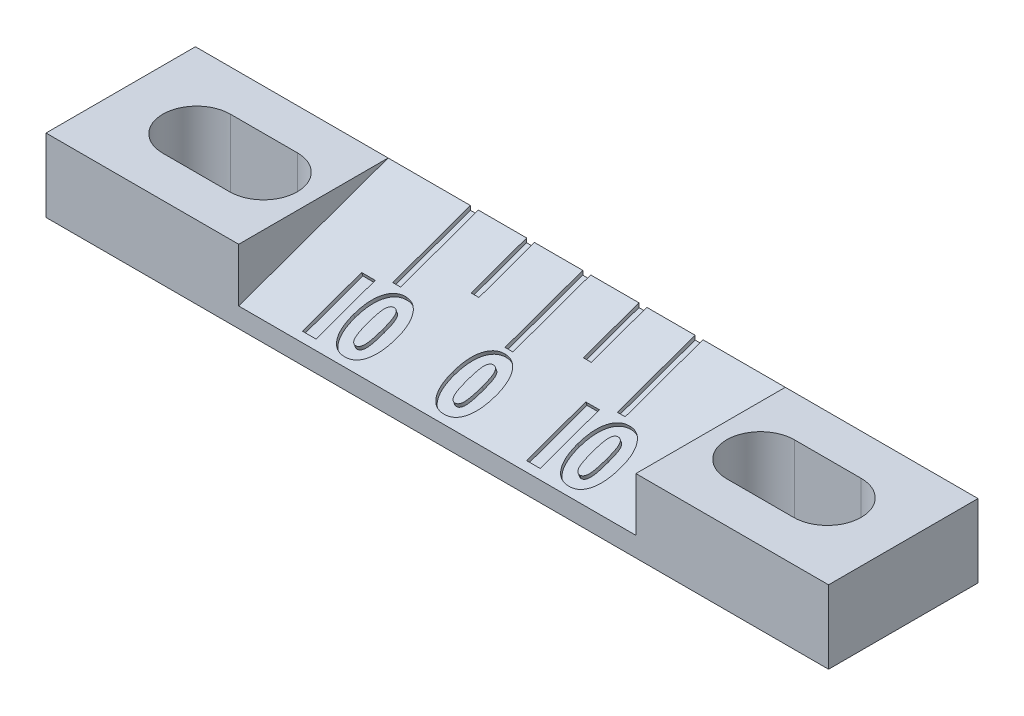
ISO-10303-21;
HEADER;
FILE_DESCRIPTION(('STEP AP214'),'2;1');
FILE_NAME('part.step','',(''),(''),'','','');
FILE_SCHEMA(('AUTOMOTIVE_DESIGN { 1 0 10303 214 1 1 1 1 }'));
ENDSEC;
DATA;
#1=APPLICATION_CONTEXT('core data for automotive mechanical design processes');
#2=APPLICATION_PROTOCOL_DEFINITION('international standard','automotive_design',2000,#1);
#3=PRODUCT_CONTEXT('',#1,'mechanical');
#4=PRODUCT('Part','Part','',(#3));
#5=PRODUCT_RELATED_PRODUCT_CATEGORY('part','',(#4));
#6=PRODUCT_DEFINITION_FORMATION('','',#4);
#7=PRODUCT_DEFINITION_CONTEXT('part definition',#1,'design');
#8=PRODUCT_DEFINITION('design','',#6,#7);
#9=PRODUCT_DEFINITION_SHAPE('','',#8);
#10=(LENGTH_UNIT() NAMED_UNIT(*) SI_UNIT(.MILLI.,.METRE.));
#11=(NAMED_UNIT(*) PLANE_ANGLE_UNIT() SI_UNIT($,.RADIAN.));
#12=(NAMED_UNIT(*) SI_UNIT($,.STERADIAN.) SOLID_ANGLE_UNIT());
#13=UNCERTAINTY_MEASURE_WITH_UNIT(LENGTH_MEASURE(1.E-05),#10,'distance_accuracy_value','');
#14=(GEOMETRIC_REPRESENTATION_CONTEXT(3) GLOBAL_UNCERTAINTY_ASSIGNED_CONTEXT((#13)) GLOBAL_UNIT_ASSIGNED_CONTEXT((#10,
#11,#12)) REPRESENTATION_CONTEXT('',''));
#15=CARTESIAN_POINT('',(0.,0.,0.));
#16=DIRECTION('',(0.,0.,1.));
#17=DIRECTION('',(1.,0.,0.));
#18=AXIS2_PLACEMENT_3D('',#15,#16,#17);
#19=CARTESIAN_POINT('',(19.05,0.635,2.413));
#20=DIRECTION('',(0.,-0.941517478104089,-0.336964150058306));
#21=DIRECTION('',(0.,0.336964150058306,-0.941517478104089));
#22=AXIS2_PLACEMENT_3D('',#19,#20,#21);
#23=PLANE('',#22);
#24=DIRECTION('',(1.,0.,0.));
#25=VECTOR('',#24,1.);
#26=CARTESIAN_POINT('',(15.2792897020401,1.40530004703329,0.260691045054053));
#27=LINE('',#26,#25);
#28=CARTESIAN_POINT('',(15.2792897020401,1.40530004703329,0.260691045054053));
#29=VERTEX_POINT('',#28);
#30=CARTESIAN_POINT('',(15.7186410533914,1.40530004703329,0.260691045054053));
#31=VERTEX_POINT('',#30);
#32=EDGE_CURVE('E658',#29,#31,#27,.T.);
#33=ORIENTED_EDGE('',*,*,#32,.T.);
#34=DIRECTION('',(0.,-0.336964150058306,0.941517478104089));
#35=VECTOR('',#34,1.);
#36=CARTESIAN_POINT('',(15.7186410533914,1.40530004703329,0.260691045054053));
#37=LINE('',#36,#35);
#38=CARTESIAN_POINT('',(15.7186410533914,0.72058889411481,2.17385456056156));
#39=VERTEX_POINT('',#38);
#40=EDGE_CURVE('E672',#31,#39,#37,.T.);
#41=ORIENTED_EDGE('',*,*,#40,.T.);
#42=DIRECTION('',(-1.,0.,0.));
#43=VECTOR('',#42,1.);
#44=CARTESIAN_POINT('',(15.7186410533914,0.72058889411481,2.17385456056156));
#45=LINE('',#44,#43);
#46=CARTESIAN_POINT('',(15.2792897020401,0.72058889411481,2.17385456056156));
#47=VERTEX_POINT('',#46);
#48=EDGE_CURVE('E675',#39,#47,#45,.T.);
#49=ORIENTED_EDGE('',*,*,#48,.T.);
#50=DIRECTION('',(0.,0.336964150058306,-0.941517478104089));
#51=VECTOR('',#50,1.);
#52=CARTESIAN_POINT('',(15.2792897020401,0.72058889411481,2.17385456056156));
#53=LINE('',#52,#51);
#54=EDGE_CURVE('E663',#47,#29,#53,.T.);
#55=ORIENTED_EDGE('',*,*,#54,.T.);
#56=EDGE_LOOP('',(#33,#41,#49,#55));
#57=FACE_BOUND('',#56,.T.);
#58=CARTESIAN_POINT('',(8.73844645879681,1.06265531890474,1.21808072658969));
#59=CARTESIAN_POINT('',(8.73903529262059,1.07615407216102,1.18036362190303));
#60=CARTESIAN_POINT('',(8.74018282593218,1.10246076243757,1.10685963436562));
#61=CARTESIAN_POINT('',(8.74870843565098,1.14074832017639,0.999879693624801));
#62=CARTESIAN_POINT('',(8.76315775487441,1.17677870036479,0.899206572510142));
#63=CARTESIAN_POINT('',(8.78360553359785,1.21045426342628,0.805113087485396));
#64=CARTESIAN_POINT('',(8.80973465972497,1.24182936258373,0.717447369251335));
#65=CARTESIAN_POINT('',(8.84134143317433,1.27089905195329,0.636223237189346));
#66=CARTESIAN_POINT('',(8.87909957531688,1.2976555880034,0.561462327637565));
#67=CARTESIAN_POINT('',(8.92286059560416,1.32192364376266,0.493654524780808));
#68=CARTESIAN_POINT('',(8.97118112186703,1.34370454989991,0.432796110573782));
#69=CARTESIAN_POINT('',(9.02417901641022,1.36267846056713,0.379780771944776));
#70=CARTESIAN_POINT('',(9.08156088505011,1.37869542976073,0.33502747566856));
#71=CARTESIAN_POINT('',(9.14301573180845,1.39188779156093,0.298166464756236));
#72=CARTESIAN_POINT('',(9.20873004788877,1.40206166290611,0.269739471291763));
#73=CARTESIAN_POINT('',(9.27852556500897,1.40931754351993,0.249465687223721));
#74=CARTESIAN_POINT('',(9.35249460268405,1.41377106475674,0.237022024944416));
#75=CARTESIAN_POINT('',(9.4032815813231,1.41428856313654,0.235576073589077));
#76=CARTESIAN_POINT('',(9.42922348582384,1.4145529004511,0.234837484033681));
#77=B_SPLINE_CURVE_WITH_KNOTS('',3,(#58,#59,#60,#61,#62,#63,#64,#65,#66,#67,#68,#69,#70,#71,#72,
#73,#74,#75,#76),.UNSPECIFIED.,.F.,.F.,(4,1,1,1,1,1,1,1,1,1,1,1,1,1,1,1,4),(0.,
0.0856392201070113,0.166895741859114,0.243433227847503,0.316171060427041,0.384798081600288,
0.450001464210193,0.512364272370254,0.572458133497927,0.629879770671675,0.684600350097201,
0.737372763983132,0.78877663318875,0.839943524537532,0.891489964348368,0.944573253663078,1.),.UNSPECIFIED.);
#78=CARTESIAN_POINT('',(8.73844645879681,1.06265531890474,1.21808072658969));
#79=VERTEX_POINT('',#78);
#80=CARTESIAN_POINT('',(9.42922348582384,1.4145529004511,0.234837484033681));
#81=VERTEX_POINT('',#80);
#82=EDGE_CURVE('E831',#79,#81,#77,.T.);
#83=ORIENTED_EDGE('',*,*,#82,.T.);
#84=CARTESIAN_POINT('',(9.42922348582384,1.4145529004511,0.234837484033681));
#85=CARTESIAN_POINT('',(9.45531668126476,1.41430478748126,0.235530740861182));
#86=CARTESIAN_POINT('',(9.50642895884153,1.41381877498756,0.236888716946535));
#87=CARTESIAN_POINT('',(9.58059163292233,1.40914113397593,0.249958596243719));
#88=CARTESIAN_POINT('',(9.6506627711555,1.40194512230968,0.270065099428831));
#89=CARTESIAN_POINT('',(9.71633716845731,1.39163144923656,0.298882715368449));
#90=CARTESIAN_POINT('',(9.77712721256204,1.37816915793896,0.336497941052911));
#91=CARTESIAN_POINT('',(9.83357267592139,1.36188093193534,0.382009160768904));
#92=CARTESIAN_POINT('',(9.88560109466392,1.34271060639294,0.435573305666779));
#93=CARTESIAN_POINT('',(9.93244354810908,1.32061149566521,0.497320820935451));
#94=CARTESIAN_POINT('',(9.97505759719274,1.29623214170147,0.565439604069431));
#95=CARTESIAN_POINT('',(10.0111552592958,1.26944816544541,0.640277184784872));
#96=CARTESIAN_POINT('',(10.0428137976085,1.2407477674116,0.720469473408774));
#97=CARTESIAN_POINT('',(10.0678338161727,1.20980725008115,0.806920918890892));
#98=CARTESIAN_POINT('',(10.0874335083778,1.17681014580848,0.899118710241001));
#99=CARTESIAN_POINT('',(10.1015623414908,1.14175832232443,0.997057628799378));
#100=CARTESIAN_POINT('',(10.1095718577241,1.10462495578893,1.10081262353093));
#101=CARTESIAN_POINT('',(10.1107924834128,1.07918951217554,1.17188224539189));
#102=CARTESIAN_POINT('',(10.1114194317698,1.06612513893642,1.20838564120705));
#103=B_SPLINE_CURVE_WITH_KNOTS('',3,(#84,#85,#86,#87,#88,#89,#90,#91,#92,#93,#94,#95,#96,#97,
#98,#99,#100,#101,#102),.UNSPECIFIED.,.F.,.F.,(4,1,1,1,1,1,1,1,1,1,1,1,1,1,1,1,4),(0.,
0.0563512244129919,0.11038277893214,0.162501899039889,0.214367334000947,0.266416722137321,
0.319264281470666,0.374623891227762,0.432629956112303,0.493181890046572,0.555842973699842,
0.621083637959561,0.689413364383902,0.761321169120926,0.836829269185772,0.916190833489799,1.),.UNSPECIFIED.);
#104=CARTESIAN_POINT('',(10.1114194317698,1.06612513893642,1.20838564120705));
#105=VERTEX_POINT('',#104);
#106=EDGE_CURVE('E839',#81,#105,#103,.T.);
#107=ORIENTED_EDGE('',*,*,#106,.T.);
#108=CARTESIAN_POINT('',(10.1114194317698,1.06612513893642,1.20838564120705));
#109=CARTESIAN_POINT('',(10.1110288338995,1.05257744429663,1.24623949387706));
#110=CARTESIAN_POINT('',(10.1102675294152,1.02617197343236,1.32001948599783));
#111=CARTESIAN_POINT('',(10.1013875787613,0.987761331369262,1.42734333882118));
#112=CARTESIAN_POINT('',(10.0877650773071,0.951613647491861,1.52834422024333));
#113=CARTESIAN_POINT('',(10.0693514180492,0.917702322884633,1.62309645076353));
#114=CARTESIAN_POINT('',(10.0442898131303,0.886133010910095,1.71130482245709));
#115=CARTESIAN_POINT('',(10.0144911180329,0.856785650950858,1.79330479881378));
#116=CARTESIAN_POINT('',(9.97890300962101,0.829751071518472,1.86884259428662));
#117=CARTESIAN_POINT('',(9.93769861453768,0.805188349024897,1.93747373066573));
#118=CARTESIAN_POINT('',(9.89221701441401,0.78300540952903,1.99945547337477));
#119=CARTESIAN_POINT('',(9.84051915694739,0.764001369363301,2.05255499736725));
#120=CARTESIAN_POINT('',(9.78510971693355,0.7474937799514,2.09867914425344));
#121=CARTESIAN_POINT('',(9.72396618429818,0.734340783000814,2.13543016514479));
#122=CARTESIAN_POINT('',(9.65863500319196,0.723866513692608,2.16469650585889));
#123=CARTESIAN_POINT('',(9.58815422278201,0.716742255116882,2.18460252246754));
#124=CARTESIAN_POINT('',(9.5132909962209,0.712069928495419,2.19765755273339));
#125=CARTESIAN_POINT('',(9.46160989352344,0.711584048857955,2.19901515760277));
#126=CARTESIAN_POINT('',(9.4352302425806,0.711336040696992,2.19970812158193));
#127=B_SPLINE_CURVE_WITH_KNOTS('',3,(#108,#109,#110,#111,#112,#113,#114,#115,#116,#117,#118,
#119,#120,#121,#122,#123,#124,#125,#126),.UNSPECIFIED.,.F.,.F.,(4,1,1,1,1,1,1,1,1,1,1,1,1,1,1,1,
4),(0.,0.0858428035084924,0.167314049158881,0.24398926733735,0.316710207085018,
0.385608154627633,0.450902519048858,0.513110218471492,0.572738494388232,0.629511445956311,
0.683564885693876,0.735741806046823,0.786996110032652,0.837958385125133,0.889739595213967,
0.943719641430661,1.),.UNSPECIFIED.);
#128=CARTESIAN_POINT('',(9.4352302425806,0.711336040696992,2.19970812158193));
#129=VERTEX_POINT('',#128);
#130=EDGE_CURVE('E848',#105,#129,#127,.T.);
#131=ORIENTED_EDGE('',*,*,#130,.T.);
#132=CARTESIAN_POINT('',(9.4352302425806,0.711336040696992,2.19970812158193));
#133=CARTESIAN_POINT('',(9.40843749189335,0.711607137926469,2.19895064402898));
#134=CARTESIAN_POINT('',(9.35595977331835,0.712138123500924,2.19746700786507));
#135=CARTESIAN_POINT('',(9.27959216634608,0.71648790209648,2.18531321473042));
#136=CARTESIAN_POINT('',(9.20810221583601,0.723987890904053,2.16435736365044));
#137=CARTESIAN_POINT('',(9.14081400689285,0.734125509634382,2.13603166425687));
#138=CARTESIAN_POINT('',(9.07829467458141,0.747364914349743,2.09903920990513));
#139=CARTESIAN_POINT('',(9.02077457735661,0.763665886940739,2.05349237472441));
#140=CARTESIAN_POINT('',(8.96774974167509,0.782729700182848,2.0002258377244));
#141=CARTESIAN_POINT('',(8.91979498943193,0.804661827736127,1.93894489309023));
#142=CARTESIAN_POINT('',(8.87714196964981,0.829125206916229,1.87059133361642));
#143=CARTESIAN_POINT('',(8.83958117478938,0.855855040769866,1.79590503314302));
#144=CARTESIAN_POINT('',(8.8084537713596,0.884935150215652,1.71465178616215));
#145=CARTESIAN_POINT('',(8.78287857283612,0.916219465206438,1.62723972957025));
#146=CARTESIAN_POINT('',(8.76268463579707,0.949689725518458,1.53371988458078));
#147=CARTESIAN_POINT('',(8.7488647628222,0.985393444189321,1.4339594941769));
#148=CARTESIAN_POINT('',(8.74014060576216,1.02328134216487,1.32809624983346));
#149=CARTESIAN_POINT('',(8.73902107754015,1.04930050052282,1.25539566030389));
#150=CARTESIAN_POINT('',(8.73844645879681,1.06265531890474,1.21808072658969));
#151=B_SPLINE_CURVE_WITH_KNOTS('',3,(#132,#133,#134,#135,#136,#137,#138,#139,#140,#141,#142,
#143,#144,#145,#146,#147,#148,#149,#150),.UNSPECIFIED.,.F.,.F.,(4,1,1,1,1,1,1,1,1,1,1,1,1,1,1,1,
4),(0.,0.0570508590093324,0.111742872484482,0.16435647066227,0.216169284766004,
0.268322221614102,0.321097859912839,0.375841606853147,0.433116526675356,0.492940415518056,
0.554946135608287,0.619807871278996,0.68810374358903,0.759919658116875,0.835534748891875,
0.915585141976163,1.),.UNSPECIFIED.);
#152=EDGE_CURVE('E856',#129,#79,#151,.T.);
#153=ORIENTED_EDGE('',*,*,#152,.T.);
#154=EDGE_LOOP('',(#83,#107,#131,#153));
#155=FACE_BOUND('',#154,.T.);
#156=DIRECTION('',(-1.,0.,0.));
#157=VECTOR('',#156,1.);
#158=CARTESIAN_POINT('',(19.05,2.3622,-2.413));
#159=LINE('',#158,#157);
#160=CARTESIAN_POINT('',(19.05,2.3622,-2.413));
#161=VERTEX_POINT('',#160);
#162=CARTESIAN_POINT('',(16.39062,2.3622,-2.413));
#163=VERTEX_POINT('',#162);
#164=EDGE_CURVE('E925',#161,#163,#159,.T.);
#165=ORIENTED_EDGE('',*,*,#164,.T.);
#166=DIRECTION('',(0.,0.336964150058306,-0.941517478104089));
#167=VECTOR('',#166,1.);
#168=CARTESIAN_POINT('',(16.39062,1.4635166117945,0.0980271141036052));
#169=LINE('',#168,#167);
#170=CARTESIAN_POINT('',(16.39062,1.4635166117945,0.0980271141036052));
#171=VERTEX_POINT('',#170);
#172=EDGE_CURVE('E480',#171,#163,#169,.T.);
#173=ORIENTED_EDGE('',*,*,#172,.F.);
#174=DIRECTION('',(1.,0.,0.));
#175=VECTOR('',#174,1.);
#176=CARTESIAN_POINT('',(16.39062,1.4635166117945,0.0980271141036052));
#177=LINE('',#176,#175);
#178=CARTESIAN_POINT('',(16.13662,1.4635166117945,0.0980271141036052));
#179=VERTEX_POINT('',#178);
#180=EDGE_CURVE('E483',#179,#171,#177,.T.);
#181=ORIENTED_EDGE('',*,*,#180,.F.);
#182=DIRECTION('',(0.,-0.336964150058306,0.941517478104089));
#183=VECTOR('',#182,1.);
#184=CARTESIAN_POINT('',(16.13662,1.4635166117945,0.0980271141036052));
#185=LINE('',#184,#183);
#186=CARTESIAN_POINT('',(16.13662,2.3622,-2.413));
#187=VERTEX_POINT('',#186);
#188=EDGE_CURVE('E470',#187,#179,#185,.T.);
#189=ORIENTED_EDGE('',*,*,#188,.F.);
#190=CARTESIAN_POINT('',(14.57706,2.3622,-2.413));
#191=VERTEX_POINT('',#190);
#192=EDGE_CURVE('E929',#187,#191,#159,.T.);
#193=ORIENTED_EDGE('',*,*,#192,.T.);
#194=DIRECTION('',(0.,0.336964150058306,-0.941517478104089));
#195=VECTOR('',#194,1.);
#196=CARTESIAN_POINT('',(14.57706,1.72028329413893,-0.61940920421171));
#197=LINE('',#196,#195);
#198=CARTESIAN_POINT('',(14.57706,1.72028329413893,-0.61940920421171));
#199=VERTEX_POINT('',#198);
#200=EDGE_CURVE('E485',#199,#191,#197,.T.);
#201=ORIENTED_EDGE('',*,*,#200,.F.);
#202=DIRECTION('',(1.,0.,0.));
#203=VECTOR('',#202,1.);
#204=CARTESIAN_POINT('',(14.57706,1.72028329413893,-0.61940920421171));
#205=LINE('',#204,#203);
#206=CARTESIAN_POINT('',(14.32306,1.72028329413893,-0.61940920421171));
#207=VERTEX_POINT('',#206);
#208=EDGE_CURVE('E489',#207,#199,#205,.T.);
#209=ORIENTED_EDGE('',*,*,#208,.F.);
#210=DIRECTION('',(0.,-0.336964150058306,0.941517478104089));
#211=VECTOR('',#210,1.);
#212=CARTESIAN_POINT('',(14.32306,1.72028329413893,-0.61940920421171));
#213=LINE('',#212,#211);
#214=CARTESIAN_POINT('',(14.32306,2.3622,-2.413));
#215=VERTEX_POINT('',#214);
#216=EDGE_CURVE('E496',#215,#207,#213,.T.);
#217=ORIENTED_EDGE('',*,*,#216,.F.);
#218=CARTESIAN_POINT('',(12.7635,2.3622,-2.413));
#219=VERTEX_POINT('',#218);
#220=EDGE_CURVE('E2041',#215,#219,#159,.T.);
#221=ORIENTED_EDGE('',*,*,#220,.T.);
#222=DIRECTION('',(0.,0.336964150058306,-0.941517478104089));
#223=VECTOR('',#222,1.);
#224=CARTESIAN_POINT('',(12.7635,2.3622,-2.413));
#225=LINE('',#224,#223);
#226=CARTESIAN_POINT('',(12.7635,1.4635166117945,0.0980271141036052));
#227=VERTEX_POINT('',#226);
#228=EDGE_CURVE('E508',#227,#219,#225,.T.);
#229=ORIENTED_EDGE('',*,*,#228,.F.);
#230=DIRECTION('',(1.,0.,0.));
#231=VECTOR('',#230,1.);
#232=CARTESIAN_POINT('',(12.5095,1.4635166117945,0.0980271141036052));
#233=LINE('',#232,#231);
#234=CARTESIAN_POINT('',(12.5095,1.4635166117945,0.0980271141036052));
#235=VERTEX_POINT('',#234);
#236=EDGE_CURVE('E516',#235,#227,#233,.T.);
#237=ORIENTED_EDGE('',*,*,#236,.F.);
#238=DIRECTION('',(0.,-0.336964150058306,0.941517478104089));
#239=VECTOR('',#238,1.);
#240=CARTESIAN_POINT('',(12.5095,2.3622,-2.413));
#241=LINE('',#240,#239);
#242=CARTESIAN_POINT('',(12.5095,2.3622,-2.413));
#243=VERTEX_POINT('',#242);
#244=EDGE_CURVE('E503',#243,#235,#241,.T.);
#245=ORIENTED_EDGE('',*,*,#244,.F.);
#246=CARTESIAN_POINT('',(10.94994,2.3622,-2.413));
#247=VERTEX_POINT('',#246);
#248=EDGE_CURVE('E2044',#243,#247,#159,.T.);
#249=ORIENTED_EDGE('',*,*,#248,.T.);
#250=DIRECTION('',(0.,0.336964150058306,-0.941517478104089));
#251=VECTOR('',#250,1.);
#252=CARTESIAN_POINT('',(10.94994,2.3622,-2.413));
#253=LINE('',#252,#251);
#254=CARTESIAN_POINT('',(10.94994,1.72028329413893,-0.619409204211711));
#255=VERTEX_POINT('',#254);
#256=EDGE_CURVE('E528',#255,#247,#253,.T.);
#257=ORIENTED_EDGE('',*,*,#256,.F.);
#258=DIRECTION('',(1.,0.,0.));
#259=VECTOR('',#258,1.);
#260=CARTESIAN_POINT('',(10.69594,1.72028329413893,-0.61940920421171));
#261=LINE('',#260,#259);
#262=CARTESIAN_POINT('',(10.69594,1.72028329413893,-0.61940920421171));
#263=VERTEX_POINT('',#262);
#264=EDGE_CURVE('E536',#263,#255,#261,.T.);
#265=ORIENTED_EDGE('',*,*,#264,.F.);
#266=DIRECTION('',(0.,-0.336964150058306,0.941517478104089));
#267=VECTOR('',#266,1.);
#268=CARTESIAN_POINT('',(10.69594,2.3622,-2.413));
#269=LINE('',#268,#267);
#270=CARTESIAN_POINT('',(10.69594,2.3622,-2.413));
#271=VERTEX_POINT('',#270);
#272=EDGE_CURVE('E523',#271,#263,#269,.T.);
#273=ORIENTED_EDGE('',*,*,#272,.F.);
#274=CARTESIAN_POINT('',(9.13638,2.3622,-2.413));
#275=VERTEX_POINT('',#274);
#276=EDGE_CURVE('E2045',#271,#275,#159,.T.);
#277=ORIENTED_EDGE('',*,*,#276,.T.);
#278=DIRECTION('',(0.,0.336964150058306,-0.941517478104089));
#279=VECTOR('',#278,1.);
#280=CARTESIAN_POINT('',(9.13638,2.3622,-2.413));
#281=LINE('',#280,#279);
#282=CARTESIAN_POINT('',(9.13638,1.4635166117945,0.0980271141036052));
#283=VERTEX_POINT('',#282);
#284=EDGE_CURVE('E548',#283,#275,#281,.T.);
#285=ORIENTED_EDGE('',*,*,#284,.F.);
#286=DIRECTION('',(1.,0.,0.));
#287=VECTOR('',#286,1.);
#288=CARTESIAN_POINT('',(8.88238,1.4635166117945,0.0980271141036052));
#289=LINE('',#288,#287);
#290=CARTESIAN_POINT('',(8.88238,1.4635166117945,0.0980271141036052));
#291=VERTEX_POINT('',#290);
#292=EDGE_CURVE('E556',#291,#283,#289,.T.);
#293=ORIENTED_EDGE('',*,*,#292,.F.);
#294=DIRECTION('',(0.,-0.336964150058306,0.941517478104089));
#295=VECTOR('',#294,1.);
#296=CARTESIAN_POINT('',(8.88238,2.3622,-2.413));
#297=LINE('',#296,#295);
#298=CARTESIAN_POINT('',(8.88238,2.3622,-2.413));
#299=VERTEX_POINT('',#298);
#300=EDGE_CURVE('E543',#299,#291,#297,.T.);
#301=ORIENTED_EDGE('',*,*,#300,.F.);
#302=CARTESIAN_POINT('',(6.223,2.3622,-2.413));
#303=VERTEX_POINT('',#302);
#304=EDGE_CURVE('E930',#299,#303,#159,.T.);
#305=ORIENTED_EDGE('',*,*,#304,.T.);
#306=DIRECTION('',(0.,-0.336964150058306,0.941517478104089));
#307=VECTOR('',#306,1.);
#308=CARTESIAN_POINT('',(6.223,0.635,2.413));
#309=LINE('',#308,#307);
#310=CARTESIAN_POINT('',(6.223,0.635,2.413));
#311=VERTEX_POINT('',#310);
#312=EDGE_CURVE('E908',#303,#311,#309,.T.);
#313=ORIENTED_EDGE('',*,*,#312,.T.);
#314=DIRECTION('',(-1.,0.,0.));
#315=VECTOR('',#314,1.);
#316=CARTESIAN_POINT('',(19.05,0.635,2.413));
#317=LINE('',#316,#315);
#318=CARTESIAN_POINT('',(19.05,0.635,2.413));
#319=VERTEX_POINT('',#318);
#320=EDGE_CURVE('E917',#319,#311,#317,.T.);
#321=ORIENTED_EDGE('',*,*,#320,.F.);
#322=DIRECTION('',(0.,-0.336964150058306,0.941517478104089));
#323=VECTOR('',#322,1.);
#324=CARTESIAN_POINT('',(19.05,0.635,2.413));
#325=LINE('',#324,#323);
#326=EDGE_CURVE('E909',#161,#319,#325,.T.);
#327=ORIENTED_EDGE('',*,*,#326,.F.);
#328=EDGE_LOOP('',(#165,#173,#181,#189,#193,#201,#209,#217,#221,#229,#237,#245,#249,#257,#265,
#273,#277,#285,#293,#301,#305,#313,#321,#327));
#329=FACE_BOUND('',#328,.T.);
#330=DIRECTION('',(1.,0.,0.));
#331=VECTOR('',#330,1.);
#332=CARTESIAN_POINT('',(8.04097618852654,1.40530004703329,0.260691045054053));
#333=LINE('',#332,#331);
#334=CARTESIAN_POINT('',(8.04097618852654,1.40530004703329,0.260691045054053));
#335=VERTEX_POINT('',#334);
#336=CARTESIAN_POINT('',(8.48032753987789,1.40530004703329,0.260691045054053));
#337=VERTEX_POINT('',#336);
#338=EDGE_CURVE('E877',#335,#337,#333,.T.);
#339=ORIENTED_EDGE('',*,*,#338,.T.);
#340=DIRECTION('',(0.,-0.336964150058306,0.941517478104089));
#341=VECTOR('',#340,1.);
#342=CARTESIAN_POINT('',(8.48032753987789,1.40530004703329,0.260691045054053));
#343=LINE('',#342,#341);
#344=CARTESIAN_POINT('',(8.48032753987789,0.72058889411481,2.17385456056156));
#345=VERTEX_POINT('',#344);
#346=EDGE_CURVE('E891',#337,#345,#343,.T.);
#347=ORIENTED_EDGE('',*,*,#346,.T.);
#348=DIRECTION('',(-1.,0.,0.));
#349=VECTOR('',#348,1.);
#350=CARTESIAN_POINT('',(8.48032753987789,0.72058889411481,2.17385456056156));
#351=LINE('',#350,#349);
#352=CARTESIAN_POINT('',(8.04097618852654,0.72058889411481,2.17385456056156));
#353=VERTEX_POINT('',#352);
#354=EDGE_CURVE('E894',#345,#353,#351,.T.);
#355=ORIENTED_EDGE('',*,*,#354,.T.);
#356=DIRECTION('',(0.,0.336964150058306,-0.941517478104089));
#357=VECTOR('',#356,1.);
#358=CARTESIAN_POINT('',(8.04097618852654,0.72058889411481,2.17385456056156));
#359=LINE('',#358,#357);
#360=EDGE_CURVE('E882',#353,#335,#359,.T.);
#361=ORIENTED_EDGE('',*,*,#360,.T.);
#362=EDGE_LOOP('',(#339,#347,#355,#361));
#363=FACE_BOUND('',#362,.T.);
#364=CARTESIAN_POINT('',(11.9457113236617,1.06265531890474,1.21808072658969));
#365=CARTESIAN_POINT('',(11.9463001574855,1.07615407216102,1.18036362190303));
#366=CARTESIAN_POINT('',(11.9474476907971,1.10246076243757,1.10685963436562));
#367=CARTESIAN_POINT('',(11.9559733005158,1.14074832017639,0.999879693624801));
#368=CARTESIAN_POINT('',(11.9704226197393,1.17677870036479,0.899206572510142));
#369=CARTESIAN_POINT('',(11.9908703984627,1.21045426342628,0.805113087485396));
#370=CARTESIAN_POINT('',(12.0169995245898,1.24182936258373,0.717447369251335));
#371=CARTESIAN_POINT('',(12.0486062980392,1.27089905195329,0.636223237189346));
#372=CARTESIAN_POINT('',(12.0863644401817,1.2976555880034,0.561462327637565));
#373=CARTESIAN_POINT('',(12.130125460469,1.32192364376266,0.493654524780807));
#374=CARTESIAN_POINT('',(12.1784459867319,1.34370454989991,0.432796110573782));
#375=CARTESIAN_POINT('',(12.2314438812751,1.36267846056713,0.379780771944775));
#376=CARTESIAN_POINT('',(12.288825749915,1.37869542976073,0.33502747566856));
#377=CARTESIAN_POINT('',(12.3502805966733,1.39188779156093,0.298166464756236));
#378=CARTESIAN_POINT('',(12.4159949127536,1.40206166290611,0.269739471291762));
#379=CARTESIAN_POINT('',(12.4857904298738,1.40931754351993,0.249465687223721));
#380=CARTESIAN_POINT('',(12.5597594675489,1.41377106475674,0.237022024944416));
#381=CARTESIAN_POINT('',(12.610546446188,1.41428856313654,0.235576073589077));
#382=CARTESIAN_POINT('',(12.6364883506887,1.4145529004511,0.234837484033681));
#383=B_SPLINE_CURVE_WITH_KNOTS('',3,(#364,#365,#366,#367,#368,#369,#370,#371,#372,#373,#374,
#375,#376,#377,#378,#379,#380,#381,#382),.UNSPECIFIED.,.F.,.F.,(4,1,1,1,1,1,1,1,1,1,1,1,1,1,1,1,
4),(0.,0.0856392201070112,0.166895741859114,0.243433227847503,0.316171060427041,
0.384798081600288,0.450001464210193,0.512364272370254,0.572458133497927,0.629879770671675,
0.684600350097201,0.737372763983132,0.78877663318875,0.839943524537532,0.891489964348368,
0.944573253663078,1.),.UNSPECIFIED.);
#384=CARTESIAN_POINT('',(11.9457113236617,1.06265531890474,1.21808072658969));
#385=VERTEX_POINT('',#384);
#386=CARTESIAN_POINT('',(12.6364883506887,1.4145529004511,0.234837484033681));
#387=VERTEX_POINT('',#386);
#388=EDGE_CURVE('E737',#385,#387,#383,.T.);
#389=ORIENTED_EDGE('',*,*,#388,.T.);
#390=CARTESIAN_POINT('',(12.6364883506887,1.4145529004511,0.234837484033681));
#391=CARTESIAN_POINT('',(12.6625815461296,1.41430478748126,0.235530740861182));
#392=CARTESIAN_POINT('',(12.7136938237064,1.41381877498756,0.236888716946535));
#393=CARTESIAN_POINT('',(12.7878564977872,1.40914113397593,0.249958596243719));
#394=CARTESIAN_POINT('',(12.8579276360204,1.40194512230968,0.270065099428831));
#395=CARTESIAN_POINT('',(12.9236020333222,1.39163144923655,0.298882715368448));
#396=CARTESIAN_POINT('',(12.9843920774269,1.37816915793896,0.336497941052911));
#397=CARTESIAN_POINT('',(13.0408375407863,1.36188093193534,0.382009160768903));
#398=CARTESIAN_POINT('',(13.0928659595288,1.34271060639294,0.435573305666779));
#399=CARTESIAN_POINT('',(13.139708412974,1.32061149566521,0.497320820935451));
#400=CARTESIAN_POINT('',(13.1823224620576,1.29623214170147,0.565439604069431));
#401=CARTESIAN_POINT('',(13.2184201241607,1.26944816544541,0.640277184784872));
#402=CARTESIAN_POINT('',(13.2500786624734,1.2407477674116,0.720469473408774));
#403=CARTESIAN_POINT('',(13.2750986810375,1.20980725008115,0.806920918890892));
#404=CARTESIAN_POINT('',(13.2946983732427,1.17681014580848,0.899118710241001));
#405=CARTESIAN_POINT('',(13.3088272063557,1.14175832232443,0.997057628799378));
#406=CARTESIAN_POINT('',(13.3168367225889,1.10462495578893,1.10081262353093));
#407=CARTESIAN_POINT('',(13.3180573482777,1.07918951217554,1.17188224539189));
#408=CARTESIAN_POINT('',(13.3186842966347,1.06612513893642,1.20838564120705));
#409=B_SPLINE_CURVE_WITH_KNOTS('',3,(#390,#391,#392,#393,#394,#395,#396,#397,#398,#399,#400,
#401,#402,#403,#404,#405,#406,#407,#408),.UNSPECIFIED.,.F.,.F.,(4,1,1,1,1,1,1,1,1,1,1,1,1,1,1,1,
4),(0.,0.0563512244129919,0.11038277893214,0.16250189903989,0.214367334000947,0.266416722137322,
0.319264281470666,0.374623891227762,0.432629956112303,0.493181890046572,0.555842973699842,
0.621083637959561,0.689413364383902,0.761321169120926,0.836829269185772,0.916190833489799,1.),.UNSPECIFIED.);
#410=CARTESIAN_POINT('',(13.3186842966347,1.06612513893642,1.20838564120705));
#411=VERTEX_POINT('',#410);
#412=EDGE_CURVE('E745',#387,#411,#409,.T.);
#413=ORIENTED_EDGE('',*,*,#412,.T.);
#414=CARTESIAN_POINT('',(13.3186842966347,1.06612513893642,1.20838564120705));
#415=CARTESIAN_POINT('',(13.3182936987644,1.05257744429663,1.24623949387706));
#416=CARTESIAN_POINT('',(13.31753239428,1.02617197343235,1.32001948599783));
#417=CARTESIAN_POINT('',(13.3086524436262,0.987761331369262,1.42734333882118));
#418=CARTESIAN_POINT('',(13.2950299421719,0.951613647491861,1.52834422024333));
#419=CARTESIAN_POINT('',(13.2766162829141,0.917702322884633,1.62309645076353));
#420=CARTESIAN_POINT('',(13.2515546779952,0.886133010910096,1.71130482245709));
#421=CARTESIAN_POINT('',(13.2217559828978,0.856785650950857,1.79330479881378));
#422=CARTESIAN_POINT('',(13.1861678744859,0.829751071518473,1.86884259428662));
#423=CARTESIAN_POINT('',(13.1449634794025,0.805188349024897,1.93747373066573));
#424=CARTESIAN_POINT('',(13.0994818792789,0.78300540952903,1.99945547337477));
#425=CARTESIAN_POINT('',(13.0477840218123,0.764001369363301,2.05255499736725));
#426=CARTESIAN_POINT('',(12.9923745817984,0.747493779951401,2.09867914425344));
#427=CARTESIAN_POINT('',(12.931231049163,0.734340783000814,2.13543016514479));
#428=CARTESIAN_POINT('',(12.8658998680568,0.723866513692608,2.16469650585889));
#429=CARTESIAN_POINT('',(12.7954190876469,0.716742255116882,2.18460252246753));
#430=CARTESIAN_POINT('',(12.7205558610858,0.71206992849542,2.19765755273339));
#431=CARTESIAN_POINT('',(12.6688747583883,0.711584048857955,2.19901515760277));
#432=CARTESIAN_POINT('',(12.6424951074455,0.711336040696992,2.19970812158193));
#433=B_SPLINE_CURVE_WITH_KNOTS('',3,(#414,#415,#416,#417,#418,#419,#420,#421,#422,#423,#424,
#425,#426,#427,#428,#429,#430,#431,#432),.UNSPECIFIED.,.F.,.F.,(4,1,1,1,1,1,1,1,1,1,1,1,1,1,1,1,
4),(0.,0.0858428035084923,0.167314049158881,0.24398926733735,0.316710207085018,
0.385608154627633,0.450902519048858,0.513110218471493,0.572738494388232,0.62951144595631,
0.683564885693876,0.735741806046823,0.786996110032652,0.837958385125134,0.889739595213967,
0.943719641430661,1.),.UNSPECIFIED.);
#434=CARTESIAN_POINT('',(12.6424951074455,0.711336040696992,2.19970812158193));
#435=VERTEX_POINT('',#434);
#436=EDGE_CURVE('E754',#411,#435,#433,.T.);
#437=ORIENTED_EDGE('',*,*,#436,.T.);
#438=CARTESIAN_POINT('',(12.6424951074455,0.711336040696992,2.19970812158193));
#439=CARTESIAN_POINT('',(12.6157023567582,0.711607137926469,2.19895064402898));
#440=CARTESIAN_POINT('',(12.5632246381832,0.712138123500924,2.19746700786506));
#441=CARTESIAN_POINT('',(12.486857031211,0.716487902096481,2.18531321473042));
#442=CARTESIAN_POINT('',(12.4153670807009,0.723987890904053,2.16435736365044));
#443=CARTESIAN_POINT('',(12.3480788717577,0.734125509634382,2.13603166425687));
#444=CARTESIAN_POINT('',(12.2855595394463,0.747364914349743,2.09903920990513));
#445=CARTESIAN_POINT('',(12.2280394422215,0.763665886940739,2.05349237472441));
#446=CARTESIAN_POINT('',(12.17501460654,0.782729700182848,2.0002258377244));
#447=CARTESIAN_POINT('',(12.1270598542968,0.804661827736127,1.93894489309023));
#448=CARTESIAN_POINT('',(12.0844068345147,0.829125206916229,1.87059133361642));
#449=CARTESIAN_POINT('',(12.0468460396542,0.855855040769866,1.79590503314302));
#450=CARTESIAN_POINT('',(12.0157186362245,0.884935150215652,1.71465178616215));
#451=CARTESIAN_POINT('',(11.990143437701,0.916219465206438,1.62723972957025));
#452=CARTESIAN_POINT('',(11.9699495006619,0.949689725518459,1.53371988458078));
#453=CARTESIAN_POINT('',(11.9561296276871,0.985393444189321,1.4339594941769));
#454=CARTESIAN_POINT('',(11.947405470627,1.02328134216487,1.32809624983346));
#455=CARTESIAN_POINT('',(11.946285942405,1.04930050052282,1.25539566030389));
#456=CARTESIAN_POINT('',(11.9457113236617,1.06265531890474,1.21808072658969));
#457=B_SPLINE_CURVE_WITH_KNOTS('',3,(#438,#439,#440,#441,#442,#443,#444,#445,#446,#447,#448,
#449,#450,#451,#452,#453,#454,#455,#456),.UNSPECIFIED.,.F.,.F.,(4,1,1,1,1,1,1,1,1,1,1,1,1,1,1,1,
4),(0.,0.0570508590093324,0.111742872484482,0.16435647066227,0.216169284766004,
0.268322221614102,0.321097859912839,0.375841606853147,0.433116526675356,0.492940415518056,
0.554946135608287,0.619807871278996,0.68810374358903,0.759919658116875,0.835534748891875,
0.915585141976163,1.),.UNSPECIFIED.);
#458=EDGE_CURVE('E762',#435,#385,#457,.T.);
#459=ORIENTED_EDGE('',*,*,#458,.T.);
#460=EDGE_LOOP('',(#389,#413,#437,#459));
#461=FACE_BOUND('',#460,.T.);
#462=CARTESIAN_POINT('',(15.9767599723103,1.06265531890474,1.21808072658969));
#463=CARTESIAN_POINT('',(15.9773488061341,1.07615407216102,1.18036362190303));
#464=CARTESIAN_POINT('',(15.9784963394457,1.10246076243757,1.10685963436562));
#465=CARTESIAN_POINT('',(15.9870219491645,1.14074832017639,0.999879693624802));
#466=CARTESIAN_POINT('',(16.0014712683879,1.17677870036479,0.899206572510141));
#467=CARTESIAN_POINT('',(16.0219190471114,1.21045426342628,0.805113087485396));
#468=CARTESIAN_POINT('',(16.0480481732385,1.24182936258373,0.717447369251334));
#469=CARTESIAN_POINT('',(16.0796549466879,1.27089905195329,0.636223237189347));
#470=CARTESIAN_POINT('',(16.1174130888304,1.2976555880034,0.561462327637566));
#471=CARTESIAN_POINT('',(16.1611741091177,1.32192364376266,0.493654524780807));
#472=CARTESIAN_POINT('',(16.2094946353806,1.34370454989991,0.432796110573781));
#473=CARTESIAN_POINT('',(16.2624925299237,1.36267846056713,0.379780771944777));
#474=CARTESIAN_POINT('',(16.3198743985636,1.37869542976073,0.33502747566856));
#475=CARTESIAN_POINT('',(16.381329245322,1.39188779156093,0.298166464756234));
#476=CARTESIAN_POINT('',(16.4470435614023,1.40206166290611,0.269739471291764));
#477=CARTESIAN_POINT('',(16.5168390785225,1.40931754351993,0.249465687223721));
#478=CARTESIAN_POINT('',(16.5908081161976,1.41377106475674,0.237022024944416));
#479=CARTESIAN_POINT('',(16.6415950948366,1.41428856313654,0.235576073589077));
#480=CARTESIAN_POINT('',(16.6675369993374,1.4145529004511,0.234837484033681));
#481=B_SPLINE_CURVE_WITH_KNOTS('',3,(#462,#463,#464,#465,#466,#467,#468,#469,#470,#471,#472,
#473,#474,#475,#476,#477,#478,#479,#480),.UNSPECIFIED.,.F.,.F.,(4,1,1,1,1,1,1,1,1,1,1,1,1,1,1,1,
4),(0.,0.0856392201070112,0.166895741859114,0.243433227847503,0.316171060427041,
0.384798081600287,0.450001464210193,0.512364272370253,0.572458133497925,0.629879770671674,
0.684600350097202,0.737372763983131,0.788776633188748,0.839943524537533,0.891489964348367,
0.944573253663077,1.),.UNSPECIFIED.);
#482=CARTESIAN_POINT('',(15.9767599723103,1.06265531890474,1.21808072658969));
#483=VERTEX_POINT('',#482);
#484=CARTESIAN_POINT('',(16.6675369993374,1.4145529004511,0.234837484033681));
#485=VERTEX_POINT('',#484);
#486=EDGE_CURVE('E612',#483,#485,#481,.T.);
#487=ORIENTED_EDGE('',*,*,#486,.T.);
#488=CARTESIAN_POINT('',(16.6675369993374,1.4145529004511,0.234837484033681));
#489=CARTESIAN_POINT('',(16.6936301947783,1.41430478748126,0.235530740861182));
#490=CARTESIAN_POINT('',(16.7447424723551,1.41381877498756,0.236888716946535));
#491=CARTESIAN_POINT('',(16.8189051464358,1.40914113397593,0.249958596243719));
#492=CARTESIAN_POINT('',(16.888976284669,1.40194512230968,0.270065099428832));
#493=CARTESIAN_POINT('',(16.9546506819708,1.39163144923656,0.298882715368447));
#494=CARTESIAN_POINT('',(17.0154407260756,1.37816915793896,0.336497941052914));
#495=CARTESIAN_POINT('',(17.0718861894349,1.36188093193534,0.382009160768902));
#496=CARTESIAN_POINT('',(17.1239146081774,1.34271060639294,0.43557330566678));
#497=CARTESIAN_POINT('',(17.1707570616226,1.32061149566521,0.497320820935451));
#498=CARTESIAN_POINT('',(17.2133711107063,1.29623214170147,0.565439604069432));
#499=CARTESIAN_POINT('',(17.2494687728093,1.26944816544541,0.640277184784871));
#500=CARTESIAN_POINT('',(17.281127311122,1.2407477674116,0.720469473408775));
#501=CARTESIAN_POINT('',(17.3061473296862,1.20980725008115,0.806920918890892));
#502=CARTESIAN_POINT('',(17.3257470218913,1.17681014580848,0.899118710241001));
#503=CARTESIAN_POINT('',(17.3398758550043,1.14175832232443,0.997057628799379));
#504=CARTESIAN_POINT('',(17.3478853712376,1.10462495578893,1.10081262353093));
#505=CARTESIAN_POINT('',(17.3491059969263,1.07918951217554,1.17188224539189));
#506=CARTESIAN_POINT('',(17.3497329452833,1.06612513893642,1.20838564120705));
#507=B_SPLINE_CURVE_WITH_KNOTS('',3,(#488,#489,#490,#491,#492,#493,#494,#495,#496,#497,#498,
#499,#500,#501,#502,#503,#504,#505,#506),.UNSPECIFIED.,.F.,.F.,(4,1,1,1,1,1,1,1,1,1,1,1,1,1,1,1,
4),(0.,0.0563512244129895,0.110382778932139,0.162501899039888,0.214367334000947,
0.26641672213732,0.319264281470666,0.374623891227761,0.432629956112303,0.493181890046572,
0.555842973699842,0.62108363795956,0.689413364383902,0.761321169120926,0.836829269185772,
0.916190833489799,1.),.UNSPECIFIED.);
#508=CARTESIAN_POINT('',(17.3497329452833,1.06612513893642,1.20838564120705));
#509=VERTEX_POINT('',#508);
#510=EDGE_CURVE('E620',#485,#509,#507,.T.);
#511=ORIENTED_EDGE('',*,*,#510,.T.);
#512=CARTESIAN_POINT('',(17.3497329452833,1.06612513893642,1.20838564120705));
#513=CARTESIAN_POINT('',(17.3493423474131,1.05257744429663,1.24623949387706));
#514=CARTESIAN_POINT('',(17.3485810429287,1.02617197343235,1.32001948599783));
#515=CARTESIAN_POINT('',(17.3397010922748,0.987761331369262,1.42734333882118));
#516=CARTESIAN_POINT('',(17.3260785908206,0.951613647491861,1.52834422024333));
#517=CARTESIAN_POINT('',(17.3076649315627,0.917702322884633,1.62309645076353));
#518=CARTESIAN_POINT('',(17.2826033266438,0.886133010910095,1.71130482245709));
#519=CARTESIAN_POINT('',(17.2528046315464,0.856785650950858,1.79330479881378));
#520=CARTESIAN_POINT('',(17.2172165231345,0.829751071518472,1.86884259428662));
#521=CARTESIAN_POINT('',(17.1760121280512,0.805188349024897,1.93747373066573));
#522=CARTESIAN_POINT('',(17.1305305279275,0.78300540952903,1.99945547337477));
#523=CARTESIAN_POINT('',(17.0788326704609,0.7640013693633,2.05255499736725));
#524=CARTESIAN_POINT('',(17.0234232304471,0.7474937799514,2.09867914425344));
#525=CARTESIAN_POINT('',(16.9622796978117,0.734340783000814,2.13543016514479));
#526=CARTESIAN_POINT('',(16.8969485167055,0.723866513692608,2.16469650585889));
#527=CARTESIAN_POINT('',(16.8264677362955,0.716742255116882,2.18460252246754));
#528=CARTESIAN_POINT('',(16.7516045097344,0.712069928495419,2.19765755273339));
#529=CARTESIAN_POINT('',(16.699923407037,0.711584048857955,2.19901515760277));
#530=CARTESIAN_POINT('',(16.6735437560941,0.711336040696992,2.19970812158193));
#531=B_SPLINE_CURVE_WITH_KNOTS('',3,(#512,#513,#514,#515,#516,#517,#518,#519,#520,#521,#522,
#523,#524,#525,#526,#527,#528,#529,#530),.UNSPECIFIED.,.F.,.F.,(4,1,1,1,1,1,1,1,1,1,1,1,1,1,1,1,
4),(0.,0.0858428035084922,0.167314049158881,0.24398926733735,0.316710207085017,
0.385608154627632,0.450902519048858,0.513110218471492,0.572738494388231,0.62951144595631,
0.683564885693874,0.735741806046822,0.786996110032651,0.837958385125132,0.889739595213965,
0.94371964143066,1.),.UNSPECIFIED.);
#532=CARTESIAN_POINT('',(16.6735437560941,0.711336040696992,2.19970812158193));
#533=VERTEX_POINT('',#532);
#534=EDGE_CURVE('E629',#509,#533,#531,.T.);
#535=ORIENTED_EDGE('',*,*,#534,.T.);
#536=CARTESIAN_POINT('',(16.6735437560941,0.711336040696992,2.19970812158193));
#537=CARTESIAN_POINT('',(16.6467510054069,0.711607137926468,2.19895064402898));
#538=CARTESIAN_POINT('',(16.5942732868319,0.712138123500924,2.19746700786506));
#539=CARTESIAN_POINT('',(16.5179056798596,0.716487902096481,2.18531321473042));
#540=CARTESIAN_POINT('',(16.4464157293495,0.723987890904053,2.16435736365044));
#541=CARTESIAN_POINT('',(16.3791275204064,0.734125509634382,2.13603166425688));
#542=CARTESIAN_POINT('',(16.3166081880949,0.747364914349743,2.09903920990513));
#543=CARTESIAN_POINT('',(16.2590880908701,0.763665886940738,2.05349237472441));
#544=CARTESIAN_POINT('',(16.2060632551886,0.782729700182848,2.0002258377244));
#545=CARTESIAN_POINT('',(16.1581085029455,0.804661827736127,1.93894489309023));
#546=CARTESIAN_POINT('',(16.1154554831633,0.829125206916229,1.87059133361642));
#547=CARTESIAN_POINT('',(16.0778946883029,0.855855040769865,1.79590503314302));
#548=CARTESIAN_POINT('',(16.0467672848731,0.884935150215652,1.71465178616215));
#549=CARTESIAN_POINT('',(16.0211920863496,0.916219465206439,1.62723972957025));
#550=CARTESIAN_POINT('',(16.0009981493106,0.949689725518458,1.53371988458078));
#551=CARTESIAN_POINT('',(15.9871782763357,0.985393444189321,1.4339594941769));
#552=CARTESIAN_POINT('',(15.9784541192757,1.02328134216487,1.32809624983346));
#553=CARTESIAN_POINT('',(15.9773345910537,1.04930050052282,1.25539566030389));
#554=CARTESIAN_POINT('',(15.9767599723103,1.06265531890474,1.21808072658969));
#555=B_SPLINE_CURVE_WITH_KNOTS('',3,(#536,#537,#538,#539,#540,#541,#542,#543,#544,#545,#546,
#547,#548,#549,#550,#551,#552,#553,#554),.UNSPECIFIED.,.F.,.F.,(4,1,1,1,1,1,1,1,1,1,1,1,1,1,1,1,
4),(0.,0.0570508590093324,0.111742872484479,0.164356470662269,0.216169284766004,
0.268322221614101,0.321097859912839,0.375841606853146,0.433116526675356,0.492940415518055,
0.554946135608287,0.619807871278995,0.688103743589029,0.759919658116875,0.835534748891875,
0.915585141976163,1.),.UNSPECIFIED.);
#556=EDGE_CURVE('E637',#533,#483,#555,.T.);
#557=ORIENTED_EDGE('',*,*,#556,.T.);
#558=EDGE_LOOP('',(#487,#511,#535,#557));
#559=FACE_BOUND('',#558,.T.);
#560=ADVANCED_FACE('F37',(#57,#155,#329,#363,#461,#559),#23,.F.);
#561=CARTESIAN_POINT('',(0.,2.3622,0.));
#562=DIRECTION('',(0.,1.,0.));
#563=DIRECTION('',(0.,0.,1.));
#564=AXIS2_PLACEMENT_3D('',#561,#562,#563);
#565=PLANE('',#564);
#566=DIRECTION('',(1.,0.,0.));
#567=VECTOR('',#566,1.);
#568=CARTESIAN_POINT('',(20.6629,2.3622,1.0922));
#569=LINE('',#568,#567);
#570=CARTESIAN_POINT('',(20.6629,2.3622,1.0922));
#571=VERTEX_POINT('',#570);
#572=CARTESIAN_POINT('',(22.8219,2.3622,1.0922));
#573=VERTEX_POINT('',#572);
#574=EDGE_CURVE('E935',#571,#573,#569,.T.);
#575=ORIENTED_EDGE('',*,*,#574,.F.);
#576=CARTESIAN_POINT('',(20.6629,2.3622,0.));
#577=DIRECTION('',(0.,1.,0.));
#578=DIRECTION('',(0.,0.,1.));
#579=AXIS2_PLACEMENT_3D('',#576,#577,#578);
#580=CIRCLE('',#579,1.0922);
#581=CARTESIAN_POINT('',(20.6629,2.3622,-1.0922));
#582=VERTEX_POINT('',#581);
#583=EDGE_CURVE('E933',#582,#571,#580,.T.);
#584=ORIENTED_EDGE('',*,*,#583,.F.);
#585=DIRECTION('',(-1.,0.,0.));
#586=VECTOR('',#585,1.);
#587=CARTESIAN_POINT('',(20.6629,2.3622,-1.0922));
#588=LINE('',#587,#586);
#589=CARTESIAN_POINT('',(22.8219,2.3622,-1.0922));
#590=VERTEX_POINT('',#589);
#591=EDGE_CURVE('E941',#590,#582,#588,.T.);
#592=ORIENTED_EDGE('',*,*,#591,.F.);
#593=CARTESIAN_POINT('',(22.8219,2.3622,0.));
#594=DIRECTION('',(0.,1.,0.));
#595=DIRECTION('',(0.,0.,1.));
#596=AXIS2_PLACEMENT_3D('',#593,#594,#595);
#597=CIRCLE('',#596,1.0922);
#598=EDGE_CURVE('E938',#573,#590,#597,.T.);
#599=ORIENTED_EDGE('',*,*,#598,.F.);
#600=EDGE_LOOP('',(#575,#584,#592,#599));
#601=FACE_BOUND('',#600,.T.);
#602=DIRECTION('',(-1.,0.,0.));
#603=VECTOR('',#602,1.);
#604=CARTESIAN_POINT('',(0.,2.3622,-2.413));
#605=LINE('',#604,#603);
#606=CARTESIAN_POINT('',(25.273,2.3622,-2.413));
#607=VERTEX_POINT('',#606);
#608=EDGE_CURVE('E1006',#607,#161,#605,.T.);
#609=ORIENTED_EDGE('',*,*,#608,.T.);
#610=DIRECTION('',(0.,0.,-1.));
#611=VECTOR('',#610,1.);
#612=CARTESIAN_POINT('',(19.05,2.3622,-2.413));
#613=LINE('',#612,#611);
#614=CARTESIAN_POINT('',(19.05,2.3622,2.413));
#615=VERTEX_POINT('',#614);
#616=EDGE_CURVE('E915',#615,#161,#613,.T.);
#617=ORIENTED_EDGE('',*,*,#616,.F.);
#618=DIRECTION('',(1.,0.,0.));
#619=VECTOR('',#618,1.);
#620=CARTESIAN_POINT('',(0.,2.3622,2.413));
#621=LINE('',#620,#619);
#622=CARTESIAN_POINT('',(25.273,2.3622,2.413));
#623=VERTEX_POINT('',#622);
#624=EDGE_CURVE('E998',#615,#623,#621,.T.);
#625=ORIENTED_EDGE('',*,*,#624,.T.);
#626=DIRECTION('',(0.,0.,-1.));
#627=VECTOR('',#626,1.);
#628=CARTESIAN_POINT('',(25.273,2.3622,-2.413));
#629=LINE('',#628,#627);
#630=EDGE_CURVE('E1003',#623,#607,#629,.T.);
#631=ORIENTED_EDGE('',*,*,#630,.T.);
#632=EDGE_LOOP('',(#609,#617,#625,#631));
#633=FACE_BOUND('',#632,.T.);
#634=ADVANCED_FACE('F1074',(#601,#633),#565,.T.);
#635=CARTESIAN_POINT('',(0.,2.3622,2.413));
#636=DIRECTION('',(0.,0.,-1.));
#637=DIRECTION('',(-1.,0.,0.));
#638=AXIS2_PLACEMENT_3D('',#635,#636,#637);
#639=PLANE('',#638);
#640=DIRECTION('',(0.,1.,0.));
#641=VECTOR('',#640,1.);
#642=CARTESIAN_POINT('',(19.05,2.3622,2.413));
#643=LINE('',#642,#641);
#644=EDGE_CURVE('E912',#319,#615,#643,.T.);
#645=ORIENTED_EDGE('',*,*,#644,.F.);
#646=ORIENTED_EDGE('',*,*,#320,.T.);
#647=DIRECTION('',(0.,1.,0.));
#648=VECTOR('',#647,1.);
#649=CARTESIAN_POINT('',(6.223,2.3622,2.413));
#650=LINE('',#649,#648);
#651=CARTESIAN_POINT('',(6.223,2.3622,2.413));
#652=VERTEX_POINT('',#651);
#653=EDGE_CURVE('E920',#311,#652,#650,.T.);
#654=ORIENTED_EDGE('',*,*,#653,.T.);
#655=CARTESIAN_POINT('',(0.,2.3622,2.413));
#656=VERTEX_POINT('',#655);
#657=EDGE_CURVE('E1000',#656,#652,#621,.T.);
#658=ORIENTED_EDGE('',*,*,#657,.F.);
#659=DIRECTION('',(0.,-1.,0.));
#660=VECTOR('',#659,1.);
#661=CARTESIAN_POINT('',(0.,2.3622,2.413));
#662=LINE('',#661,#660);
#663=CARTESIAN_POINT('',(0.,0.,2.413));
#664=VERTEX_POINT('',#663);
#665=EDGE_CURVE('E1025',#656,#664,#662,.T.);
#666=ORIENTED_EDGE('',*,*,#665,.T.);
#667=DIRECTION('',(1.,0.,0.));
#668=VECTOR('',#667,1.);
#669=CARTESIAN_POINT('',(0.,0.,2.413));
#670=LINE('',#669,#668);
#671=CARTESIAN_POINT('',(25.273,0.,2.413));
#672=VERTEX_POINT('',#671);
#673=EDGE_CURVE('E1012',#664,#672,#670,.T.);
#674=ORIENTED_EDGE('',*,*,#673,.T.);
#675=DIRECTION('',(0.,-1.,0.));
#676=VECTOR('',#675,1.);
#677=CARTESIAN_POINT('',(25.273,2.3622,2.413));
#678=LINE('',#677,#676);
#679=EDGE_CURVE('E1022',#623,#672,#678,.T.);
#680=ORIENTED_EDGE('',*,*,#679,.F.);
#681=ORIENTED_EDGE('',*,*,#624,.F.);
#682=EDGE_LOOP('',(#645,#646,#654,#658,#666,#674,#680,#681));
#683=FACE_BOUND('',#682,.T.);
#684=ADVANCED_FACE('F1101',(#683),#639,.F.);
#685=DIRECTION('',(0.,0.,-1.));
#686=VECTOR('',#685,1.);
#687=CARTESIAN_POINT('',(6.223,2.3622,-2.413));
#688=LINE('',#687,#686);
#689=EDGE_CURVE('E913',#652,#303,#688,.T.);
#690=ORIENTED_EDGE('',*,*,#689,.T.);
#691=CARTESIAN_POINT('',(0.,2.3622,-2.413));
#692=VERTEX_POINT('',#691);
#693=EDGE_CURVE('E1005',#303,#692,#605,.T.);
#694=ORIENTED_EDGE('',*,*,#693,.T.);
#695=DIRECTION('',(0.,0.,1.));
#696=VECTOR('',#695,1.);
#697=CARTESIAN_POINT('',(0.,2.3622,-2.413));
#698=LINE('',#697,#696);
#699=EDGE_CURVE('E995',#692,#656,#698,.T.);
#700=ORIENTED_EDGE('',*,*,#699,.T.);
#701=ORIENTED_EDGE('',*,*,#657,.T.);
#702=EDGE_LOOP('',(#690,#694,#700,#701));
#703=FACE_BOUND('',#702,.T.);
#704=DIRECTION('',(1.,0.,0.));
#705=VECTOR('',#704,1.);
#706=CARTESIAN_POINT('',(2.4511,2.3622,1.0922));
#707=LINE('',#706,#705);
#708=CARTESIAN_POINT('',(2.4511,2.3622,1.0922));
#709=VERTEX_POINT('',#708);
#710=CARTESIAN_POINT('',(4.6101,2.3622,1.0922));
#711=VERTEX_POINT('',#710);
#712=EDGE_CURVE('E966',#709,#711,#707,.T.);
#713=ORIENTED_EDGE('',*,*,#712,.F.);
#714=CARTESIAN_POINT('',(2.4511,2.3622,0.));
#715=DIRECTION('',(0.,1.,0.));
#716=DIRECTION('',(0.,0.,1.));
#717=AXIS2_PLACEMENT_3D('',#714,#715,#716);
#718=CIRCLE('',#717,1.0922);
#719=CARTESIAN_POINT('',(2.4511,2.3622,-1.0922));
#720=VERTEX_POINT('',#719);
#721=EDGE_CURVE('E964',#720,#709,#718,.T.);
#722=ORIENTED_EDGE('',*,*,#721,.F.);
#723=DIRECTION('',(-1.,0.,0.));
#724=VECTOR('',#723,1.);
#725=CARTESIAN_POINT('',(2.4511,2.3622,-1.0922));
#726=LINE('',#725,#724);
#727=CARTESIAN_POINT('',(4.6101,2.3622,-1.0922));
#728=VERTEX_POINT('',#727);
#729=EDGE_CURVE('E972',#728,#720,#726,.T.);
#730=ORIENTED_EDGE('',*,*,#729,.F.);
#731=CARTESIAN_POINT('',(4.6101,2.3622,0.));
#732=DIRECTION('',(0.,1.,0.));
#733=DIRECTION('',(0.,0.,1.));
#734=AXIS2_PLACEMENT_3D('',#731,#732,#733);
#735=CIRCLE('',#734,1.0922);
#736=EDGE_CURVE('E969',#711,#728,#735,.T.);
#737=ORIENTED_EDGE('',*,*,#736,.F.);
#738=EDGE_LOOP('',(#713,#722,#730,#737));
#739=FACE_BOUND('',#738,.T.);
#740=ADVANCED_FACE('F1094',(#703,#739),#565,.T.);
#741=CARTESIAN_POINT('',(0.,0.,0.));
#742=DIRECTION('',(0.,1.,0.));
#743=DIRECTION('',(0.,0.,1.));
#744=AXIS2_PLACEMENT_3D('',#741,#742,#743);
#745=PLANE('',#744);
#746=CARTESIAN_POINT('',(2.4511,0.,0.));
#747=DIRECTION('',(0.,1.,0.));
#748=DIRECTION('',(0.,0.,1.));
#749=AXIS2_PLACEMENT_3D('',#746,#747,#748);
#750=CIRCLE('',#749,1.0922);
#751=CARTESIAN_POINT('',(2.4511,0.,-1.0922));
#752=VERTEX_POINT('',#751);
#753=CARTESIAN_POINT('',(2.4511,0.,1.0922));
#754=VERTEX_POINT('',#753);
#755=EDGE_CURVE('E963',#752,#754,#750,.T.);
#756=ORIENTED_EDGE('',*,*,#755,.T.);
#757=DIRECTION('',(1.,0.,0.));
#758=VECTOR('',#757,1.);
#759=CARTESIAN_POINT('',(2.4511,0.,1.0922));
#760=LINE('',#759,#758);
#761=CARTESIAN_POINT('',(4.6101,0.,1.0922));
#762=VERTEX_POINT('',#761);
#763=EDGE_CURVE('E977',#754,#762,#760,.T.);
#764=ORIENTED_EDGE('',*,*,#763,.T.);
#765=CARTESIAN_POINT('',(4.6101,0.,0.));
#766=DIRECTION('',(0.,1.,0.));
#767=DIRECTION('',(0.,0.,1.));
#768=AXIS2_PLACEMENT_3D('',#765,#766,#767);
#769=CIRCLE('',#768,1.0922);
#770=CARTESIAN_POINT('',(4.6101,0.,-1.0922));
#771=VERTEX_POINT('',#770);
#772=EDGE_CURVE('E980',#762,#771,#769,.T.);
#773=ORIENTED_EDGE('',*,*,#772,.T.);
#774=DIRECTION('',(-1.,0.,0.));
#775=VECTOR('',#774,1.);
#776=CARTESIAN_POINT('',(2.4511,0.,-1.0922));
#777=LINE('',#776,#775);
#778=EDGE_CURVE('E967',#771,#752,#777,.T.);
#779=ORIENTED_EDGE('',*,*,#778,.T.);
#780=EDGE_LOOP('',(#756,#764,#773,#779));
#781=FACE_BOUND('',#780,.T.);
#782=DIRECTION('',(0.,0.,1.));
#783=VECTOR('',#782,1.);
#784=CARTESIAN_POINT('',(0.,0.,-2.413));
#785=LINE('',#784,#783);
#786=CARTESIAN_POINT('',(0.,0.,-2.413));
#787=VERTEX_POINT('',#786);
#788=EDGE_CURVE('E994',#787,#664,#785,.T.);
#789=ORIENTED_EDGE('',*,*,#788,.F.);
#790=DIRECTION('',(-1.,0.,0.));
#791=VECTOR('',#790,1.);
#792=CARTESIAN_POINT('',(0.,0.,-2.413));
#793=LINE('',#792,#791);
#794=CARTESIAN_POINT('',(25.273,0.,-2.413));
#795=VERTEX_POINT('',#794);
#796=EDGE_CURVE('E999',#795,#787,#793,.T.);
#797=ORIENTED_EDGE('',*,*,#796,.F.);
#798=DIRECTION('',(0.,0.,-1.));
#799=VECTOR('',#798,1.);
#800=CARTESIAN_POINT('',(25.273,0.,-2.413));
#801=LINE('',#800,#799);
#802=EDGE_CURVE('E1014',#672,#795,#801,.T.);
#803=ORIENTED_EDGE('',*,*,#802,.F.);
#804=ORIENTED_EDGE('',*,*,#673,.F.);
#805=EDGE_LOOP('',(#789,#797,#803,#804));
#806=FACE_BOUND('',#805,.T.);
#807=CARTESIAN_POINT('',(20.6629,0.,0.));
#808=DIRECTION('',(0.,1.,0.));
#809=DIRECTION('',(0.,0.,1.));
#810=AXIS2_PLACEMENT_3D('',#807,#808,#809);
#811=CIRCLE('',#810,1.0922);
#812=CARTESIAN_POINT('',(20.6629,0.,-1.0922));
#813=VERTEX_POINT('',#812);
#814=CARTESIAN_POINT('',(20.6629,0.,1.0922));
#815=VERTEX_POINT('',#814);
#816=EDGE_CURVE('E928',#813,#815,#811,.T.);
#817=ORIENTED_EDGE('',*,*,#816,.T.);
#818=DIRECTION('',(1.,0.,0.));
#819=VECTOR('',#818,1.);
#820=CARTESIAN_POINT('',(20.6629,0.,1.0922));
#821=LINE('',#820,#819);
#822=CARTESIAN_POINT('',(22.8219,0.,1.0922));
#823=VERTEX_POINT('',#822);
#824=EDGE_CURVE('E946',#815,#823,#821,.T.);
#825=ORIENTED_EDGE('',*,*,#824,.T.);
#826=CARTESIAN_POINT('',(22.8219,0.,0.));
#827=DIRECTION('',(0.,1.,0.));
#828=DIRECTION('',(0.,0.,1.));
#829=AXIS2_PLACEMENT_3D('',#826,#827,#828);
#830=CIRCLE('',#829,1.0922);
#831=CARTESIAN_POINT('',(22.8219,0.,-1.0922));
#832=VERTEX_POINT('',#831);
#833=EDGE_CURVE('E949',#823,#832,#830,.T.);
#834=ORIENTED_EDGE('',*,*,#833,.T.);
#835=DIRECTION('',(-1.,0.,0.));
#836=VECTOR('',#835,1.);
#837=CARTESIAN_POINT('',(20.6629,0.,-1.0922));
#838=LINE('',#837,#836);
#839=EDGE_CURVE('E936',#832,#813,#838,.T.);
#840=ORIENTED_EDGE('',*,*,#839,.T.);
#841=EDGE_LOOP('',(#817,#825,#834,#840));
#842=FACE_BOUND('',#841,.T.);
#843=ADVANCED_FACE('F1086',(#781,#806,#842),#745,.F.);
#844=CARTESIAN_POINT('',(0.,2.3622,-2.413));
#845=DIRECTION('',(1.,0.,0.));
#846=DIRECTION('',(0.,0.,-1.));
#847=AXIS2_PLACEMENT_3D('',#844,#845,#846);
#848=PLANE('',#847);
#849=ORIENTED_EDGE('',*,*,#788,.T.);
#850=ORIENTED_EDGE('',*,*,#665,.F.);
#851=ORIENTED_EDGE('',*,*,#699,.F.);
#852=DIRECTION('',(0.,-1.,0.));
#853=VECTOR('',#852,1.);
#854=CARTESIAN_POINT('',(0.,2.3622,-2.413));
#855=LINE('',#854,#853);
#856=EDGE_CURVE('E1009',#692,#787,#855,.T.);
#857=ORIENTED_EDGE('',*,*,#856,.T.);
#858=EDGE_LOOP('',(#849,#850,#851,#857));
#859=FACE_BOUND('',#858,.T.);
#860=ADVANCED_FACE('F39',(#859),#848,.F.);
#861=CARTESIAN_POINT('',(25.273,2.3622,-2.413));
#862=DIRECTION('',(-1.,0.,0.));
#863=DIRECTION('',(0.,0.,1.));
#864=AXIS2_PLACEMENT_3D('',#861,#862,#863);
#865=PLANE('',#864);
#866=ORIENTED_EDGE('',*,*,#802,.T.);
#867=DIRECTION('',(0.,-1.,0.));
#868=VECTOR('',#867,1.);
#869=CARTESIAN_POINT('',(25.273,2.3622,-2.413));
#870=LINE('',#869,#868);
#871=EDGE_CURVE('E1019',#607,#795,#870,.T.);
#872=ORIENTED_EDGE('',*,*,#871,.F.);
#873=ORIENTED_EDGE('',*,*,#630,.F.);
#874=ORIENTED_EDGE('',*,*,#679,.T.);
#875=EDGE_LOOP('',(#866,#872,#873,#874));
#876=FACE_BOUND('',#875,.T.);
#877=ADVANCED_FACE('F1080',(#876),#865,.F.);
#878=CARTESIAN_POINT('',(0.,2.3622,-2.413));
#879=DIRECTION('',(0.,0.,1.));
#880=DIRECTION('',(1.,0.,0.));
#881=AXIS2_PLACEMENT_3D('',#878,#879,#880);
#882=PLANE('',#881);
#883=DIRECTION('',(-1.,0.,0.));
#884=VECTOR('',#883,1.);
#885=CARTESIAN_POINT('',(0.,2.22731137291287,-2.413));
#886=LINE('',#885,#884);
#887=CARTESIAN_POINT('',(16.39062,2.22731137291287,-2.413));
#888=VERTEX_POINT('',#887);
#889=CARTESIAN_POINT('',(16.13662,2.22731137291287,-2.413));
#890=VERTEX_POINT('',#889);
#891=EDGE_CURVE('E462',#888,#890,#886,.T.);
#892=ORIENTED_EDGE('',*,*,#891,.F.);
#893=DIRECTION('',(0.,1.,0.));
#894=VECTOR('',#893,1.);
#895=CARTESIAN_POINT('',(16.39062,2.3622,-2.413));
#896=LINE('',#895,#894);
#897=EDGE_CURVE('E11',#888,#163,#896,.T.);
#898=ORIENTED_EDGE('',*,*,#897,.T.);
#899=ORIENTED_EDGE('',*,*,#164,.F.);
#900=ORIENTED_EDGE('',*,*,#608,.F.);
#901=ORIENTED_EDGE('',*,*,#871,.T.);
#902=ORIENTED_EDGE('',*,*,#796,.T.);
#903=ORIENTED_EDGE('',*,*,#856,.F.);
#904=ORIENTED_EDGE('',*,*,#693,.F.);
#905=ORIENTED_EDGE('',*,*,#304,.F.);
#906=DIRECTION('',(0.,-1.,0.));
#907=VECTOR('',#906,1.);
#908=CARTESIAN_POINT('',(8.88238,2.3622,-2.413));
#909=LINE('',#908,#907);
#910=CARTESIAN_POINT('',(8.88238,2.22731137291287,-2.413));
#911=VERTEX_POINT('',#910);
#912=EDGE_CURVE('E1033',#299,#911,#909,.T.);
#913=ORIENTED_EDGE('',*,*,#912,.T.);
#914=DIRECTION('',(-1.,0.,0.));
#915=VECTOR('',#914,1.);
#916=CARTESIAN_POINT('',(0.,2.22731137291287,-2.413));
#917=LINE('',#916,#915);
#918=CARTESIAN_POINT('',(9.13638,2.22731137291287,-2.413));
#919=VERTEX_POINT('',#918);
#920=EDGE_CURVE('E1028',#919,#911,#917,.T.);
#921=ORIENTED_EDGE('',*,*,#920,.F.);
#922=DIRECTION('',(0.,1.,0.));
#923=VECTOR('',#922,1.);
#924=CARTESIAN_POINT('',(9.13638,2.3622,-2.413));
#925=LINE('',#924,#923);
#926=EDGE_CURVE('E1030',#919,#275,#925,.T.);
#927=ORIENTED_EDGE('',*,*,#926,.T.);
#928=ORIENTED_EDGE('',*,*,#276,.F.);
#929=DIRECTION('',(0.,-1.,0.));
#930=VECTOR('',#929,1.);
#931=CARTESIAN_POINT('',(10.69594,2.3622,-2.413));
#932=LINE('',#931,#930);
#933=CARTESIAN_POINT('',(10.69594,2.22731137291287,-2.413));
#934=VERTEX_POINT('',#933);
#935=EDGE_CURVE('E1041',#271,#934,#932,.T.);
#936=ORIENTED_EDGE('',*,*,#935,.T.);
#937=DIRECTION('',(-1.,0.,0.));
#938=VECTOR('',#937,1.);
#939=CARTESIAN_POINT('',(0.,2.22731137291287,-2.413));
#940=LINE('',#939,#938);
#941=CARTESIAN_POINT('',(10.94994,2.22731137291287,-2.413));
#942=VERTEX_POINT('',#941);
#943=EDGE_CURVE('E1036',#942,#934,#940,.T.);
#944=ORIENTED_EDGE('',*,*,#943,.F.);
#945=DIRECTION('',(0.,1.,0.));
#946=VECTOR('',#945,1.);
#947=CARTESIAN_POINT('',(10.94994,2.3622,-2.413));
#948=LINE('',#947,#946);
#949=EDGE_CURVE('E1038',#942,#247,#948,.T.);
#950=ORIENTED_EDGE('',*,*,#949,.T.);
#951=ORIENTED_EDGE('',*,*,#248,.F.);
#952=DIRECTION('',(0.,-1.,0.));
#953=VECTOR('',#952,1.);
#954=CARTESIAN_POINT('',(12.5095,2.3622,-2.413));
#955=LINE('',#954,#953);
#956=CARTESIAN_POINT('',(12.5095,2.22731137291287,-2.413));
#957=VERTEX_POINT('',#956);
#958=EDGE_CURVE('E1049',#243,#957,#955,.T.);
#959=ORIENTED_EDGE('',*,*,#958,.T.);
#960=DIRECTION('',(-1.,0.,0.));
#961=VECTOR('',#960,1.);
#962=CARTESIAN_POINT('',(0.,2.22731137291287,-2.413));
#963=LINE('',#962,#961);
#964=CARTESIAN_POINT('',(12.7635,2.22731137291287,-2.413));
#965=VERTEX_POINT('',#964);
#966=EDGE_CURVE('E1044',#965,#957,#963,.T.);
#967=ORIENTED_EDGE('',*,*,#966,.F.);
#968=DIRECTION('',(0.,1.,0.));
#969=VECTOR('',#968,1.);
#970=CARTESIAN_POINT('',(12.7635,2.3622,-2.413));
#971=LINE('',#970,#969);
#972=EDGE_CURVE('E1046',#965,#219,#971,.T.);
#973=ORIENTED_EDGE('',*,*,#972,.T.);
#974=ORIENTED_EDGE('',*,*,#220,.F.);
#975=DIRECTION('',(0.,-1.,0.));
#976=VECTOR('',#975,1.);
#977=CARTESIAN_POINT('',(14.32306,2.3622,-2.413));
#978=LINE('',#977,#976);
#979=CARTESIAN_POINT('',(14.32306,2.22731137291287,-2.413));
#980=VERTEX_POINT('',#979);
#981=EDGE_CURVE('E1054',#215,#980,#978,.T.);
#982=ORIENTED_EDGE('',*,*,#981,.T.);
#983=DIRECTION('',(-1.,0.,0.));
#984=VECTOR('',#983,1.);
#985=CARTESIAN_POINT('',(0.,2.22731137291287,-2.413));
#986=LINE('',#985,#984);
#987=CARTESIAN_POINT('',(14.57706,2.22731137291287,-2.413));
#988=VERTEX_POINT('',#987);
#989=EDGE_CURVE('E1052',#988,#980,#986,.T.);
#990=ORIENTED_EDGE('',*,*,#989,.F.);
#991=DIRECTION('',(0.,1.,0.));
#992=VECTOR('',#991,1.);
#993=CARTESIAN_POINT('',(14.57706,2.3622,-2.413));
#994=LINE('',#993,#992);
#995=EDGE_CURVE('E1057',#988,#191,#994,.T.);
#996=ORIENTED_EDGE('',*,*,#995,.T.);
#997=ORIENTED_EDGE('',*,*,#192,.F.);
#998=DIRECTION('',(0.,-1.,0.));
#999=VECTOR('',#998,1.);
#1000=CARTESIAN_POINT('',(16.13662,2.3622,-2.413));
#1001=LINE('',#1000,#999);
#1002=EDGE_CURVE('E45',#187,#890,#1001,.T.);
#1003=ORIENTED_EDGE('',*,*,#1002,.T.);
#1004=EDGE_LOOP('',(#892,#898,#899,#900,#901,#902,#903,#904,#905,#913,#921,#927,#928,#936,#944,
#950,#951,#959,#967,#973,#974,#982,#990,#996,#997,#1003));
#1005=FACE_BOUND('',#1004,.T.);
#1006=ADVANCED_FACE('F1062',(#1005),#882,.F.);
#1007=CARTESIAN_POINT('',(2.4511,2.3622,0.));
#1008=DIRECTION('',(0.,-1.,0.));
#1009=DIRECTION('',(0.,0.,-1.));
#1010=AXIS2_PLACEMENT_3D('',#1007,#1008,#1009);
#1011=CYLINDRICAL_SURFACE('',#1010,1.0922);
#1012=ORIENTED_EDGE('',*,*,#755,.F.);
#1013=DIRECTION('',(0.,-1.,0.));
#1014=VECTOR('',#1013,1.);
#1015=CARTESIAN_POINT('',(2.4511,2.3622,-1.0922));
#1016=LINE('',#1015,#1014);
#1017=EDGE_CURVE('E974',#720,#752,#1016,.T.);
#1018=ORIENTED_EDGE('',*,*,#1017,.F.);
#1019=ORIENTED_EDGE('',*,*,#721,.T.);
#1020=DIRECTION('',(0.,-1.,0.));
#1021=VECTOR('',#1020,1.);
#1022=CARTESIAN_POINT('',(2.4511,2.3622,1.0922));
#1023=LINE('',#1022,#1021);
#1024=EDGE_CURVE('E991',#709,#754,#1023,.T.);
#1025=ORIENTED_EDGE('',*,*,#1024,.T.);
#1026=EDGE_LOOP('',(#1012,#1018,#1019,#1025));
#1027=FACE_BOUND('',#1026,.T.);
#1028=ADVANCED_FACE('F1503',(#1027),#1011,.F.);
#1029=CARTESIAN_POINT('',(2.4511,2.3622,1.0922));
#1030=DIRECTION('',(0.,0.,-1.));
#1031=DIRECTION('',(-1.,0.,0.));
#1032=AXIS2_PLACEMENT_3D('',#1029,#1030,#1031);
#1033=PLANE('',#1032);
#1034=ORIENTED_EDGE('',*,*,#763,.F.);
#1035=ORIENTED_EDGE('',*,*,#1024,.F.);
#1036=ORIENTED_EDGE('',*,*,#712,.T.);
#1037=DIRECTION('',(0.,-1.,0.));
#1038=VECTOR('',#1037,1.);
#1039=CARTESIAN_POINT('',(4.6101,2.3622,1.0922));
#1040=LINE('',#1039,#1038);
#1041=EDGE_CURVE('E989',#711,#762,#1040,.T.);
#1042=ORIENTED_EDGE('',*,*,#1041,.T.);
#1043=EDGE_LOOP('',(#1034,#1035,#1036,#1042));
#1044=FACE_BOUND('',#1043,.T.);
#1045=ADVANCED_FACE('F1606',(#1044),#1033,.T.);
#1046=CARTESIAN_POINT('',(4.6101,2.3622,0.));
#1047=DIRECTION('',(0.,-1.,0.));
#1048=DIRECTION('',(0.,0.,-1.));
#1049=AXIS2_PLACEMENT_3D('',#1046,#1047,#1048);
#1050=CYLINDRICAL_SURFACE('',#1049,1.0922);
#1051=ORIENTED_EDGE('',*,*,#772,.F.);
#1052=ORIENTED_EDGE('',*,*,#1041,.F.);
#1053=ORIENTED_EDGE('',*,*,#736,.T.);
#1054=DIRECTION('',(0.,-1.,0.));
#1055=VECTOR('',#1054,1.);
#1056=CARTESIAN_POINT('',(4.6101,2.3622,-1.0922));
#1057=LINE('',#1056,#1055);
#1058=EDGE_CURVE('E987',#728,#771,#1057,.T.);
#1059=ORIENTED_EDGE('',*,*,#1058,.T.);
#1060=EDGE_LOOP('',(#1051,#1052,#1053,#1059));
#1061=FACE_BOUND('',#1060,.T.);
#1062=ADVANCED_FACE('F1595',(#1061),#1050,.F.);
#1063=CARTESIAN_POINT('',(2.4511,2.3622,-1.0922));
#1064=DIRECTION('',(0.,0.,1.));
#1065=DIRECTION('',(1.,0.,0.));
#1066=AXIS2_PLACEMENT_3D('',#1063,#1064,#1065);
#1067=PLANE('',#1066);
#1068=ORIENTED_EDGE('',*,*,#778,.F.);
#1069=ORIENTED_EDGE('',*,*,#1058,.F.);
#1070=ORIENTED_EDGE('',*,*,#729,.T.);
#1071=ORIENTED_EDGE('',*,*,#1017,.T.);
#1072=EDGE_LOOP('',(#1068,#1069,#1070,#1071));
#1073=FACE_BOUND('',#1072,.T.);
#1074=ADVANCED_FACE('F1584',(#1073),#1067,.T.);
#1075=CARTESIAN_POINT('',(20.6629,2.3622,0.));
#1076=DIRECTION('',(0.,-1.,0.));
#1077=DIRECTION('',(0.,0.,-1.));
#1078=AXIS2_PLACEMENT_3D('',#1075,#1076,#1077);
#1079=CYLINDRICAL_SURFACE('',#1078,1.0922);
#1080=ORIENTED_EDGE('',*,*,#816,.F.);
#1081=DIRECTION('',(0.,-1.,0.));
#1082=VECTOR('',#1081,1.);
#1083=CARTESIAN_POINT('',(20.6629,2.3622,-1.0922));
#1084=LINE('',#1083,#1082);
#1085=EDGE_CURVE('E943',#582,#813,#1084,.T.);
#1086=ORIENTED_EDGE('',*,*,#1085,.F.);
#1087=ORIENTED_EDGE('',*,*,#583,.T.);
#1088=DIRECTION('',(0.,-1.,0.));
#1089=VECTOR('',#1088,1.);
#1090=CARTESIAN_POINT('',(20.6629,2.3622,1.0922));
#1091=LINE('',#1090,#1089);
#1092=EDGE_CURVE('E960',#571,#815,#1091,.T.);
#1093=ORIENTED_EDGE('',*,*,#1092,.T.);
#1094=EDGE_LOOP('',(#1080,#1086,#1087,#1093));
#1095=FACE_BOUND('',#1094,.T.);
#1096=ADVANCED_FACE('F1573',(#1095),#1079,.F.);
#1097=CARTESIAN_POINT('',(20.6629,2.3622,1.0922));
#1098=DIRECTION('',(0.,0.,-1.));
#1099=DIRECTION('',(-1.,0.,0.));
#1100=AXIS2_PLACEMENT_3D('',#1097,#1098,#1099);
#1101=PLANE('',#1100);
#1102=ORIENTED_EDGE('',*,*,#824,.F.);
#1103=ORIENTED_EDGE('',*,*,#1092,.F.);
#1104=ORIENTED_EDGE('',*,*,#574,.T.);
#1105=DIRECTION('',(0.,-1.,0.));
#1106=VECTOR('',#1105,1.);
#1107=CARTESIAN_POINT('',(22.8219,2.3622,1.0922));
#1108=LINE('',#1107,#1106);
#1109=EDGE_CURVE('E958',#573,#823,#1108,.T.);
#1110=ORIENTED_EDGE('',*,*,#1109,.T.);
#1111=EDGE_LOOP('',(#1102,#1103,#1104,#1110));
#1112=FACE_BOUND('',#1111,.T.);
#1113=ADVANCED_FACE('F1561',(#1112),#1101,.T.);
#1114=CARTESIAN_POINT('',(22.8219,2.3622,0.));
#1115=DIRECTION('',(0.,-1.,0.));
#1116=DIRECTION('',(0.,0.,-1.));
#1117=AXIS2_PLACEMENT_3D('',#1114,#1115,#1116);
#1118=CYLINDRICAL_SURFACE('',#1117,1.0922);
#1119=ORIENTED_EDGE('',*,*,#833,.F.);
#1120=ORIENTED_EDGE('',*,*,#1109,.F.);
#1121=ORIENTED_EDGE('',*,*,#598,.T.);
#1122=DIRECTION('',(0.,-1.,0.));
#1123=VECTOR('',#1122,1.);
#1124=CARTESIAN_POINT('',(22.8219,2.3622,-1.0922));
#1125=LINE('',#1124,#1123);
#1126=EDGE_CURVE('E956',#590,#832,#1125,.T.);
#1127=ORIENTED_EDGE('',*,*,#1126,.T.);
#1128=EDGE_LOOP('',(#1119,#1120,#1121,#1127));
#1129=FACE_BOUND('',#1128,.T.);
#1130=ADVANCED_FACE('F1113',(#1129),#1118,.F.);
#1131=CARTESIAN_POINT('',(20.6629,2.3622,-1.0922));
#1132=DIRECTION('',(0.,0.,1.));
#1133=DIRECTION('',(1.,0.,0.));
#1134=AXIS2_PLACEMENT_3D('',#1131,#1132,#1133);
#1135=PLANE('',#1134);
#1136=ORIENTED_EDGE('',*,*,#839,.F.);
#1137=ORIENTED_EDGE('',*,*,#1126,.F.);
#1138=ORIENTED_EDGE('',*,*,#591,.T.);
#1139=ORIENTED_EDGE('',*,*,#1085,.T.);
#1140=EDGE_LOOP('',(#1136,#1137,#1138,#1139));
#1141=FACE_BOUND('',#1140,.T.);
#1142=ADVANCED_FACE('F1105',(#1141),#1135,.T.);
#1143=CARTESIAN_POINT('',(19.05,0.,0.));
#1144=DIRECTION('',(-1.,0.,0.));
#1145=DIRECTION('',(0.,0.,1.));
#1146=AXIS2_PLACEMENT_3D('',#1143,#1144,#1145);
#1147=PLANE('',#1146);
#1148=ORIENTED_EDGE('',*,*,#326,.T.);
#1149=ORIENTED_EDGE('',*,*,#644,.T.);
#1150=ORIENTED_EDGE('',*,*,#616,.T.);
#1151=EDGE_LOOP('',(#1148,#1149,#1150));
#1152=FACE_BOUND('',#1151,.T.);
#1153=ADVANCED_FACE('F1103',(#1152),#1147,.T.);
#1154=CARTESIAN_POINT('',(6.223,0.,0.));
#1155=DIRECTION('',(-1.,0.,0.));
#1156=DIRECTION('',(0.,0.,1.));
#1157=AXIS2_PLACEMENT_3D('',#1154,#1155,#1156);
#1158=PLANE('',#1157);
#1159=ORIENTED_EDGE('',*,*,#312,.F.);
#1160=ORIENTED_EDGE('',*,*,#689,.F.);
#1161=ORIENTED_EDGE('',*,*,#653,.F.);
#1162=EDGE_LOOP('',(#1159,#1160,#1161));
#1163=FACE_BOUND('',#1162,.T.);
#1164=ADVANCED_FACE('F1098',(#1163),#1158,.F.);
#1165=CARTESIAN_POINT('',(8.04097618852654,1.28572732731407,0.217896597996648));
#1166=DIRECTION('',(0.,-0.336964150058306,0.941517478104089));
#1167=DIRECTION('',(0.,-0.941517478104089,-0.336964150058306));
#1168=AXIS2_PLACEMENT_3D('',#1165,#1166,#1167);
#1169=PLANE('',#1168);
#1170=ORIENTED_EDGE('',*,*,#338,.F.);
#1171=DIRECTION('',(0.,0.941517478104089,0.336964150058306));
#1172=VECTOR('',#1171,1.);
#1173=CARTESIAN_POINT('',(8.04097618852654,1.28572732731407,0.217896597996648));
#1174=LINE('',#1173,#1172);
#1175=CARTESIAN_POINT('',(8.04097618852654,1.28572732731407,0.217896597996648));
#1176=VERTEX_POINT('',#1175);
#1177=EDGE_CURVE('E888',#1176,#335,#1174,.T.);
#1178=ORIENTED_EDGE('',*,*,#1177,.F.);
#1179=DIRECTION('',(1.,0.,0.));
#1180=VECTOR('',#1179,1.);
#1181=CARTESIAN_POINT('',(8.04097618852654,1.28572732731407,0.217896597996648));
#1182=LINE('',#1181,#1180);
#1183=CARTESIAN_POINT('',(8.48032753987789,1.28572732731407,0.217896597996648));
#1184=VERTEX_POINT('',#1183);
#1185=EDGE_CURVE('E878',#1176,#1184,#1182,.T.);
#1186=ORIENTED_EDGE('',*,*,#1185,.T.);
#1187=DIRECTION('',(0.,0.941517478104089,0.336964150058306));
#1188=VECTOR('',#1187,1.);
#1189=CARTESIAN_POINT('',(8.48032753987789,1.28572732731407,0.217896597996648));
#1190=LINE('',#1189,#1188);
#1191=EDGE_CURVE('E905',#1184,#337,#1190,.T.);
#1192=ORIENTED_EDGE('',*,*,#1191,.T.);
#1193=EDGE_LOOP('',(#1170,#1178,#1186,#1192));
#1194=FACE_BOUND('',#1193,.T.);
#1195=ADVANCED_FACE('F1111',(#1194),#1169,.T.);
#1196=CARTESIAN_POINT('',(8.48032753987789,1.28572732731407,0.217896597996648));
#1197=DIRECTION('',(-1.,0.,0.));
#1198=DIRECTION('',(0.,0.,1.));
#1199=AXIS2_PLACEMENT_3D('',#1196,#1197,#1198);
#1200=PLANE('',#1199);
#1201=ORIENTED_EDGE('',*,*,#346,.F.);
#1202=ORIENTED_EDGE('',*,*,#1191,.F.);
#1203=DIRECTION('',(0.,-0.336964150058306,0.941517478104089));
#1204=VECTOR('',#1203,1.);
#1205=CARTESIAN_POINT('',(8.48032753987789,1.28572732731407,0.217896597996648));
#1206=LINE('',#1205,#1204);
#1207=CARTESIAN_POINT('',(8.48032753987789,0.60101617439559,2.13106011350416));
#1208=VERTEX_POINT('',#1207);
#1209=EDGE_CURVE('E881',#1184,#1208,#1206,.T.);
#1210=ORIENTED_EDGE('',*,*,#1209,.T.);
#1211=DIRECTION('',(0.,0.941517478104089,0.336964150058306));
#1212=VECTOR('',#1211,1.);
#1213=CARTESIAN_POINT('',(8.48032753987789,0.60101617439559,2.13106011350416));
#1214=LINE('',#1213,#1212);
#1215=EDGE_CURVE('E903',#1208,#345,#1214,.T.);
#1216=ORIENTED_EDGE('',*,*,#1215,.T.);
#1217=EDGE_LOOP('',(#1201,#1202,#1210,#1216));
#1218=FACE_BOUND('',#1217,.T.);
#1219=ADVANCED_FACE('F1297',(#1218),#1200,.T.);
#1220=CARTESIAN_POINT('',(8.48032753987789,0.60101617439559,2.13106011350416));
#1221=DIRECTION('',(0.,0.336964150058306,-0.941517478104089));
#1222=DIRECTION('',(0.,0.941517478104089,0.336964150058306));
#1223=AXIS2_PLACEMENT_3D('',#1220,#1221,#1222);
#1224=PLANE('',#1223);
#1225=ORIENTED_EDGE('',*,*,#354,.F.);
#1226=ORIENTED_EDGE('',*,*,#1215,.F.);
#1227=DIRECTION('',(-1.,0.,0.));
#1228=VECTOR('',#1227,1.);
#1229=CARTESIAN_POINT('',(8.48032753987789,0.60101617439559,2.13106011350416));
#1230=LINE('',#1229,#1228);
#1231=CARTESIAN_POINT('',(8.04097618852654,0.60101617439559,2.13106011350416));
#1232=VERTEX_POINT('',#1231);
#1233=EDGE_CURVE('E884',#1208,#1232,#1230,.T.);
#1234=ORIENTED_EDGE('',*,*,#1233,.T.);
#1235=DIRECTION('',(0.,0.941517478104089,0.336964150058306));
#1236=VECTOR('',#1235,1.);
#1237=CARTESIAN_POINT('',(8.04097618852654,0.60101617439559,2.13106011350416));
#1238=LINE('',#1237,#1236);
#1239=EDGE_CURVE('E901',#1232,#353,#1238,.T.);
#1240=ORIENTED_EDGE('',*,*,#1239,.T.);
#1241=EDGE_LOOP('',(#1225,#1226,#1234,#1240));
#1242=FACE_BOUND('',#1241,.T.);
#1243=ADVANCED_FACE('F1293',(#1242),#1224,.T.);
#1244=CARTESIAN_POINT('',(8.04097618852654,0.60101617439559,2.13106011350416));
#1245=DIRECTION('',(1.,0.,0.));
#1246=DIRECTION('',(0.,0.,-1.));
#1247=AXIS2_PLACEMENT_3D('',#1244,#1245,#1246);
#1248=PLANE('',#1247);
#1249=ORIENTED_EDGE('',*,*,#360,.F.);
#1250=ORIENTED_EDGE('',*,*,#1239,.F.);
#1251=DIRECTION('',(0.,0.336964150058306,-0.941517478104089));
#1252=VECTOR('',#1251,1.);
#1253=CARTESIAN_POINT('',(8.04097618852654,0.60101617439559,2.13106011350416));
#1254=LINE('',#1253,#1252);
#1255=EDGE_CURVE('E886',#1232,#1176,#1254,.T.);
#1256=ORIENTED_EDGE('',*,*,#1255,.T.);
#1257=ORIENTED_EDGE('',*,*,#1177,.T.);
#1258=EDGE_LOOP('',(#1249,#1250,#1256,#1257));
#1259=FACE_BOUND('',#1258,.T.);
#1260=ADVANCED_FACE('F1289',(#1259),#1248,.T.);
#1261=CARTESIAN_POINT('',(0.,1.2088689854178,0.432647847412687));
#1262=DIRECTION('',(0.,-0.941517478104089,-0.336964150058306));
#1263=DIRECTION('',(0.,0.336964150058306,-0.941517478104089));
#1264=AXIS2_PLACEMENT_3D('',#1261,#1262,#1263);
#1265=PLANE('',#1264);
#1266=ORIENTED_EDGE('',*,*,#1185,.F.);
#1267=ORIENTED_EDGE('',*,*,#1255,.F.);
#1268=ORIENTED_EDGE('',*,*,#1233,.F.);
#1269=ORIENTED_EDGE('',*,*,#1209,.F.);
#1270=EDGE_LOOP('',(#1266,#1267,#1268,#1269));
#1271=FACE_BOUND('',#1270,.T.);
#1272=ADVANCED_FACE('F1285',(#1271),#1265,.F.);
#1273=CARTESIAN_POINT('',(8.73844645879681,0.943082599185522,1.17528627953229));
#1274=CARTESIAN_POINT('',(8.73903529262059,0.956581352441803,1.13756917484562));
#1275=CARTESIAN_POINT('',(8.74018282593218,0.982888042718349,1.06406518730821));
#1276=CARTESIAN_POINT('',(8.74870843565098,1.02117560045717,0.957085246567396));
#1277=CARTESIAN_POINT('',(8.76315775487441,1.05720598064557,0.856412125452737));
#1278=CARTESIAN_POINT('',(8.78360553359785,1.09088154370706,0.762318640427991));
#1279=CARTESIAN_POINT('',(8.80973465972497,1.12225664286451,0.67465292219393));
#1280=CARTESIAN_POINT('',(8.84134143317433,1.15132633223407,0.593428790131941));
#1281=CARTESIAN_POINT('',(8.87909957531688,1.17808286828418,0.518667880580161));
#1282=CARTESIAN_POINT('',(8.92286059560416,1.20235092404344,0.450860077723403));
#1283=CARTESIAN_POINT('',(8.97118112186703,1.22413183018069,0.390001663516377));
#1284=CARTESIAN_POINT('',(9.02417901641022,1.24310574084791,0.336986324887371));
#1285=CARTESIAN_POINT('',(9.08156088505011,1.25912271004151,0.292233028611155));
#1286=CARTESIAN_POINT('',(9.14301573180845,1.27231507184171,0.255372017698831));
#1287=CARTESIAN_POINT('',(9.20873004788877,1.28248894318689,0.226945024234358));
#1288=CARTESIAN_POINT('',(9.27852556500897,1.28974482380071,0.206671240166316));
#1289=CARTESIAN_POINT('',(9.35249460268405,1.29419834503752,0.194227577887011));
#1290=CARTESIAN_POINT('',(9.4032815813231,1.29471584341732,0.192781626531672));
#1291=CARTESIAN_POINT('',(9.42922348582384,1.29498018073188,0.192043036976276));
#1292=B_SPLINE_CURVE_WITH_KNOTS('',3,(#1273,#1274,#1275,#1276,#1277,#1278,#1279,#1280,#1281,
#1282,#1283,#1284,#1285,#1286,#1287,#1288,#1289,#1290,#1291),.UNSPECIFIED.,.F.,.F.,(4,1,1,1,1,1,
1,1,1,1,1,1,1,1,1,1,4),(0.,0.0856392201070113,0.166895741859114,0.243433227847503,
0.316171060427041,0.384798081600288,0.450001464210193,0.512364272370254,0.572458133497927,
0.629879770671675,0.684600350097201,0.737372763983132,0.78877663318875,0.839943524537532,
0.891489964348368,0.944573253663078,1.),.UNSPECIFIED.);
#1293=DIRECTION('',(0.,0.941517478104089,0.336964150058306));
#1294=VECTOR('',#1293,1.);
#1295=SURFACE_OF_LINEAR_EXTRUSION('',#1292,#1294);
#1296=ORIENTED_EDGE('',*,*,#82,.F.);
#1297=DIRECTION('',(0.,0.941517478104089,0.336964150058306));
#1298=VECTOR('',#1297,1.);
#1299=CARTESIAN_POINT('',(8.73844645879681,0.943082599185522,1.17528627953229));
#1300=LINE('',#1299,#1298);
#1301=CARTESIAN_POINT('',(8.73844645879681,0.943082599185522,1.17528627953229));
#1302=VERTEX_POINT('',#1301);
#1303=EDGE_CURVE('E825',#1302,#79,#1300,.T.);
#1304=ORIENTED_EDGE('',*,*,#1303,.F.);
#1305=CARTESIAN_POINT('',(9.42922348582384,1.29498018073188,0.192043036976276));
#1306=VERTEX_POINT('',#1305);
#1307=EDGE_CURVE('E864',#1302,#1306,#1292,.T.);
#1308=ORIENTED_EDGE('',*,*,#1307,.T.);
#1309=DIRECTION('',(0.,0.941517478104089,0.336964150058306));
#1310=VECTOR('',#1309,1.);
#1311=CARTESIAN_POINT('',(9.42922348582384,1.29498018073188,0.192043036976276));
#1312=LINE('',#1311,#1310);
#1313=EDGE_CURVE('E874',#1306,#81,#1312,.T.);
#1314=ORIENTED_EDGE('',*,*,#1313,.T.);
#1315=EDGE_LOOP('',(#1296,#1304,#1308,#1314));
#1316=FACE_BOUND('',#1315,.T.);
#1317=ADVANCED_FACE('F1281',(#1316),#1295,.T.);
#1318=CARTESIAN_POINT('',(9.42922348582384,1.29498018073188,0.192043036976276));
#1319=CARTESIAN_POINT('',(9.45531668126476,1.29473206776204,0.192736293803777));
#1320=CARTESIAN_POINT('',(9.50642895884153,1.29424605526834,0.19409426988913));
#1321=CARTESIAN_POINT('',(9.58059163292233,1.28956841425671,0.207164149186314));
#1322=CARTESIAN_POINT('',(9.6506627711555,1.28237240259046,0.227270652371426));
#1323=CARTESIAN_POINT('',(9.71633716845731,1.27205872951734,0.256088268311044));
#1324=CARTESIAN_POINT('',(9.77712721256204,1.25859643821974,0.293703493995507));
#1325=CARTESIAN_POINT('',(9.83357267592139,1.24230821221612,0.339214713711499));
#1326=CARTESIAN_POINT('',(9.88560109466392,1.22313788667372,0.392778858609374));
#1327=CARTESIAN_POINT('',(9.93244354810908,1.20103877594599,0.454526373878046));
#1328=CARTESIAN_POINT('',(9.97505759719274,1.17665942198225,0.522645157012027));
#1329=CARTESIAN_POINT('',(10.0111552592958,1.14987544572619,0.597482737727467));
#1330=CARTESIAN_POINT('',(10.0428137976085,1.12117504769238,0.67767502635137));
#1331=CARTESIAN_POINT('',(10.0678338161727,1.09023453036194,0.764126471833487));
#1332=CARTESIAN_POINT('',(10.0874335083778,1.05723742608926,0.856324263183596));
#1333=CARTESIAN_POINT('',(10.1015623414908,1.02218560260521,0.954263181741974));
#1334=CARTESIAN_POINT('',(10.1095718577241,0.98505223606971,1.05801817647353));
#1335=CARTESIAN_POINT('',(10.1107924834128,0.959616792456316,1.12908779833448));
#1336=CARTESIAN_POINT('',(10.1114194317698,0.946552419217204,1.16559119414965));
#1337=B_SPLINE_CURVE_WITH_KNOTS('',3,(#1318,#1319,#1320,#1321,#1322,#1323,#1324,#1325,#1326,
#1327,#1328,#1329,#1330,#1331,#1332,#1333,#1334,#1335,#1336),.UNSPECIFIED.,.F.,.F.,(4,1,1,1,1,1,
1,1,1,1,1,1,1,1,1,1,4),(0.,0.0563512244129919,0.11038277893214,0.162501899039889,
0.214367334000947,0.266416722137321,0.319264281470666,0.374623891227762,0.432629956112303,
0.493181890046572,0.555842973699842,0.621083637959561,0.689413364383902,0.761321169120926,
0.836829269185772,0.916190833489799,1.),.UNSPECIFIED.);
#1338=DIRECTION('',(0.,0.941517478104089,0.336964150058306));
#1339=VECTOR('',#1338,1.);
#1340=SURFACE_OF_LINEAR_EXTRUSION('',#1337,#1339);
#1341=ORIENTED_EDGE('',*,*,#106,.F.);
#1342=ORIENTED_EDGE('',*,*,#1313,.F.);
#1343=CARTESIAN_POINT('',(10.1114194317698,0.946552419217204,1.16559119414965));
#1344=VERTEX_POINT('',#1343);
#1345=EDGE_CURVE('E1273',#1306,#1344,#1337,.T.);
#1346=ORIENTED_EDGE('',*,*,#1345,.T.);
#1347=DIRECTION('',(0.,0.941517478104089,0.336964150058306));
#1348=VECTOR('',#1347,1.);
#1349=CARTESIAN_POINT('',(10.1114194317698,0.946552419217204,1.16559119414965));
#1350=LINE('',#1349,#1348);
#1351=EDGE_CURVE('E872',#1344,#105,#1350,.T.);
#1352=ORIENTED_EDGE('',*,*,#1351,.T.);
#1353=EDGE_LOOP('',(#1341,#1342,#1346,#1352));
#1354=FACE_BOUND('',#1353,.T.);
#1355=ADVANCED_FACE('F1284',(#1354),#1340,.T.);
#1356=CARTESIAN_POINT('',(10.1114194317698,0.946552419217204,1.16559119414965));
#1357=CARTESIAN_POINT('',(10.1110288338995,0.933004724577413,1.20344504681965));
#1358=CARTESIAN_POINT('',(10.1102675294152,0.906599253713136,1.27722503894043));
#1359=CARTESIAN_POINT('',(10.1013875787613,0.868188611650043,1.38454889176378));
#1360=CARTESIAN_POINT('',(10.0877650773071,0.832040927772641,1.48554977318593));
#1361=CARTESIAN_POINT('',(10.0693514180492,0.798129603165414,1.58030200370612));
#1362=CARTESIAN_POINT('',(10.0442898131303,0.766560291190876,1.66851037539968));
#1363=CARTESIAN_POINT('',(10.0144911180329,0.737212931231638,1.75051035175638));
#1364=CARTESIAN_POINT('',(9.97890300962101,0.710178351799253,1.82604814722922));
#1365=CARTESIAN_POINT('',(9.93769861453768,0.685615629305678,1.89467928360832));
#1366=CARTESIAN_POINT('',(9.89221701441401,0.663432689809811,1.95666102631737));
#1367=CARTESIAN_POINT('',(9.84051915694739,0.644428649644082,2.00976055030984));
#1368=CARTESIAN_POINT('',(9.78510971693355,0.627921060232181,2.05588469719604));
#1369=CARTESIAN_POINT('',(9.72396618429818,0.614768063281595,2.09263571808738));
#1370=CARTESIAN_POINT('',(9.65863500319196,0.604293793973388,2.12190205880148));
#1371=CARTESIAN_POINT('',(9.58815422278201,0.597169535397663,2.14180807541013));
#1372=CARTESIAN_POINT('',(9.5132909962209,0.5924972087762,2.15486310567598));
#1373=CARTESIAN_POINT('',(9.46160989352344,0.592011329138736,2.15622071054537));
#1374=CARTESIAN_POINT('',(9.4352302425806,0.591763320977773,2.15691367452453));
#1375=B_SPLINE_CURVE_WITH_KNOTS('',3,(#1356,#1357,#1358,#1359,#1360,#1361,#1362,#1363,#1364,
#1365,#1366,#1367,#1368,#1369,#1370,#1371,#1372,#1373,#1374),.UNSPECIFIED.,.F.,.F.,(4,1,1,1,1,1,
1,1,1,1,1,1,1,1,1,1,4),(0.,0.0858428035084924,0.167314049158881,0.24398926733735,
0.316710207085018,0.385608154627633,0.450902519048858,0.513110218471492,0.572738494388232,
0.629511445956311,0.683564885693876,0.735741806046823,0.786996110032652,0.837958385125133,
0.889739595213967,0.943719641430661,1.),.UNSPECIFIED.);
#1376=DIRECTION('',(0.,0.941517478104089,0.336964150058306));
#1377=VECTOR('',#1376,1.);
#1378=SURFACE_OF_LINEAR_EXTRUSION('',#1375,#1377);
#1379=ORIENTED_EDGE('',*,*,#130,.F.);
#1380=ORIENTED_EDGE('',*,*,#1351,.F.);
#1381=CARTESIAN_POINT('',(9.4352302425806,0.591763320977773,2.15691367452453));
#1382=VERTEX_POINT('',#1381);
#1383=EDGE_CURVE('E826',#1344,#1382,#1375,.T.);
#1384=ORIENTED_EDGE('',*,*,#1383,.T.);
#1385=DIRECTION('',(0.,0.941517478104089,0.336964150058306));
#1386=VECTOR('',#1385,1.);
#1387=CARTESIAN_POINT('',(9.4352302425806,0.591763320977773,2.15691367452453));
#1388=LINE('',#1387,#1386);
#1389=EDGE_CURVE('E870',#1382,#129,#1388,.T.);
#1390=ORIENTED_EDGE('',*,*,#1389,.T.);
#1391=EDGE_LOOP('',(#1379,#1380,#1384,#1390));
#1392=FACE_BOUND('',#1391,.T.);
#1393=ADVANCED_FACE('F816',(#1392),#1378,.T.);
#1394=CARTESIAN_POINT('',(9.4352302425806,0.591763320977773,2.15691367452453));
#1395=CARTESIAN_POINT('',(9.40843749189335,0.592034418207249,2.15615619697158));
#1396=CARTESIAN_POINT('',(9.35595977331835,0.592565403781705,2.15467256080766));
#1397=CARTESIAN_POINT('',(9.27959216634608,0.596915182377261,2.14251876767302));
#1398=CARTESIAN_POINT('',(9.20810221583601,0.604415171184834,2.12156291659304));
#1399=CARTESIAN_POINT('',(9.14081400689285,0.614552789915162,2.09323721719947));
#1400=CARTESIAN_POINT('',(9.07829467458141,0.627792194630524,2.05624476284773));
#1401=CARTESIAN_POINT('',(9.02077457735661,0.644093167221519,2.010697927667));
#1402=CARTESIAN_POINT('',(8.96774974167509,0.663156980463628,1.95743139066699));
#1403=CARTESIAN_POINT('',(8.91979498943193,0.685089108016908,1.89615044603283));
#1404=CARTESIAN_POINT('',(8.87714196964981,0.709552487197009,1.82779688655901));
#1405=CARTESIAN_POINT('',(8.83958117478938,0.736282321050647,1.75311058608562));
#1406=CARTESIAN_POINT('',(8.8084537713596,0.765362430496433,1.67185733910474));
#1407=CARTESIAN_POINT('',(8.78287857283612,0.796646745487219,1.58444528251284));
#1408=CARTESIAN_POINT('',(8.76268463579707,0.830117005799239,1.49092543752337));
#1409=CARTESIAN_POINT('',(8.7488647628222,0.865820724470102,1.39116504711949));
#1410=CARTESIAN_POINT('',(8.74014060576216,0.903708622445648,1.28530180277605));
#1411=CARTESIAN_POINT('',(8.73902107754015,0.9297277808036,1.21260121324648));
#1412=CARTESIAN_POINT('',(8.73844645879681,0.943082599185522,1.17528627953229));
#1413=B_SPLINE_CURVE_WITH_KNOTS('',3,(#1394,#1395,#1396,#1397,#1398,#1399,#1400,#1401,#1402,
#1403,#1404,#1405,#1406,#1407,#1408,#1409,#1410,#1411,#1412),.UNSPECIFIED.,.F.,.F.,(4,1,1,1,1,1,
1,1,1,1,1,1,1,1,1,1,4),(0.,0.0570508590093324,0.111742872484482,0.16435647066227,
0.216169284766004,0.268322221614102,0.321097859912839,0.375841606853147,0.433116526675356,
0.492940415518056,0.554946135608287,0.619807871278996,0.68810374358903,0.759919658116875,
0.835534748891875,0.915585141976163,1.),.UNSPECIFIED.);
#1414=DIRECTION('',(0.,0.941517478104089,0.336964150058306));
#1415=VECTOR('',#1414,1.);
#1416=SURFACE_OF_LINEAR_EXTRUSION('',#1413,#1415);
#1417=ORIENTED_EDGE('',*,*,#152,.F.);
#1418=ORIENTED_EDGE('',*,*,#1389,.F.);
#1419=EDGE_CURVE('E820',#1382,#1302,#1413,.T.);
#1420=ORIENTED_EDGE('',*,*,#1419,.T.);
#1421=ORIENTED_EDGE('',*,*,#1303,.T.);
#1422=EDGE_LOOP('',(#1417,#1418,#1420,#1421));
#1423=FACE_BOUND('',#1422,.T.);
#1424=ADVANCED_FACE('F811',(#1423),#1416,.T.);
#1425=CARTESIAN_POINT('',(8.87279102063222,1.17299089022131,0.53289546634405));
#1426=DIRECTION('',(0.,0.941517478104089,0.336964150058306));
#1427=DIRECTION('',(0.,-0.336964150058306,0.941517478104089));
#1428=AXIS2_PLACEMENT_3D('',#1425,#1426,#1427);
#1429=PLANE('',#1428);
#1430=CARTESIAN_POINT('',(9.42622010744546,1.16544023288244,0.553992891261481));
#1431=CARTESIAN_POINT('',(9.41688441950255,1.16531012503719,0.554356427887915));
#1432=CARTESIAN_POINT('',(9.39869212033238,1.16505658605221,0.555064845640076));
#1433=CARTESIAN_POINT('',(9.37251245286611,1.16281907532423,0.561316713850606));
#1434=CARTESIAN_POINT('',(9.34842198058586,1.15913086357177,0.571622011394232));
#1435=CARTESIAN_POINT('',(9.32629492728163,1.15396371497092,0.586059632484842));
#1436=CARTESIAN_POINT('',(9.30595383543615,1.14739469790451,0.604414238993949));
#1437=CARTESIAN_POINT('',(9.28794437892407,1.13927976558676,0.627088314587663));
#1438=CARTESIAN_POINT('',(9.27159415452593,1.1298351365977,0.653477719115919));
#1439=CARTESIAN_POINT('',(9.25721701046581,1.11868212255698,0.684640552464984));
#1440=CARTESIAN_POINT('',(9.24471369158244,1.10541750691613,0.721703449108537));
#1441=CARTESIAN_POINT('',(9.23443676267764,1.08957460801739,0.765970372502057));
#1442=CARTESIAN_POINT('',(9.22475819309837,1.0709735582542,0.817943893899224));
#1443=CARTESIAN_POINT('',(9.21812035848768,1.04946913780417,0.878029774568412));
#1444=CARTESIAN_POINT('',(9.21179446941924,1.02518639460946,0.945878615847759));
#1445=CARTESIAN_POINT('',(9.20844428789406,0.998077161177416,1.02162500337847));
#1446=CARTESIAN_POINT('',(9.20563508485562,0.968149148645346,1.10524739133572));
#1447=CARTESIAN_POINT('',(9.20538700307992,0.947228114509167,1.16370322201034));
#1448=CARTESIAN_POINT('',(9.20525726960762,0.936287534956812,1.19427248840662));
#1449=B_SPLINE_CURVE_WITH_KNOTS('',3,(#1430,#1431,#1432,#1433,#1434,#1435,#1436,#1437,#1438,
#1439,#1440,#1441,#1442,#1443,#1444,#1445,#1446,#1447,#1448),.UNSPECIFIED.,.F.,.F.,(4,1,1,1,1,1,
1,1,1,1,1,1,1,1,1,1,4),(0.,0.0358801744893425,0.0699190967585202,0.103170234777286,
0.137213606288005,0.173026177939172,0.211113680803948,0.252553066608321,0.297650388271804,
0.349692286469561,0.411241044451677,0.482722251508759,0.565260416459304,0.658044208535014,
0.761083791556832,0.875059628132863,1.),.UNSPECIFIED.);
#1450=CARTESIAN_POINT('',(9.42622010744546,1.16544023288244,0.553992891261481));
#1451=VERTEX_POINT('',#1450);
#1452=CARTESIAN_POINT('',(9.20525726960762,0.936287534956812,1.19427248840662));
#1453=VERTEX_POINT('',#1452);
#1454=EDGE_CURVE('E1219',#1451,#1453,#1449,.T.);
#1455=ORIENTED_EDGE('',*,*,#1454,.F.);
#1456=CARTESIAN_POINT('',(9.64460862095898,0.957251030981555,1.13569801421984));
#1457=CARTESIAN_POINT('',(9.64439365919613,0.966407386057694,1.11011408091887));
#1458=CARTESIAN_POINT('',(9.64398063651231,0.984000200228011,1.06095768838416));
#1459=CARTESIAN_POINT('',(9.64225016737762,1.00936816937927,0.990076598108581));
#1460=CARTESIAN_POINT('',(9.63747488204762,1.03263309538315,0.925071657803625));
#1461=CARTESIAN_POINT('',(9.63298920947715,1.053881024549,0.865702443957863));
#1462=CARTESIAN_POINT('',(9.6254495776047,1.07296244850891,0.812386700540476));
#1463=CARTESIAN_POINT('',(9.61714446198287,1.08996972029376,0.764866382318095));
#1464=CARTESIAN_POINT('',(9.60696472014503,1.1049062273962,0.72313202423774));
#1465=CARTESIAN_POINT('',(9.5950807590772,1.11788597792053,0.686865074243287));
#1466=CARTESIAN_POINT('',(9.58115482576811,1.12912526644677,0.655461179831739));
#1467=CARTESIAN_POINT('',(9.56546469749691,1.13880383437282,0.628418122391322));
#1468=CARTESIAN_POINT('',(9.54776127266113,1.14712486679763,0.605168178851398));
#1469=CARTESIAN_POINT('',(9.52756707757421,1.15382482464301,0.586447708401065));
#1470=CARTESIAN_POINT('',(9.50509884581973,1.1589891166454,0.572018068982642));
#1471=CARTESIAN_POINT('',(9.48088226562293,1.16285381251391,0.561219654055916));
#1472=CARTESIAN_POINT('',(9.45415768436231,1.16504578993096,0.555095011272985));
#1473=CARTESIAN_POINT('',(9.43569350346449,1.16530648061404,0.554366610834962));
#1474=CARTESIAN_POINT('',(9.42622010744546,1.16544023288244,0.553992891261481));
#1475=B_SPLINE_CURVE_WITH_KNOTS('',3,(#1456,#1457,#1458,#1459,#1460,#1461,#1462,#1463,#1464,
#1465,#1466,#1467,#1468,#1469,#1470,#1471,#1472,#1473,#1474),.UNSPECIFIED.,.F.,.F.,(4,1,1,1,1,1,
1,1,1,1,1,1,1,1,1,1,4),(0.,0.11367667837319,0.218415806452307,0.314922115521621,
0.403159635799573,0.48278286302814,0.553795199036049,0.617067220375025,0.672885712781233,
0.722219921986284,0.768009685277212,0.809532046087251,0.848876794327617,0.885882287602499,
0.922820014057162,0.960401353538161,1.),.UNSPECIFIED.);
#1476=CARTESIAN_POINT('',(9.64460862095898,0.957251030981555,1.13569801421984));
#1477=VERTEX_POINT('',#1476);
#1478=EDGE_CURVE('E1226',#1477,#1451,#1475,.T.);
#1479=ORIENTED_EDGE('',*,*,#1478,.F.);
#1480=CARTESIAN_POINT('',(9.42879443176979,0.721303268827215,1.79496382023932));
#1481=CARTESIAN_POINT('',(9.43799617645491,0.721420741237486,1.79463558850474));
#1482=CARTESIAN_POINT('',(9.45596046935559,0.721650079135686,1.79399479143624));
#1483=CARTESIAN_POINT('',(9.48187999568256,0.724093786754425,1.78716678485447));
#1484=CARTESIAN_POINT('',(9.50583085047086,0.728019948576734,1.77619662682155));
#1485=CARTESIAN_POINT('',(9.52745592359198,0.733647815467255,1.76047170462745));
#1486=CARTESIAN_POINT('',(9.54704289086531,0.740750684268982,1.7406254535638));
#1487=CARTESIAN_POINT('',(9.56460859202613,0.749400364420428,1.71645722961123));
#1488=CARTESIAN_POINT('',(9.58037310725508,0.759545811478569,1.68810965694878));
#1489=CARTESIAN_POINT('',(9.59434421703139,0.771410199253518,1.65495916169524));
#1490=CARTESIAN_POINT('',(9.60621985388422,0.785414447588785,1.61582964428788));
#1491=CARTESIAN_POINT('',(9.61699827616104,0.801911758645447,1.56973421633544));
#1492=CARTESIAN_POINT('',(9.62504608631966,0.821210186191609,1.51581213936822));
#1493=CARTESIAN_POINT('',(9.63245075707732,0.843139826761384,1.45453814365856));
#1494=CARTESIAN_POINT('',(9.63770293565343,0.867837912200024,1.38552878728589));
#1495=CARTESIAN_POINT('',(9.64220458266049,0.895210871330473,1.30904551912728));
#1496=CARTESIAN_POINT('',(9.64399867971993,0.925345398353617,1.22484610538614));
#1497=CARTESIAN_POINT('',(9.64439948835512,0.946311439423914,1.16626452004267));
#1498=CARTESIAN_POINT('',(9.64460862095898,0.957251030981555,1.13569801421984));
#1499=B_SPLINE_CURVE_WITH_KNOTS('',3,(#1480,#1481,#1482,#1483,#1484,#1485,#1486,#1487,#1488,
#1489,#1490,#1491,#1492,#1493,#1494,#1495,#1496,#1497,#1498),.UNSPECIFIED.,.F.,.F.,(4,1,1,1,1,1,
1,1,1,1,1,1,1,1,1,1,4),(0.,0.0346737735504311,0.0676925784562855,0.100786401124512,
0.13470737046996,0.170245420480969,0.209052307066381,0.251818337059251,0.298357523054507,
0.351852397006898,0.41489066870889,0.487535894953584,0.570147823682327,0.662238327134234,
0.765005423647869,0.877385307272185,1.),.UNSPECIFIED.);
#1500=CARTESIAN_POINT('',(9.42879443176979,0.721303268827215,1.79496382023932));
#1501=VERTEX_POINT('',#1500);
#1502=EDGE_CURVE('E790',#1501,#1477,#1499,.T.);
#1503=ORIENTED_EDGE('',*,*,#1502,.F.);
#1504=CARTESIAN_POINT('',(9.20525726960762,0.936287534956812,1.19427248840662));
#1505=CARTESIAN_POINT('',(9.20538820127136,0.927033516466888,1.22012930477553));
#1506=CARTESIAN_POINT('',(9.20563989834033,0.909244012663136,1.26983527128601));
#1507=CARTESIAN_POINT('',(9.20848829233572,0.883557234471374,1.3416071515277));
#1508=CARTESIAN_POINT('',(9.21181990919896,0.859915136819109,1.40766595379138));
#1509=CARTESIAN_POINT('',(9.21819761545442,0.838285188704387,1.46810257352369));
#1510=CARTESIAN_POINT('',(9.22496337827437,0.818618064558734,1.52305483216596));
#1511=CARTESIAN_POINT('',(9.23454157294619,0.801027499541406,1.57220494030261));
#1512=CARTESIAN_POINT('',(9.24507071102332,0.785407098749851,1.61585017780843));
#1513=CARTESIAN_POINT('',(9.25741098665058,0.771761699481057,1.65397702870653));
#1514=CARTESIAN_POINT('',(9.27151715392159,0.759858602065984,1.68723568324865));
#1515=CARTESIAN_POINT('',(9.28793105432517,0.74962299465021,1.71583517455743));
#1516=CARTESIAN_POINT('',(9.30613588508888,0.740891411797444,1.7402322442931));
#1517=CARTESIAN_POINT('',(9.32674239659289,0.733785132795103,1.76008802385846));
#1518=CARTESIAN_POINT('',(9.34920502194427,0.728141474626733,1.77585706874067));
#1519=CARTESIAN_POINT('',(9.3740935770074,0.72427881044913,1.78664980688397));
#1520=CARTESIAN_POINT('',(9.40070802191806,0.721603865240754,1.79412391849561));
#1521=CARTESIAN_POINT('',(9.41929525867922,0.721404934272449,1.7946797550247));
#1522=CARTESIAN_POINT('',(9.42879443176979,0.721303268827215,1.79496382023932));
#1523=B_SPLINE_CURVE_WITH_KNOTS('',3,(#1504,#1505,#1506,#1507,#1508,#1509,#1510,#1511,#1512,
#1513,#1514,#1515,#1516,#1517,#1518,#1519,#1520,#1521,#1522),.UNSPECIFIED.,.F.,.F.,(4,1,1,1,1,1,
1,1,1,1,1,1,1,1,1,1,4),(0.,0.111803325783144,0.214925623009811,0.310562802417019,
0.397704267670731,0.477510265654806,0.549693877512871,0.613675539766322,0.670955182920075,
0.721883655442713,0.768261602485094,0.81124377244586,0.8503605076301,0.887862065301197,
0.924587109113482,0.961459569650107,1.),.UNSPECIFIED.);
#1524=EDGE_CURVE('E784',#1453,#1501,#1523,.T.);
#1525=ORIENTED_EDGE('',*,*,#1524,.F.);
#1526=EDGE_LOOP('',(#1455,#1479,#1503,#1525));
#1527=FACE_BOUND('',#1526,.T.);
#1528=ORIENTED_EDGE('',*,*,#1307,.F.);
#1529=ORIENTED_EDGE('',*,*,#1419,.F.);
#1530=ORIENTED_EDGE('',*,*,#1383,.F.);
#1531=ORIENTED_EDGE('',*,*,#1345,.F.);
#1532=EDGE_LOOP('',(#1528,#1529,#1530,#1531));
#1533=FACE_BOUND('',#1532,.T.);
#1534=ADVANCED_FACE('F805',(#1527,#1533),#1429,.T.);
#1535=DIRECTION('',(0.,0.941517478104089,0.336964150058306));
#1536=VECTOR('',#1535,1.);
#1537=SURFACE_OF_LINEAR_EXTRUSION('',#1523,#1536);
#1538=CARTESIAN_POINT('',(9.20525726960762,1.05586025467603,1.23706693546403));
#1539=CARTESIAN_POINT('',(9.20538820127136,1.04660623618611,1.26292375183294));
#1540=CARTESIAN_POINT('',(9.20563989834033,1.02881673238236,1.31262971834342));
#1541=CARTESIAN_POINT('',(9.20848829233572,1.00312995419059,1.38440159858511));
#1542=CARTESIAN_POINT('',(9.21181990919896,0.979487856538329,1.45046040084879));
#1543=CARTESIAN_POINT('',(9.21819761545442,0.957857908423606,1.5108970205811));
#1544=CARTESIAN_POINT('',(9.22496337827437,0.938190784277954,1.56584927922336));
#1545=CARTESIAN_POINT('',(9.23454157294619,0.920600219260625,1.61499938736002));
#1546=CARTESIAN_POINT('',(9.24507071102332,0.904979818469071,1.65864462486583));
#1547=CARTESIAN_POINT('',(9.25741098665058,0.891334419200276,1.69677147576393));
#1548=CARTESIAN_POINT('',(9.27151715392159,0.879431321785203,1.73003013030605));
#1549=CARTESIAN_POINT('',(9.28793105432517,0.869195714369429,1.75862962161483));
#1550=CARTESIAN_POINT('',(9.30613588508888,0.860464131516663,1.7830266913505));
#1551=CARTESIAN_POINT('',(9.32674239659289,0.853357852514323,1.80288247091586));
#1552=CARTESIAN_POINT('',(9.34920502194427,0.847714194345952,1.81865151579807));
#1553=CARTESIAN_POINT('',(9.3740935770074,0.843851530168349,1.82944425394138));
#1554=CARTESIAN_POINT('',(9.40070802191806,0.841176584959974,1.83691836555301));
#1555=CARTESIAN_POINT('',(9.41929525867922,0.840977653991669,1.8374742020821));
#1556=CARTESIAN_POINT('',(9.42879443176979,0.840875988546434,1.83775826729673));
#1557=B_SPLINE_CURVE_WITH_KNOTS('',3,(#1538,#1539,#1540,#1541,#1542,#1543,#1544,#1545,#1546,
#1547,#1548,#1549,#1550,#1551,#1552,#1553,#1554,#1555,#1556),.UNSPECIFIED.,.F.,.F.,(4,1,1,1,1,1,
1,1,1,1,1,1,1,1,1,1,4),(0.,0.111803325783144,0.214925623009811,0.310562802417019,
0.397704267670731,0.477510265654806,0.549693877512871,0.613675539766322,0.670955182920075,
0.721883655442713,0.768261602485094,0.81124377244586,0.8503605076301,0.887862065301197,
0.924587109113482,0.961459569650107,1.),.UNSPECIFIED.);
#1558=CARTESIAN_POINT('',(9.20525726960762,1.05586025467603,1.23706693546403));
#1559=VERTEX_POINT('',#1558);
#1560=CARTESIAN_POINT('',(9.42879443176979,0.840875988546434,1.83775826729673));
#1561=VERTEX_POINT('',#1560);
#1562=EDGE_CURVE('E783',#1559,#1561,#1557,.T.);
#1563=ORIENTED_EDGE('',*,*,#1562,.F.);
#1564=DIRECTION('',(0.,0.941517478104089,0.336964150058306));
#1565=VECTOR('',#1564,1.);
#1566=CARTESIAN_POINT('',(9.20525726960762,0.936287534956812,1.19427248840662));
#1567=LINE('',#1566,#1565);
#1568=EDGE_CURVE('E840',#1453,#1559,#1567,.T.);
#1569=ORIENTED_EDGE('',*,*,#1568,.F.);
#1570=ORIENTED_EDGE('',*,*,#1524,.T.);
#1571=DIRECTION('',(0.,0.941517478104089,0.336964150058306));
#1572=VECTOR('',#1571,1.);
#1573=CARTESIAN_POINT('',(9.42879443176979,0.721303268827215,1.79496382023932));
#1574=LINE('',#1573,#1572);
#1575=EDGE_CURVE('E1225',#1501,#1561,#1574,.T.);
#1576=ORIENTED_EDGE('',*,*,#1575,.T.);
#1577=EDGE_LOOP('',(#1563,#1569,#1570,#1576));
#1578=FACE_BOUND('',#1577,.T.);
#1579=ADVANCED_FACE('F800',(#1578),#1537,.T.);
#1580=DIRECTION('',(0.,0.941517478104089,0.336964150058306));
#1581=VECTOR('',#1580,1.);
#1582=SURFACE_OF_LINEAR_EXTRUSION('',#1449,#1581);
#1583=CARTESIAN_POINT('',(9.42622010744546,1.28501295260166,0.596787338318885));
#1584=CARTESIAN_POINT('',(9.41688441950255,1.28488284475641,0.597150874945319));
#1585=CARTESIAN_POINT('',(9.39869212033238,1.28462930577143,0.597859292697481));
#1586=CARTESIAN_POINT('',(9.37251245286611,1.28239179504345,0.604111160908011));
#1587=CARTESIAN_POINT('',(9.34842198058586,1.27870358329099,0.614416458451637));
#1588=CARTESIAN_POINT('',(9.32629492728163,1.27353643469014,0.628854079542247));
#1589=CARTESIAN_POINT('',(9.30595383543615,1.26696741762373,0.647208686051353));
#1590=CARTESIAN_POINT('',(9.28794437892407,1.25885248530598,0.669882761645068));
#1591=CARTESIAN_POINT('',(9.27159415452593,1.24940785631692,0.696272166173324));
#1592=CARTESIAN_POINT('',(9.25721701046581,1.2382548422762,0.727434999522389));
#1593=CARTESIAN_POINT('',(9.24471369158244,1.22499022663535,0.764497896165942));
#1594=CARTESIAN_POINT('',(9.23443676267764,1.20914732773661,0.808764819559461));
#1595=CARTESIAN_POINT('',(9.22475819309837,1.19054627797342,0.860738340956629));
#1596=CARTESIAN_POINT('',(9.21812035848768,1.16904185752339,0.920824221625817));
#1597=CARTESIAN_POINT('',(9.21179446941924,1.14475911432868,0.988673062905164));
#1598=CARTESIAN_POINT('',(9.20844428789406,1.11764988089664,1.06441945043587));
#1599=CARTESIAN_POINT('',(9.20563508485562,1.08772186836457,1.14804183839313));
#1600=CARTESIAN_POINT('',(9.20538700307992,1.06680083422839,1.20649766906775));
#1601=CARTESIAN_POINT('',(9.20525726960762,1.05586025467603,1.23706693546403));
#1602=B_SPLINE_CURVE_WITH_KNOTS('',3,(#1583,#1584,#1585,#1586,#1587,#1588,#1589,#1590,#1591,
#1592,#1593,#1594,#1595,#1596,#1597,#1598,#1599,#1600,#1601),.UNSPECIFIED.,.F.,.F.,(4,1,1,1,1,1,
1,1,1,1,1,1,1,1,1,1,4),(0.,0.0358801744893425,0.0699190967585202,0.103170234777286,
0.137213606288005,0.173026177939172,0.211113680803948,0.252553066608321,0.297650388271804,
0.349692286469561,0.411241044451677,0.482722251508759,0.565260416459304,0.658044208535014,
0.761083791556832,0.875059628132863,1.),.UNSPECIFIED.);
#1603=CARTESIAN_POINT('',(9.42622010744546,1.28501295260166,0.596787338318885));
#1604=VERTEX_POINT('',#1603);
#1605=EDGE_CURVE('E791',#1604,#1559,#1602,.T.);
#1606=ORIENTED_EDGE('',*,*,#1605,.F.);
#1607=DIRECTION('',(0.,0.941517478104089,0.336964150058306));
#1608=VECTOR('',#1607,1.);
#1609=CARTESIAN_POINT('',(9.42622010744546,1.16544023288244,0.553992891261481));
#1610=LINE('',#1609,#1608);
#1611=EDGE_CURVE('E1263',#1451,#1604,#1610,.T.);
#1612=ORIENTED_EDGE('',*,*,#1611,.F.);
#1613=ORIENTED_EDGE('',*,*,#1454,.T.);
#1614=ORIENTED_EDGE('',*,*,#1568,.T.);
#1615=EDGE_LOOP('',(#1606,#1612,#1613,#1614));
#1616=FACE_BOUND('',#1615,.T.);
#1617=ADVANCED_FACE('F804',(#1616),#1582,.T.);
#1618=DIRECTION('',(0.,0.941517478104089,0.336964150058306));
#1619=VECTOR('',#1618,1.);
#1620=SURFACE_OF_LINEAR_EXTRUSION('',#1475,#1619);
#1621=CARTESIAN_POINT('',(9.64460862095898,1.07682375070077,1.17849246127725));
#1622=CARTESIAN_POINT('',(9.64439365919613,1.08598010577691,1.15290852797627));
#1623=CARTESIAN_POINT('',(9.64398063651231,1.10357291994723,1.10375213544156));
#1624=CARTESIAN_POINT('',(9.64225016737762,1.12894088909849,1.03287104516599));
#1625=CARTESIAN_POINT('',(9.63747488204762,1.15220581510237,0.96786610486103));
#1626=CARTESIAN_POINT('',(9.63298920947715,1.17345374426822,0.908496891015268));
#1627=CARTESIAN_POINT('',(9.6254495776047,1.19253516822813,0.855181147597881));
#1628=CARTESIAN_POINT('',(9.61714446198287,1.20954244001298,0.807660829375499));
#1629=CARTESIAN_POINT('',(9.60696472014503,1.22447894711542,0.765926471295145));
#1630=CARTESIAN_POINT('',(9.5950807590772,1.23745869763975,0.729659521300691));
#1631=CARTESIAN_POINT('',(9.58115482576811,1.24869798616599,0.698255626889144));
#1632=CARTESIAN_POINT('',(9.56546469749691,1.25837655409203,0.671212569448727));
#1633=CARTESIAN_POINT('',(9.54776127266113,1.26669758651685,0.647962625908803));
#1634=CARTESIAN_POINT('',(9.52756707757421,1.27339754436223,0.62924215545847));
#1635=CARTESIAN_POINT('',(9.50509884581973,1.27856183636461,0.614812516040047));
#1636=CARTESIAN_POINT('',(9.48088226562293,1.28242653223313,0.604014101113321));
#1637=CARTESIAN_POINT('',(9.45415768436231,1.28461850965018,0.59788945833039));
#1638=CARTESIAN_POINT('',(9.43569350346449,1.28487920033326,0.597161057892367));
#1639=CARTESIAN_POINT('',(9.42622010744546,1.28501295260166,0.596787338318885));
#1640=B_SPLINE_CURVE_WITH_KNOTS('',3,(#1621,#1622,#1623,#1624,#1625,#1626,#1627,#1628,#1629,
#1630,#1631,#1632,#1633,#1634,#1635,#1636,#1637,#1638,#1639),.UNSPECIFIED.,.F.,.F.,(4,1,1,1,1,1,
1,1,1,1,1,1,1,1,1,1,4),(0.,0.11367667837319,0.218415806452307,0.314922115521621,
0.403159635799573,0.48278286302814,0.553795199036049,0.617067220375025,0.672885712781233,
0.722219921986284,0.768009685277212,0.809532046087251,0.848876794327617,0.885882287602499,
0.922820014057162,0.960401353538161,1.),.UNSPECIFIED.);
#1641=CARTESIAN_POINT('',(9.64460862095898,1.07682375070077,1.17849246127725));
#1642=VERTEX_POINT('',#1641);
#1643=EDGE_CURVE('E1244',#1642,#1604,#1640,.T.);
#1644=ORIENTED_EDGE('',*,*,#1643,.F.);
#1645=DIRECTION('',(0.,0.941517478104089,0.336964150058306));
#1646=VECTOR('',#1645,1.);
#1647=CARTESIAN_POINT('',(9.64460862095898,0.957251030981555,1.13569801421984));
#1648=LINE('',#1647,#1646);
#1649=EDGE_CURVE('E1265',#1477,#1642,#1648,.T.);
#1650=ORIENTED_EDGE('',*,*,#1649,.F.);
#1651=ORIENTED_EDGE('',*,*,#1478,.T.);
#1652=ORIENTED_EDGE('',*,*,#1611,.T.);
#1653=EDGE_LOOP('',(#1644,#1650,#1651,#1652));
#1654=FACE_BOUND('',#1653,.T.);
#1655=ADVANCED_FACE('F1142',(#1654),#1620,.T.);
#1656=DIRECTION('',(0.,0.941517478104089,0.336964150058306));
#1657=VECTOR('',#1656,1.);
#1658=SURFACE_OF_LINEAR_EXTRUSION('',#1499,#1657);
#1659=CARTESIAN_POINT('',(9.42879443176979,0.840875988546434,1.83775826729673));
#1660=CARTESIAN_POINT('',(9.43799617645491,0.840993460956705,1.83743003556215));
#1661=CARTESIAN_POINT('',(9.45596046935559,0.841222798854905,1.83678923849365));
#1662=CARTESIAN_POINT('',(9.48187999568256,0.843666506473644,1.82996123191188));
#1663=CARTESIAN_POINT('',(9.50583085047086,0.847592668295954,1.81899107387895));
#1664=CARTESIAN_POINT('',(9.52745592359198,0.853220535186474,1.80326615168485));
#1665=CARTESIAN_POINT('',(9.54704289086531,0.860323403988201,1.7834199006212));
#1666=CARTESIAN_POINT('',(9.56460859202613,0.868973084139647,1.75925167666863));
#1667=CARTESIAN_POINT('',(9.58037310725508,0.879118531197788,1.73090410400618));
#1668=CARTESIAN_POINT('',(9.59434421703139,0.890982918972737,1.69775360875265));
#1669=CARTESIAN_POINT('',(9.60621985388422,0.904987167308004,1.65862409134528));
#1670=CARTESIAN_POINT('',(9.61699827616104,0.921484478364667,1.61252866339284));
#1671=CARTESIAN_POINT('',(9.62504608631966,0.940782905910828,1.55860658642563));
#1672=CARTESIAN_POINT('',(9.63245075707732,0.962712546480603,1.49733259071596));
#1673=CARTESIAN_POINT('',(9.63770293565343,0.987410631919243,1.42832323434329));
#1674=CARTESIAN_POINT('',(9.64220458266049,1.01478359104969,1.35183996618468));
#1675=CARTESIAN_POINT('',(9.64399867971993,1.04491811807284,1.26764055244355));
#1676=CARTESIAN_POINT('',(9.64439948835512,1.06588415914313,1.20905896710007));
#1677=CARTESIAN_POINT('',(9.64460862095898,1.07682375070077,1.17849246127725));
#1678=B_SPLINE_CURVE_WITH_KNOTS('',3,(#1659,#1660,#1661,#1662,#1663,#1664,#1665,#1666,#1667,
#1668,#1669,#1670,#1671,#1672,#1673,#1674,#1675,#1676,#1677),.UNSPECIFIED.,.F.,.F.,(4,1,1,1,1,1,
1,1,1,1,1,1,1,1,1,1,4),(0.,0.0346737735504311,0.0676925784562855,0.100786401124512,
0.13470737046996,0.170245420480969,0.209052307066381,0.251818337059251,0.298357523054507,
0.351852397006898,0.41489066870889,0.487535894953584,0.570147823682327,0.662238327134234,
0.765005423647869,0.877385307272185,1.),.UNSPECIFIED.);
#1679=EDGE_CURVE('E1236',#1561,#1642,#1678,.T.);
#1680=ORIENTED_EDGE('',*,*,#1679,.F.);
#1681=ORIENTED_EDGE('',*,*,#1575,.F.);
#1682=ORIENTED_EDGE('',*,*,#1502,.T.);
#1683=ORIENTED_EDGE('',*,*,#1649,.T.);
#1684=EDGE_LOOP('',(#1680,#1681,#1682,#1683));
#1685=FACE_BOUND('',#1684,.T.);
#1686=ADVANCED_FACE('F807',(#1685),#1658,.T.);
#1687=ORIENTED_EDGE('',*,*,#1562,.T.);
#1688=ORIENTED_EDGE('',*,*,#1679,.T.);
#1689=ORIENTED_EDGE('',*,*,#1643,.T.);
#1690=ORIENTED_EDGE('',*,*,#1605,.T.);
#1691=EDGE_LOOP('',(#1687,#1688,#1689,#1690));
#1692=FACE_BOUND('',#1691,.T.);
#1693=ADVANCED_FACE('F1121',(#1692),#23,.F.);
#1694=CARTESIAN_POINT('',(11.9457113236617,0.943082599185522,1.17528627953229));
#1695=CARTESIAN_POINT('',(11.9463001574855,0.956581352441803,1.13756917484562));
#1696=CARTESIAN_POINT('',(11.9474476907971,0.982888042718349,1.06406518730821));
#1697=CARTESIAN_POINT('',(11.9559733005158,1.02117560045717,0.957085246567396));
#1698=CARTESIAN_POINT('',(11.9704226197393,1.05720598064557,0.856412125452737));
#1699=CARTESIAN_POINT('',(11.9908703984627,1.09088154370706,0.762318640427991));
#1700=CARTESIAN_POINT('',(12.0169995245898,1.12225664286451,0.67465292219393));
#1701=CARTESIAN_POINT('',(12.0486062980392,1.15132633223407,0.593428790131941));
#1702=CARTESIAN_POINT('',(12.0863644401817,1.17808286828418,0.51866788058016));
#1703=CARTESIAN_POINT('',(12.130125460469,1.20235092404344,0.450860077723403));
#1704=CARTESIAN_POINT('',(12.1784459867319,1.22413183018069,0.390001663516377));
#1705=CARTESIAN_POINT('',(12.2314438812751,1.24310574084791,0.33698632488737));
#1706=CARTESIAN_POINT('',(12.288825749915,1.25912271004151,0.292233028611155));
#1707=CARTESIAN_POINT('',(12.3502805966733,1.27231507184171,0.255372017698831));
#1708=CARTESIAN_POINT('',(12.4159949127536,1.28248894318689,0.226945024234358));
#1709=CARTESIAN_POINT('',(12.4857904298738,1.28974482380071,0.206671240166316));
#1710=CARTESIAN_POINT('',(12.5597594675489,1.29419834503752,0.194227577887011));
#1711=CARTESIAN_POINT('',(12.610546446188,1.29471584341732,0.192781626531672));
#1712=CARTESIAN_POINT('',(12.6364883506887,1.29498018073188,0.192043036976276));
#1713=B_SPLINE_CURVE_WITH_KNOTS('',3,(#1694,#1695,#1696,#1697,#1698,#1699,#1700,#1701,#1702,
#1703,#1704,#1705,#1706,#1707,#1708,#1709,#1710,#1711,#1712),.UNSPECIFIED.,.F.,.F.,(4,1,1,1,1,1,
1,1,1,1,1,1,1,1,1,1,4),(0.,0.0856392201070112,0.166895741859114,0.243433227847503,
0.316171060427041,0.384798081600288,0.450001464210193,0.512364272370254,0.572458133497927,
0.629879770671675,0.684600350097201,0.737372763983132,0.78877663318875,0.839943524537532,
0.891489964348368,0.944573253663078,1.),.UNSPECIFIED.);
#1714=DIRECTION('',(0.,0.941517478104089,0.336964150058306));
#1715=VECTOR('',#1714,1.);
#1716=SURFACE_OF_LINEAR_EXTRUSION('',#1713,#1715);
#1717=ORIENTED_EDGE('',*,*,#388,.F.);
#1718=DIRECTION('',(0.,0.941517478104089,0.336964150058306));
#1719=VECTOR('',#1718,1.);
#1720=CARTESIAN_POINT('',(11.9457113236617,0.943082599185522,1.17528627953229));
#1721=LINE('',#1720,#1719);
#1722=CARTESIAN_POINT('',(11.9457113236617,0.943082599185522,1.17528627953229));
#1723=VERTEX_POINT('',#1722);
#1724=EDGE_CURVE('E731',#1723,#385,#1721,.T.);
#1725=ORIENTED_EDGE('',*,*,#1724,.F.);
#1726=CARTESIAN_POINT('',(12.6364883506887,1.29498018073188,0.192043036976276));
#1727=VERTEX_POINT('',#1726);
#1728=EDGE_CURVE('E770',#1723,#1727,#1713,.T.);
#1729=ORIENTED_EDGE('',*,*,#1728,.T.);
#1730=DIRECTION('',(0.,0.941517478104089,0.336964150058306));
#1731=VECTOR('',#1730,1.);
#1732=CARTESIAN_POINT('',(12.6364883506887,1.29498018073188,0.192043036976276));
#1733=LINE('',#1732,#1731);
#1734=EDGE_CURVE('E780',#1727,#387,#1733,.T.);
#1735=ORIENTED_EDGE('',*,*,#1734,.T.);
#1736=EDGE_LOOP('',(#1717,#1725,#1729,#1735));
#1737=FACE_BOUND('',#1736,.T.);
#1738=ADVANCED_FACE('F1133',(#1737),#1716,.T.);
#1739=CARTESIAN_POINT('',(12.6364883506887,1.29498018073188,0.192043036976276));
#1740=CARTESIAN_POINT('',(12.6625815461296,1.29473206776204,0.192736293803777));
#1741=CARTESIAN_POINT('',(12.7136938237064,1.29424605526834,0.19409426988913));
#1742=CARTESIAN_POINT('',(12.7878564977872,1.28956841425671,0.207164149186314));
#1743=CARTESIAN_POINT('',(12.8579276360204,1.28237240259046,0.227270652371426));
#1744=CARTESIAN_POINT('',(12.9236020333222,1.27205872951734,0.256088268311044));
#1745=CARTESIAN_POINT('',(12.9843920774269,1.25859643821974,0.293703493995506));
#1746=CARTESIAN_POINT('',(13.0408375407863,1.24230821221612,0.339214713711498));
#1747=CARTESIAN_POINT('',(13.0928659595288,1.22313788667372,0.392778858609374));
#1748=CARTESIAN_POINT('',(13.139708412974,1.20103877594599,0.454526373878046));
#1749=CARTESIAN_POINT('',(13.1823224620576,1.17665942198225,0.522645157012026));
#1750=CARTESIAN_POINT('',(13.2184201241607,1.1498754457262,0.597482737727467));
#1751=CARTESIAN_POINT('',(13.2500786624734,1.12117504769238,0.677675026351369));
#1752=CARTESIAN_POINT('',(13.2750986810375,1.09023453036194,0.764126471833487));
#1753=CARTESIAN_POINT('',(13.2946983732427,1.05723742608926,0.856324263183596));
#1754=CARTESIAN_POINT('',(13.3088272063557,1.02218560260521,0.954263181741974));
#1755=CARTESIAN_POINT('',(13.3168367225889,0.985052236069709,1.05801817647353));
#1756=CARTESIAN_POINT('',(13.3180573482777,0.959616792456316,1.12908779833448));
#1757=CARTESIAN_POINT('',(13.3186842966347,0.946552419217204,1.16559119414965));
#1758=B_SPLINE_CURVE_WITH_KNOTS('',3,(#1739,#1740,#1741,#1742,#1743,#1744,#1745,#1746,#1747,
#1748,#1749,#1750,#1751,#1752,#1753,#1754,#1755,#1756,#1757),.UNSPECIFIED.,.F.,.F.,(4,1,1,1,1,1,
1,1,1,1,1,1,1,1,1,1,4),(0.,0.0563512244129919,0.11038277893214,0.16250189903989,
0.214367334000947,0.266416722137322,0.319264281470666,0.374623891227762,0.432629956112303,
0.493181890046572,0.555842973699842,0.621083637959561,0.689413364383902,0.761321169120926,
0.836829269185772,0.916190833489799,1.),.UNSPECIFIED.);
#1759=DIRECTION('',(0.,0.941517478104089,0.336964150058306));
#1760=VECTOR('',#1759,1.);
#1761=SURFACE_OF_LINEAR_EXTRUSION('',#1758,#1760);
#1762=ORIENTED_EDGE('',*,*,#412,.F.);
#1763=ORIENTED_EDGE('',*,*,#1734,.F.);
#1764=CARTESIAN_POINT('',(13.3186842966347,0.946552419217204,1.16559119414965));
#1765=VERTEX_POINT('',#1764);
#1766=EDGE_CURVE('E1208',#1727,#1765,#1758,.T.);
#1767=ORIENTED_EDGE('',*,*,#1766,.T.);
#1768=DIRECTION('',(0.,0.941517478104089,0.336964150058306));
#1769=VECTOR('',#1768,1.);
#1770=CARTESIAN_POINT('',(13.3186842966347,0.946552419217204,1.16559119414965));
#1771=LINE('',#1770,#1769);
#1772=EDGE_CURVE('E778',#1765,#411,#1771,.T.);
#1773=ORIENTED_EDGE('',*,*,#1772,.T.);
#1774=EDGE_LOOP('',(#1762,#1763,#1767,#1773));
#1775=FACE_BOUND('',#1774,.T.);
#1776=ADVANCED_FACE('F1139',(#1775),#1761,.T.);
#1777=CARTESIAN_POINT('',(13.3186842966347,0.946552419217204,1.16559119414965));
#1778=CARTESIAN_POINT('',(13.3182936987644,0.933004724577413,1.20344504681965));
#1779=CARTESIAN_POINT('',(13.31753239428,0.906599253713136,1.27722503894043));
#1780=CARTESIAN_POINT('',(13.3086524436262,0.868188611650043,1.38454889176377));
#1781=CARTESIAN_POINT('',(13.2950299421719,0.832040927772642,1.48554977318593));
#1782=CARTESIAN_POINT('',(13.2766162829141,0.798129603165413,1.58030200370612));
#1783=CARTESIAN_POINT('',(13.2515546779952,0.766560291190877,1.66851037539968));
#1784=CARTESIAN_POINT('',(13.2217559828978,0.737212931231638,1.75051035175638));
#1785=CARTESIAN_POINT('',(13.1861678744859,0.710178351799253,1.82604814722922));
#1786=CARTESIAN_POINT('',(13.1449634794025,0.685615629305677,1.89467928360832));
#1787=CARTESIAN_POINT('',(13.0994818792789,0.663432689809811,1.95666102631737));
#1788=CARTESIAN_POINT('',(13.0477840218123,0.644428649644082,2.00976055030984));
#1789=CARTESIAN_POINT('',(12.9923745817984,0.627921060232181,2.05588469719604));
#1790=CARTESIAN_POINT('',(12.931231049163,0.614768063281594,2.09263571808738));
#1791=CARTESIAN_POINT('',(12.8658998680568,0.604293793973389,2.12190205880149));
#1792=CARTESIAN_POINT('',(12.7954190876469,0.597169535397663,2.14180807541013));
#1793=CARTESIAN_POINT('',(12.7205558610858,0.5924972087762,2.15486310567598));
#1794=CARTESIAN_POINT('',(12.6688747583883,0.592011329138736,2.15622071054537));
#1795=CARTESIAN_POINT('',(12.6424951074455,0.591763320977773,2.15691367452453));
#1796=B_SPLINE_CURVE_WITH_KNOTS('',3,(#1777,#1778,#1779,#1780,#1781,#1782,#1783,#1784,#1785,
#1786,#1787,#1788,#1789,#1790,#1791,#1792,#1793,#1794,#1795),.UNSPECIFIED.,.F.,.F.,(4,1,1,1,1,1,
1,1,1,1,1,1,1,1,1,1,4),(0.,0.0858428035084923,0.167314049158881,0.24398926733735,
0.316710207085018,0.385608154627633,0.450902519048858,0.513110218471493,0.572738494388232,
0.62951144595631,0.683564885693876,0.735741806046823,0.786996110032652,0.837958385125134,
0.889739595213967,0.943719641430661,1.),.UNSPECIFIED.);
#1797=DIRECTION('',(0.,0.941517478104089,0.336964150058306));
#1798=VECTOR('',#1797,1.);
#1799=SURFACE_OF_LINEAR_EXTRUSION('',#1796,#1798);
#1800=ORIENTED_EDGE('',*,*,#436,.F.);
#1801=ORIENTED_EDGE('',*,*,#1772,.F.);
#1802=CARTESIAN_POINT('',(12.6424951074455,0.591763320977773,2.15691367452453));
#1803=VERTEX_POINT('',#1802);
#1804=EDGE_CURVE('E732',#1765,#1803,#1796,.T.);
#1805=ORIENTED_EDGE('',*,*,#1804,.T.);
#1806=DIRECTION('',(0.,0.941517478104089,0.336964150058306));
#1807=VECTOR('',#1806,1.);
#1808=CARTESIAN_POINT('',(12.6424951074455,0.591763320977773,2.15691367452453));
#1809=LINE('',#1808,#1807);
#1810=EDGE_CURVE('E776',#1803,#435,#1809,.T.);
#1811=ORIENTED_EDGE('',*,*,#1810,.T.);
#1812=EDGE_LOOP('',(#1800,#1801,#1805,#1811));
#1813=FACE_BOUND('',#1812,.T.);
#1814=ADVANCED_FACE('F722',(#1813),#1799,.T.);
#1815=CARTESIAN_POINT('',(12.6424951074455,0.591763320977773,2.15691367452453));
#1816=CARTESIAN_POINT('',(12.6157023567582,0.592034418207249,2.15615619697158));
#1817=CARTESIAN_POINT('',(12.5632246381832,0.592565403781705,2.15467256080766));
#1818=CARTESIAN_POINT('',(12.486857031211,0.596915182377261,2.14251876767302));
#1819=CARTESIAN_POINT('',(12.4153670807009,0.604415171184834,2.12156291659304));
#1820=CARTESIAN_POINT('',(12.3480788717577,0.614552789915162,2.09323721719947));
#1821=CARTESIAN_POINT('',(12.2855595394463,0.627792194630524,2.05624476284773));
#1822=CARTESIAN_POINT('',(12.2280394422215,0.644093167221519,2.010697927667));
#1823=CARTESIAN_POINT('',(12.17501460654,0.663156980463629,1.95743139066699));
#1824=CARTESIAN_POINT('',(12.1270598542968,0.685089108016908,1.89615044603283));
#1825=CARTESIAN_POINT('',(12.0844068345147,0.70955248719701,1.82779688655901));
#1826=CARTESIAN_POINT('',(12.0468460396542,0.736282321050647,1.75311058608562));
#1827=CARTESIAN_POINT('',(12.0157186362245,0.765362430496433,1.67185733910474));
#1828=CARTESIAN_POINT('',(11.990143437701,0.796646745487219,1.58444528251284));
#1829=CARTESIAN_POINT('',(11.9699495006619,0.830117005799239,1.49092543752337));
#1830=CARTESIAN_POINT('',(11.9561296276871,0.865820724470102,1.39116504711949));
#1831=CARTESIAN_POINT('',(11.947405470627,0.903708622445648,1.28530180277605));
#1832=CARTESIAN_POINT('',(11.946285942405,0.9297277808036,1.21260121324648));
#1833=CARTESIAN_POINT('',(11.9457113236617,0.943082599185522,1.17528627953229));
#1834=B_SPLINE_CURVE_WITH_KNOTS('',3,(#1815,#1816,#1817,#1818,#1819,#1820,#1821,#1822,#1823,
#1824,#1825,#1826,#1827,#1828,#1829,#1830,#1831,#1832,#1833),.UNSPECIFIED.,.F.,.F.,(4,1,1,1,1,1,
1,1,1,1,1,1,1,1,1,1,4),(0.,0.0570508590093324,0.111742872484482,0.16435647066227,
0.216169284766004,0.268322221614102,0.321097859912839,0.375841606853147,0.433116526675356,
0.492940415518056,0.554946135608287,0.619807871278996,0.68810374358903,0.759919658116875,
0.835534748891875,0.915585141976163,1.),.UNSPECIFIED.);
#1835=DIRECTION('',(0.,0.941517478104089,0.336964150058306));
#1836=VECTOR('',#1835,1.);
#1837=SURFACE_OF_LINEAR_EXTRUSION('',#1834,#1836);
#1838=ORIENTED_EDGE('',*,*,#458,.F.);
#1839=ORIENTED_EDGE('',*,*,#1810,.F.);
#1840=EDGE_CURVE('E726',#1803,#1723,#1834,.T.);
#1841=ORIENTED_EDGE('',*,*,#1840,.T.);
#1842=ORIENTED_EDGE('',*,*,#1724,.T.);
#1843=EDGE_LOOP('',(#1838,#1839,#1841,#1842));
#1844=FACE_BOUND('',#1843,.T.);
#1845=ADVANCED_FACE('F717',(#1844),#1837,.T.);
#1846=CARTESIAN_POINT('',(12.0800558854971,1.17299089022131,0.532895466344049));
#1847=DIRECTION('',(-1.24557956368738E-13,0.941517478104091,0.336964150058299));
#1848=DIRECTION('',(0.,-0.336964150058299,0.941517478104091));
#1849=AXIS2_PLACEMENT_3D('',#1846,#1847,#1848);
#1850=PLANE('',#1849);
#1851=CARTESIAN_POINT('',(12.6334849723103,1.16544023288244,0.55399289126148));
#1852=CARTESIAN_POINT('',(12.6241492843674,1.16531012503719,0.554356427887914));
#1853=CARTESIAN_POINT('',(12.6059569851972,1.16505658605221,0.555064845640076));
#1854=CARTESIAN_POINT('',(12.579777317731,1.16281907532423,0.561316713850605));
#1855=CARTESIAN_POINT('',(12.5556868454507,1.15913086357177,0.571622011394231));
#1856=CARTESIAN_POINT('',(12.5335597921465,1.15396371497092,0.586059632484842));
#1857=CARTESIAN_POINT('',(12.513218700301,1.14739469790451,0.604414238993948));
#1858=CARTESIAN_POINT('',(12.4952092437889,1.13927976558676,0.627088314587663));
#1859=CARTESIAN_POINT('',(12.4788590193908,1.1298351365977,0.653477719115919));
#1860=CARTESIAN_POINT('',(12.4644818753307,1.11868212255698,0.684640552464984));
#1861=CARTESIAN_POINT('',(12.4519785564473,1.10541750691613,0.721703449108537));
#1862=CARTESIAN_POINT('',(12.4417016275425,1.08957460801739,0.765970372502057));
#1863=CARTESIAN_POINT('',(12.4320230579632,1.0709735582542,0.817943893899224));
#1864=CARTESIAN_POINT('',(12.4253852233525,1.04946913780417,0.878029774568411));
#1865=CARTESIAN_POINT('',(12.4190593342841,1.02518639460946,0.945878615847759));
#1866=CARTESIAN_POINT('',(12.4157091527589,0.998077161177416,1.02162500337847));
#1867=CARTESIAN_POINT('',(12.4128999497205,0.968149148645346,1.10524739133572));
#1868=CARTESIAN_POINT('',(12.4126518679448,0.947228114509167,1.16370322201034));
#1869=CARTESIAN_POINT('',(12.4125221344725,0.936287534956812,1.19427248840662));
#1870=B_SPLINE_CURVE_WITH_KNOTS('',3,(#1851,#1852,#1853,#1854,#1855,#1856,#1857,#1858,#1859,
#1860,#1861,#1862,#1863,#1864,#1865,#1866,#1867,#1868,#1869),.UNSPECIFIED.,.F.,.F.,(4,1,1,1,1,1,
1,1,1,1,1,1,1,1,1,1,4),(0.,0.0358801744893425,0.0699190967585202,0.103170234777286,
0.137213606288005,0.173026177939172,0.211113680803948,0.252553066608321,0.297650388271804,
0.349692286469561,0.411241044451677,0.482722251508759,0.565260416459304,0.658044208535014,
0.761083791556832,0.875059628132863,1.),.UNSPECIFIED.);
#1871=CARTESIAN_POINT('',(12.6334849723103,1.16544023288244,0.55399289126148));
#1872=VERTEX_POINT('',#1871);
#1873=CARTESIAN_POINT('',(12.4125221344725,0.936287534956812,1.19427248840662));
#1874=VERTEX_POINT('',#1873);
#1875=EDGE_CURVE('E1171',#1872,#1874,#1870,.T.);
#1876=ORIENTED_EDGE('',*,*,#1875,.F.);
#1877=CARTESIAN_POINT('',(12.8518734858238,0.957251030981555,1.13569801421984));
#1878=CARTESIAN_POINT('',(12.851658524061,0.966407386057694,1.11011408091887));
#1879=CARTESIAN_POINT('',(12.8512455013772,0.984000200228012,1.06095768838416));
#1880=CARTESIAN_POINT('',(12.8495150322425,1.00936816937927,0.990076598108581));
#1881=CARTESIAN_POINT('',(12.8447397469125,1.03263309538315,0.925071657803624));
#1882=CARTESIAN_POINT('',(12.840254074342,1.053881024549,0.865702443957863));
#1883=CARTESIAN_POINT('',(12.8327144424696,1.07296244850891,0.812386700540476));
#1884=CARTESIAN_POINT('',(12.8244093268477,1.08996972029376,0.764866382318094));
#1885=CARTESIAN_POINT('',(12.8142295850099,1.1049062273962,0.72313202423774));
#1886=CARTESIAN_POINT('',(12.8023456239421,1.11788597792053,0.686865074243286));
#1887=CARTESIAN_POINT('',(12.788419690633,1.12912526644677,0.655461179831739));
#1888=CARTESIAN_POINT('',(12.7727295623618,1.13880383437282,0.628418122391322));
#1889=CARTESIAN_POINT('',(12.755026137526,1.14712486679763,0.605168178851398));
#1890=CARTESIAN_POINT('',(12.7348319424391,1.15382482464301,0.586447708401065));
#1891=CARTESIAN_POINT('',(12.7123637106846,1.1589891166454,0.572018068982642));
#1892=CARTESIAN_POINT('',(12.6881471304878,1.16285381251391,0.561219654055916));
#1893=CARTESIAN_POINT('',(12.6614225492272,1.16504578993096,0.555095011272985));
#1894=CARTESIAN_POINT('',(12.6429583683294,1.16530648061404,0.554366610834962));
#1895=CARTESIAN_POINT('',(12.6334849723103,1.16544023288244,0.55399289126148));
#1896=B_SPLINE_CURVE_WITH_KNOTS('',3,(#1877,#1878,#1879,#1880,#1881,#1882,#1883,#1884,#1885,
#1886,#1887,#1888,#1889,#1890,#1891,#1892,#1893,#1894,#1895),.UNSPECIFIED.,.F.,.F.,(4,1,1,1,1,1,
1,1,1,1,1,1,1,1,1,1,4),(0.,0.11367667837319,0.218415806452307,0.314922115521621,
0.403159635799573,0.48278286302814,0.553795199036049,0.617067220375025,0.672885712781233,
0.722219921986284,0.768009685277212,0.809532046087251,0.848876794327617,0.885882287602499,
0.922820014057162,0.960401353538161,1.),.UNSPECIFIED.);
#1897=CARTESIAN_POINT('',(12.8518734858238,0.957251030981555,1.13569801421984));
#1898=VERTEX_POINT('',#1897);
#1899=EDGE_CURVE('E1364',#1898,#1872,#1896,.T.);
#1900=ORIENTED_EDGE('',*,*,#1899,.F.);
#1901=CARTESIAN_POINT('',(12.6360592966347,0.721303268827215,1.79496382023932));
#1902=CARTESIAN_POINT('',(12.6452610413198,0.721420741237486,1.79463558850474));
#1903=CARTESIAN_POINT('',(12.6632253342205,0.721650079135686,1.79399479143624));
#1904=CARTESIAN_POINT('',(12.6891448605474,0.724093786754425,1.78716678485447));
#1905=CARTESIAN_POINT('',(12.7130957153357,0.728019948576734,1.77619662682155));
#1906=CARTESIAN_POINT('',(12.7347207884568,0.733647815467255,1.76047170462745));
#1907=CARTESIAN_POINT('',(12.7543077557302,0.740750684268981,1.7406254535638));
#1908=CARTESIAN_POINT('',(12.771873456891,0.749400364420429,1.71645722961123));
#1909=CARTESIAN_POINT('',(12.7876379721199,0.759545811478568,1.68810965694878));
#1910=CARTESIAN_POINT('',(12.8016090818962,0.771410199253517,1.65495916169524));
#1911=CARTESIAN_POINT('',(12.8134847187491,0.785414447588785,1.61582964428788));
#1912=CARTESIAN_POINT('',(12.8242631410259,0.801911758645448,1.56973421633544));
#1913=CARTESIAN_POINT('',(12.8323109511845,0.821210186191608,1.51581213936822));
#1914=CARTESIAN_POINT('',(12.8397156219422,0.843139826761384,1.45453814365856));
#1915=CARTESIAN_POINT('',(12.8449678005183,0.867837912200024,1.38552878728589));
#1916=CARTESIAN_POINT('',(12.8494694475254,0.895210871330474,1.30904551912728));
#1917=CARTESIAN_POINT('',(12.8512635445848,0.925345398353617,1.22484610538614));
#1918=CARTESIAN_POINT('',(12.85166435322,0.946311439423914,1.16626452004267));
#1919=CARTESIAN_POINT('',(12.8518734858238,0.957251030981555,1.13569801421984));
#1920=B_SPLINE_CURVE_WITH_KNOTS('',3,(#1901,#1902,#1903,#1904,#1905,#1906,#1907,#1908,#1909,
#1910,#1911,#1912,#1913,#1914,#1915,#1916,#1917,#1918,#1919),.UNSPECIFIED.,.F.,.F.,(4,1,1,1,1,1,
1,1,1,1,1,1,1,1,1,1,4),(0.,0.0346737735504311,0.0676925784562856,0.100786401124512,
0.13470737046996,0.170245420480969,0.209052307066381,0.251818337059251,0.298357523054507,
0.351852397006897,0.41489066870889,0.487535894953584,0.570147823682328,0.662238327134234,
0.765005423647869,0.877385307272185,1.),.UNSPECIFIED.);
#1921=CARTESIAN_POINT('',(12.6360592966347,0.721303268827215,1.79496382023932));
#1922=VERTEX_POINT('',#1921);
#1923=EDGE_CURVE('E696',#1922,#1898,#1920,.T.);
#1924=ORIENTED_EDGE('',*,*,#1923,.F.);
#1925=CARTESIAN_POINT('',(12.4125221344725,0.936287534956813,1.19427248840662));
#1926=CARTESIAN_POINT('',(12.4126530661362,0.927033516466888,1.22012930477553));
#1927=CARTESIAN_POINT('',(12.4129047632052,0.909244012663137,1.26983527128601));
#1928=CARTESIAN_POINT('',(12.4157531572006,0.883557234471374,1.3416071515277));
#1929=CARTESIAN_POINT('',(12.4190847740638,0.85991513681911,1.40766595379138));
#1930=CARTESIAN_POINT('',(12.4254624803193,0.838285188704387,1.46810257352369));
#1931=CARTESIAN_POINT('',(12.4322282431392,0.818618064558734,1.52305483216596));
#1932=CARTESIAN_POINT('',(12.4418064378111,0.801027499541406,1.57220494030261));
#1933=CARTESIAN_POINT('',(12.4523355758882,0.785407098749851,1.61585017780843));
#1934=CARTESIAN_POINT('',(12.4646758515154,0.771761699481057,1.65397702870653));
#1935=CARTESIAN_POINT('',(12.4787820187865,0.759858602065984,1.68723568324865));
#1936=CARTESIAN_POINT('',(12.49519591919,0.74962299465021,1.71583517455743));
#1937=CARTESIAN_POINT('',(12.5134007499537,0.740891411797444,1.7402322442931));
#1938=CARTESIAN_POINT('',(12.5340072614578,0.733785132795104,1.76008802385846));
#1939=CARTESIAN_POINT('',(12.5564698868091,0.728141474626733,1.77585706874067));
#1940=CARTESIAN_POINT('',(12.5813584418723,0.72427881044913,1.78664980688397));
#1941=CARTESIAN_POINT('',(12.6079728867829,0.721603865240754,1.79412391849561));
#1942=CARTESIAN_POINT('',(12.6265601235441,0.721404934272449,1.7946797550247));
#1943=CARTESIAN_POINT('',(12.6360592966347,0.721303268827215,1.79496382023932));
#1944=B_SPLINE_CURVE_WITH_KNOTS('',3,(#1925,#1926,#1927,#1928,#1929,#1930,#1931,#1932,#1933,
#1934,#1935,#1936,#1937,#1938,#1939,#1940,#1941,#1942,#1943),.UNSPECIFIED.,.F.,.F.,(4,1,1,1,1,1,
1,1,1,1,1,1,1,1,1,1,4),(0.,0.111803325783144,0.214925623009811,0.310562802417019,
0.397704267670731,0.477510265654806,0.549693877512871,0.613675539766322,0.670955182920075,
0.721883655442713,0.768261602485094,0.81124377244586,0.8503605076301,0.887862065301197,
0.924587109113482,0.961459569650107,1.),.UNSPECIFIED.);
#1945=EDGE_CURVE('E690',#1874,#1922,#1944,.T.);
#1946=ORIENTED_EDGE('',*,*,#1945,.F.);
#1947=EDGE_LOOP('',(#1876,#1900,#1924,#1946));
#1948=FACE_BOUND('',#1947,.T.);
#1949=ORIENTED_EDGE('',*,*,#1728,.F.);
#1950=ORIENTED_EDGE('',*,*,#1840,.F.);
#1951=ORIENTED_EDGE('',*,*,#1804,.F.);
#1952=ORIENTED_EDGE('',*,*,#1766,.F.);
#1953=EDGE_LOOP('',(#1949,#1950,#1951,#1952));
#1954=FACE_BOUND('',#1953,.T.);
#1955=ADVANCED_FACE('F711',(#1948,#1954),#1850,.T.);
#1956=DIRECTION('',(0.,0.941517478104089,0.336964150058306));
#1957=VECTOR('',#1956,1.);
#1958=SURFACE_OF_LINEAR_EXTRUSION('',#1944,#1957);
#1959=CARTESIAN_POINT('',(12.4125221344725,1.05586025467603,1.23706693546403));
#1960=CARTESIAN_POINT('',(12.4126530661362,1.04660623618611,1.26292375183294));
#1961=CARTESIAN_POINT('',(12.4129047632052,1.02881673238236,1.31262971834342));
#1962=CARTESIAN_POINT('',(12.4157531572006,1.00312995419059,1.38440159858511));
#1963=CARTESIAN_POINT('',(12.4190847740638,0.979487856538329,1.45046040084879));
#1964=CARTESIAN_POINT('',(12.4254624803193,0.957857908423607,1.5108970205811));
#1965=CARTESIAN_POINT('',(12.4322282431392,0.938190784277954,1.56584927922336));
#1966=CARTESIAN_POINT('',(12.4418064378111,0.920600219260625,1.61499938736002));
#1967=CARTESIAN_POINT('',(12.4523355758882,0.904979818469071,1.65864462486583));
#1968=CARTESIAN_POINT('',(12.4646758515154,0.891334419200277,1.69677147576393));
#1969=CARTESIAN_POINT('',(12.4787820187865,0.879431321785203,1.73003013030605));
#1970=CARTESIAN_POINT('',(12.49519591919,0.869195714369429,1.75862962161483));
#1971=CARTESIAN_POINT('',(12.5134007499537,0.860464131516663,1.7830266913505));
#1972=CARTESIAN_POINT('',(12.5340072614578,0.853357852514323,1.80288247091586));
#1973=CARTESIAN_POINT('',(12.5564698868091,0.847714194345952,1.81865151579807));
#1974=CARTESIAN_POINT('',(12.5813584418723,0.843851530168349,1.82944425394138));
#1975=CARTESIAN_POINT('',(12.6079728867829,0.841176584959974,1.83691836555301));
#1976=CARTESIAN_POINT('',(12.6265601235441,0.840977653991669,1.8374742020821));
#1977=CARTESIAN_POINT('',(12.6360592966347,0.840875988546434,1.83775826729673));
#1978=B_SPLINE_CURVE_WITH_KNOTS('',3,(#1959,#1960,#1961,#1962,#1963,#1964,#1965,#1966,#1967,
#1968,#1969,#1970,#1971,#1972,#1973,#1974,#1975,#1976,#1977),.UNSPECIFIED.,.F.,.F.,(4,1,1,1,1,1,
1,1,1,1,1,1,1,1,1,1,4),(0.,0.111803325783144,0.214925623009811,0.310562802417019,
0.397704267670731,0.477510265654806,0.549693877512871,0.613675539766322,0.670955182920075,
0.721883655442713,0.768261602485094,0.81124377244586,0.8503605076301,0.887862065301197,
0.924587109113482,0.961459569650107,1.),.UNSPECIFIED.);
#1979=CARTESIAN_POINT('',(12.4125221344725,1.05586025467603,1.23706693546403));
#1980=VERTEX_POINT('',#1979);
#1981=CARTESIAN_POINT('',(12.6360592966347,0.840875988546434,1.83775826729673));
#1982=VERTEX_POINT('',#1981);
#1983=EDGE_CURVE('E689',#1980,#1982,#1978,.T.);
#1984=ORIENTED_EDGE('',*,*,#1983,.F.);
#1985=DIRECTION('',(0.,0.941517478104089,0.336964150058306));
#1986=VECTOR('',#1985,1.);
#1987=CARTESIAN_POINT('',(12.4125221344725,0.936287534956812,1.19427248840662));
#1988=LINE('',#1987,#1986);
#1989=EDGE_CURVE('E746',#1874,#1980,#1988,.T.);
#1990=ORIENTED_EDGE('',*,*,#1989,.F.);
#1991=ORIENTED_EDGE('',*,*,#1945,.T.);
#1992=DIRECTION('',(0.,0.941517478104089,0.336964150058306));
#1993=VECTOR('',#1992,1.);
#1994=CARTESIAN_POINT('',(12.6360592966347,0.721303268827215,1.79496382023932));
#1995=LINE('',#1994,#1993);
#1996=EDGE_CURVE('E1202',#1922,#1982,#1995,.T.);
#1997=ORIENTED_EDGE('',*,*,#1996,.T.);
#1998=EDGE_LOOP('',(#1984,#1990,#1991,#1997));
#1999=FACE_BOUND('',#1998,.T.);
#2000=ADVANCED_FACE('F706',(#1999),#1958,.T.);
#2001=DIRECTION('',(0.,0.941517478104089,0.336964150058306));
#2002=VECTOR('',#2001,1.);
#2003=SURFACE_OF_LINEAR_EXTRUSION('',#1870,#2002);
#2004=CARTESIAN_POINT('',(12.6334849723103,1.28501295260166,0.596787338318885));
#2005=CARTESIAN_POINT('',(12.6241492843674,1.28488284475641,0.597150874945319));
#2006=CARTESIAN_POINT('',(12.6059569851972,1.28462930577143,0.597859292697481));
#2007=CARTESIAN_POINT('',(12.579777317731,1.28239179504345,0.60411116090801));
#2008=CARTESIAN_POINT('',(12.5556868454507,1.27870358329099,0.614416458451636));
#2009=CARTESIAN_POINT('',(12.5335597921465,1.27353643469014,0.628854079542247));
#2010=CARTESIAN_POINT('',(12.513218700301,1.26696741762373,0.647208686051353));
#2011=CARTESIAN_POINT('',(12.4952092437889,1.25885248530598,0.669882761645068));
#2012=CARTESIAN_POINT('',(12.4788590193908,1.24940785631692,0.696272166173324));
#2013=CARTESIAN_POINT('',(12.4644818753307,1.2382548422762,0.727434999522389));
#2014=CARTESIAN_POINT('',(12.4519785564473,1.22499022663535,0.764497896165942));
#2015=CARTESIAN_POINT('',(12.4417016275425,1.20914732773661,0.808764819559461));
#2016=CARTESIAN_POINT('',(12.4320230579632,1.19054627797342,0.860738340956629));
#2017=CARTESIAN_POINT('',(12.4253852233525,1.16904185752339,0.920824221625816));
#2018=CARTESIAN_POINT('',(12.4190593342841,1.14475911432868,0.988673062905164));
#2019=CARTESIAN_POINT('',(12.4157091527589,1.11764988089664,1.06441945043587));
#2020=CARTESIAN_POINT('',(12.4128999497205,1.08772186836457,1.14804183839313));
#2021=CARTESIAN_POINT('',(12.4126518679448,1.06680083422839,1.20649766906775));
#2022=CARTESIAN_POINT('',(12.4125221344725,1.05586025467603,1.23706693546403));
#2023=B_SPLINE_CURVE_WITH_KNOTS('',3,(#2004,#2005,#2006,#2007,#2008,#2009,#2010,#2011,#2012,
#2013,#2014,#2015,#2016,#2017,#2018,#2019,#2020,#2021,#2022),.UNSPECIFIED.,.F.,.F.,(4,1,1,1,1,1,
1,1,1,1,1,1,1,1,1,1,4),(0.,0.0358801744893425,0.0699190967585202,0.103170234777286,
0.137213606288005,0.173026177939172,0.211113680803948,0.252553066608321,0.297650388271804,
0.349692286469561,0.411241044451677,0.482722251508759,0.565260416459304,0.658044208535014,
0.761083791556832,0.875059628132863,1.),.UNSPECIFIED.);
#2024=CARTESIAN_POINT('',(12.6334849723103,1.28501295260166,0.596787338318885));
#2025=VERTEX_POINT('',#2024);
#2026=EDGE_CURVE('E697',#2025,#1980,#2023,.T.);
#2027=ORIENTED_EDGE('',*,*,#2026,.F.);
#2028=DIRECTION('',(0.,0.941517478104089,0.336964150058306));
#2029=VECTOR('',#2028,1.);
#2030=CARTESIAN_POINT('',(12.6334849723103,1.16544023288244,0.55399289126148));
#2031=LINE('',#2030,#2029);
#2032=EDGE_CURVE('E1197',#1872,#2025,#2031,.T.);
#2033=ORIENTED_EDGE('',*,*,#2032,.F.);
#2034=ORIENTED_EDGE('',*,*,#1875,.T.);
#2035=ORIENTED_EDGE('',*,*,#1989,.T.);
#2036=EDGE_LOOP('',(#2027,#2033,#2034,#2035));
#2037=FACE_BOUND('',#2036,.T.);
#2038=ADVANCED_FACE('F710',(#2037),#2003,.T.);
#2039=DIRECTION('',(0.,0.941517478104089,0.336964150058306));
#2040=VECTOR('',#2039,1.);
#2041=SURFACE_OF_LINEAR_EXTRUSION('',#1896,#2040);
#2042=CARTESIAN_POINT('',(12.8518734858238,1.07682375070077,1.17849246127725));
#2043=CARTESIAN_POINT('',(12.851658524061,1.08598010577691,1.15290852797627));
#2044=CARTESIAN_POINT('',(12.8512455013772,1.10357291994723,1.10375213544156));
#2045=CARTESIAN_POINT('',(12.8495150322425,1.12894088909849,1.03287104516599));
#2046=CARTESIAN_POINT('',(12.8447397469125,1.15220581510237,0.967866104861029));
#2047=CARTESIAN_POINT('',(12.840254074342,1.17345374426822,0.908496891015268));
#2048=CARTESIAN_POINT('',(12.8327144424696,1.19253516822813,0.855181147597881));
#2049=CARTESIAN_POINT('',(12.8244093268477,1.20954244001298,0.807660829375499));
#2050=CARTESIAN_POINT('',(12.8142295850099,1.22447894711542,0.765926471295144));
#2051=CARTESIAN_POINT('',(12.8023456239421,1.23745869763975,0.729659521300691));
#2052=CARTESIAN_POINT('',(12.788419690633,1.24869798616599,0.698255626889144));
#2053=CARTESIAN_POINT('',(12.7727295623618,1.25837655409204,0.671212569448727));
#2054=CARTESIAN_POINT('',(12.755026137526,1.26669758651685,0.647962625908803));
#2055=CARTESIAN_POINT('',(12.7348319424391,1.27339754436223,0.62924215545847));
#2056=CARTESIAN_POINT('',(12.7123637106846,1.27856183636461,0.614812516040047));
#2057=CARTESIAN_POINT('',(12.6881471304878,1.28242653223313,0.60401410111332));
#2058=CARTESIAN_POINT('',(12.6614225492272,1.28461850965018,0.597889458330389));
#2059=CARTESIAN_POINT('',(12.6429583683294,1.28487920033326,0.597161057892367));
#2060=CARTESIAN_POINT('',(12.6334849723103,1.28501295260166,0.596787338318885));
#2061=B_SPLINE_CURVE_WITH_KNOTS('',3,(#2042,#2043,#2044,#2045,#2046,#2047,#2048,#2049,#2050,
#2051,#2052,#2053,#2054,#2055,#2056,#2057,#2058,#2059,#2060),.UNSPECIFIED.,.F.,.F.,(4,1,1,1,1,1,
1,1,1,1,1,1,1,1,1,1,4),(0.,0.11367667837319,0.218415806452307,0.314922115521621,
0.403159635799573,0.48278286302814,0.553795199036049,0.617067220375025,0.672885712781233,
0.722219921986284,0.768009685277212,0.809532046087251,0.848876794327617,0.885882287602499,
0.922820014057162,0.960401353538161,1.),.UNSPECIFIED.);
#2062=CARTESIAN_POINT('',(12.8518734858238,1.07682375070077,1.17849246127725));
#2063=VERTEX_POINT('',#2062);
#2064=EDGE_CURVE('E1166',#2063,#2025,#2061,.T.);
#2065=ORIENTED_EDGE('',*,*,#2064,.F.);
#2066=DIRECTION('',(0.,0.941517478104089,0.336964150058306));
#2067=VECTOR('',#2066,1.);
#2068=CARTESIAN_POINT('',(12.8518734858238,0.957251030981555,1.13569801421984));
#2069=LINE('',#2068,#2067);
#2070=EDGE_CURVE('E1199',#1898,#2063,#2069,.T.);
#2071=ORIENTED_EDGE('',*,*,#2070,.F.);
#2072=ORIENTED_EDGE('',*,*,#1899,.T.);
#2073=ORIENTED_EDGE('',*,*,#2032,.T.);
#2074=EDGE_LOOP('',(#2065,#2071,#2072,#2073));
#2075=FACE_BOUND('',#2074,.T.);
#2076=ADVANCED_FACE('F1155',(#2075),#2041,.T.);
#2077=DIRECTION('',(0.,0.941517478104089,0.336964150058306));
#2078=VECTOR('',#2077,1.);
#2079=SURFACE_OF_LINEAR_EXTRUSION('',#1920,#2078);
#2080=CARTESIAN_POINT('',(12.6360592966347,0.840875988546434,1.83775826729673));
#2081=CARTESIAN_POINT('',(12.6452610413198,0.840993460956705,1.83743003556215));
#2082=CARTESIAN_POINT('',(12.6632253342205,0.841222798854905,1.83678923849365));
#2083=CARTESIAN_POINT('',(12.6891448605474,0.843666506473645,1.82996123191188));
#2084=CARTESIAN_POINT('',(12.7130957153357,0.847592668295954,1.81899107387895));
#2085=CARTESIAN_POINT('',(12.7347207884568,0.853220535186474,1.80326615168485));
#2086=CARTESIAN_POINT('',(12.7543077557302,0.860323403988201,1.7834199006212));
#2087=CARTESIAN_POINT('',(12.771873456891,0.868973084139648,1.75925167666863));
#2088=CARTESIAN_POINT('',(12.7876379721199,0.879118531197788,1.73090410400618));
#2089=CARTESIAN_POINT('',(12.8016090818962,0.890982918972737,1.69775360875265));
#2090=CARTESIAN_POINT('',(12.8134847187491,0.904987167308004,1.65862409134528));
#2091=CARTESIAN_POINT('',(12.8242631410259,0.921484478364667,1.61252866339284));
#2092=CARTESIAN_POINT('',(12.8323109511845,0.940782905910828,1.55860658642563));
#2093=CARTESIAN_POINT('',(12.8397156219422,0.962712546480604,1.49733259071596));
#2094=CARTESIAN_POINT('',(12.8449678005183,0.987410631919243,1.42832323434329));
#2095=CARTESIAN_POINT('',(12.8494694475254,1.01478359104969,1.35183996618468));
#2096=CARTESIAN_POINT('',(12.8512635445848,1.04491811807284,1.26764055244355));
#2097=CARTESIAN_POINT('',(12.85166435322,1.06588415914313,1.20905896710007));
#2098=CARTESIAN_POINT('',(12.8518734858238,1.07682375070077,1.17849246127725));
#2099=B_SPLINE_CURVE_WITH_KNOTS('',3,(#2080,#2081,#2082,#2083,#2084,#2085,#2086,#2087,#2088,
#2089,#2090,#2091,#2092,#2093,#2094,#2095,#2096,#2097,#2098),.UNSPECIFIED.,.F.,.F.,(4,1,1,1,1,1,
1,1,1,1,1,1,1,1,1,1,4),(0.,0.0346737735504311,0.0676925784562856,0.100786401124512,
0.13470737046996,0.170245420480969,0.209052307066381,0.251818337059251,0.298357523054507,
0.351852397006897,0.41489066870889,0.487535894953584,0.570147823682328,0.662238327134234,
0.765005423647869,0.877385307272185,1.),.UNSPECIFIED.);
#2100=EDGE_CURVE('E1163',#1982,#2063,#2099,.T.);
#2101=ORIENTED_EDGE('',*,*,#2100,.F.);
#2102=ORIENTED_EDGE('',*,*,#1996,.F.);
#2103=ORIENTED_EDGE('',*,*,#1923,.T.);
#2104=ORIENTED_EDGE('',*,*,#2070,.T.);
#2105=EDGE_LOOP('',(#2101,#2102,#2103,#2104));
#2106=FACE_BOUND('',#2105,.T.);
#2107=ADVANCED_FACE('F713',(#2106),#2079,.T.);
#2108=ORIENTED_EDGE('',*,*,#1983,.T.);
#2109=ORIENTED_EDGE('',*,*,#2100,.T.);
#2110=ORIENTED_EDGE('',*,*,#2064,.T.);
#2111=ORIENTED_EDGE('',*,*,#2026,.T.);
#2112=EDGE_LOOP('',(#2108,#2109,#2110,#2111));
#2113=FACE_BOUND('',#2112,.T.);
#2114=ADVANCED_FACE('F1131',(#2113),#23,.F.);
#2115=CARTESIAN_POINT('',(15.2792897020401,1.28572732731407,0.217896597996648));
#2116=DIRECTION('',(0.,-0.336964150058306,0.941517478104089));
#2117=DIRECTION('',(0.,-0.941517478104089,-0.336964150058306));
#2118=AXIS2_PLACEMENT_3D('',#2115,#2116,#2117);
#2119=PLANE('',#2118);
#2120=ORIENTED_EDGE('',*,*,#32,.F.);
#2121=DIRECTION('',(0.,0.941517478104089,0.336964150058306));
#2122=VECTOR('',#2121,1.);
#2123=CARTESIAN_POINT('',(15.2792897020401,1.28572732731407,0.217896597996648));
#2124=LINE('',#2123,#2122);
#2125=CARTESIAN_POINT('',(15.2792897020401,1.28572732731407,0.217896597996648));
#2126=VERTEX_POINT('',#2125);
#2127=EDGE_CURVE('E669',#2126,#29,#2124,.T.);
#2128=ORIENTED_EDGE('',*,*,#2127,.F.);
#2129=DIRECTION('',(1.,0.,0.));
#2130=VECTOR('',#2129,1.);
#2131=CARTESIAN_POINT('',(15.2792897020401,1.28572732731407,0.217896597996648));
#2132=LINE('',#2131,#2130);
#2133=CARTESIAN_POINT('',(15.7186410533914,1.28572732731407,0.217896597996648));
#2134=VERTEX_POINT('',#2133);
#2135=EDGE_CURVE('E659',#2126,#2134,#2132,.T.);
#2136=ORIENTED_EDGE('',*,*,#2135,.T.);
#2137=DIRECTION('',(0.,0.941517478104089,0.336964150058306));
#2138=VECTOR('',#2137,1.);
#2139=CARTESIAN_POINT('',(15.7186410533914,1.28572732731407,0.217896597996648));
#2140=LINE('',#2139,#2138);
#2141=EDGE_CURVE('E686',#2134,#31,#2140,.T.);
#2142=ORIENTED_EDGE('',*,*,#2141,.T.);
#2143=EDGE_LOOP('',(#2120,#2128,#2136,#2142));
#2144=FACE_BOUND('',#2143,.T.);
#2145=ADVANCED_FACE('F1146',(#2144),#2119,.T.);
#2146=CARTESIAN_POINT('',(15.7186410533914,1.28572732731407,0.217896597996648));
#2147=DIRECTION('',(-1.,0.,0.));
#2148=DIRECTION('',(0.,0.,1.));
#2149=AXIS2_PLACEMENT_3D('',#2146,#2147,#2148);
#2150=PLANE('',#2149);
#2151=ORIENTED_EDGE('',*,*,#40,.F.);
#2152=ORIENTED_EDGE('',*,*,#2141,.F.);
#2153=DIRECTION('',(0.,-0.336964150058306,0.941517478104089));
#2154=VECTOR('',#2153,1.);
#2155=CARTESIAN_POINT('',(15.7186410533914,1.28572732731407,0.217896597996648));
#2156=LINE('',#2155,#2154);
#2157=CARTESIAN_POINT('',(15.7186410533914,0.60101617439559,2.13106011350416));
#2158=VERTEX_POINT('',#2157);
#2159=EDGE_CURVE('E662',#2134,#2158,#2156,.T.);
#2160=ORIENTED_EDGE('',*,*,#2159,.T.);
#2161=DIRECTION('',(0.,0.941517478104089,0.336964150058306));
#2162=VECTOR('',#2161,1.);
#2163=CARTESIAN_POINT('',(15.7186410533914,0.60101617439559,2.13106011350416));
#2164=LINE('',#2163,#2162);
#2165=EDGE_CURVE('E684',#2158,#39,#2164,.T.);
#2166=ORIENTED_EDGE('',*,*,#2165,.T.);
#2167=EDGE_LOOP('',(#2151,#2152,#2160,#2166));
#2168=FACE_BOUND('',#2167,.T.);
#2169=ADVANCED_FACE('F1152',(#2168),#2150,.T.);
#2170=CARTESIAN_POINT('',(15.7186410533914,0.60101617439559,2.13106011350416));
#2171=DIRECTION('',(0.,0.336964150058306,-0.941517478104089));
#2172=DIRECTION('',(0.,0.941517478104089,0.336964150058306));
#2173=AXIS2_PLACEMENT_3D('',#2170,#2171,#2172);
#2174=PLANE('',#2173);
#2175=ORIENTED_EDGE('',*,*,#48,.F.);
#2176=ORIENTED_EDGE('',*,*,#2165,.F.);
#2177=DIRECTION('',(-1.,0.,0.));
#2178=VECTOR('',#2177,1.);
#2179=CARTESIAN_POINT('',(15.7186410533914,0.60101617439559,2.13106011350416));
#2180=LINE('',#2179,#2178);
#2181=CARTESIAN_POINT('',(15.2792897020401,0.60101617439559,2.13106011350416));
#2182=VERTEX_POINT('',#2181);
#2183=EDGE_CURVE('E665',#2158,#2182,#2180,.T.);
#2184=ORIENTED_EDGE('',*,*,#2183,.T.);
#2185=DIRECTION('',(0.,0.941517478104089,0.336964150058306));
#2186=VECTOR('',#2185,1.);
#2187=CARTESIAN_POINT('',(15.2792897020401,0.60101617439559,2.13106011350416));
#2188=LINE('',#2187,#2186);
#2189=EDGE_CURVE('E682',#2182,#47,#2188,.T.);
#2190=ORIENTED_EDGE('',*,*,#2189,.T.);
#2191=EDGE_LOOP('',(#2175,#2176,#2184,#2190));
#2192=FACE_BOUND('',#2191,.T.);
#2193=ADVANCED_FACE('F1352',(#2192),#2174,.T.);
#2194=CARTESIAN_POINT('',(15.2792897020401,0.60101617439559,2.13106011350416));
#2195=DIRECTION('',(1.,0.,0.));
#2196=DIRECTION('',(0.,0.,-1.));
#2197=AXIS2_PLACEMENT_3D('',#2194,#2195,#2196);
#2198=PLANE('',#2197);
#2199=ORIENTED_EDGE('',*,*,#54,.F.);
#2200=ORIENTED_EDGE('',*,*,#2189,.F.);
#2201=DIRECTION('',(0.,0.336964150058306,-0.941517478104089));
#2202=VECTOR('',#2201,1.);
#2203=CARTESIAN_POINT('',(15.2792897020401,0.60101617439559,2.13106011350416));
#2204=LINE('',#2203,#2202);
#2205=EDGE_CURVE('E667',#2182,#2126,#2204,.T.);
#2206=ORIENTED_EDGE('',*,*,#2205,.T.);
#2207=ORIENTED_EDGE('',*,*,#2127,.T.);
#2208=EDGE_LOOP('',(#2199,#2200,#2206,#2207));
#2209=FACE_BOUND('',#2208,.T.);
#2210=ADVANCED_FACE('F1348',(#2209),#2198,.T.);
#2211=CARTESIAN_POINT('',(0.,1.2088689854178,0.432647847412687));
#2212=DIRECTION('',(0.,-0.941517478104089,-0.336964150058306));
#2213=DIRECTION('',(0.,0.336964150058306,-0.941517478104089));
#2214=AXIS2_PLACEMENT_3D('',#2211,#2212,#2213);
#2215=PLANE('',#2214);
#2216=ORIENTED_EDGE('',*,*,#2135,.F.);
#2217=ORIENTED_EDGE('',*,*,#2205,.F.);
#2218=ORIENTED_EDGE('',*,*,#2183,.F.);
#2219=ORIENTED_EDGE('',*,*,#2159,.F.);
#2220=EDGE_LOOP('',(#2216,#2217,#2218,#2219));
#2221=FACE_BOUND('',#2220,.T.);
#2222=ADVANCED_FACE('F1345',(#2221),#2215,.F.);
#2223=CARTESIAN_POINT('',(15.9767599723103,0.943082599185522,1.17528627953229));
#2224=CARTESIAN_POINT('',(15.9773488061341,0.956581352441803,1.13756917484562));
#2225=CARTESIAN_POINT('',(15.9784963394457,0.982888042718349,1.06406518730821));
#2226=CARTESIAN_POINT('',(15.9870219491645,1.02117560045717,0.957085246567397));
#2227=CARTESIAN_POINT('',(16.0014712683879,1.05720598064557,0.856412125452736));
#2228=CARTESIAN_POINT('',(16.0219190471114,1.09088154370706,0.762318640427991));
#2229=CARTESIAN_POINT('',(16.0480481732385,1.12225664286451,0.674652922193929));
#2230=CARTESIAN_POINT('',(16.0796549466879,1.15132633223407,0.593428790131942));
#2231=CARTESIAN_POINT('',(16.1174130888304,1.17808286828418,0.518667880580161));
#2232=CARTESIAN_POINT('',(16.1611741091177,1.20235092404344,0.450860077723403));
#2233=CARTESIAN_POINT('',(16.2094946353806,1.22413183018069,0.390001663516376));
#2234=CARTESIAN_POINT('',(16.2624925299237,1.24310574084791,0.336986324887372));
#2235=CARTESIAN_POINT('',(16.3198743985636,1.25912271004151,0.292233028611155));
#2236=CARTESIAN_POINT('',(16.381329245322,1.27231507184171,0.25537201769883));
#2237=CARTESIAN_POINT('',(16.4470435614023,1.28248894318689,0.226945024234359));
#2238=CARTESIAN_POINT('',(16.5168390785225,1.28974482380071,0.206671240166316));
#2239=CARTESIAN_POINT('',(16.5908081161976,1.29419834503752,0.194227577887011));
#2240=CARTESIAN_POINT('',(16.6415950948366,1.29471584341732,0.192781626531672));
#2241=CARTESIAN_POINT('',(16.6675369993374,1.29498018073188,0.192043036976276));
#2242=B_SPLINE_CURVE_WITH_KNOTS('',3,(#2223,#2224,#2225,#2226,#2227,#2228,#2229,#2230,#2231,
#2232,#2233,#2234,#2235,#2236,#2237,#2238,#2239,#2240,#2241),.UNSPECIFIED.,.F.,.F.,(4,1,1,1,1,1,
1,1,1,1,1,1,1,1,1,1,4),(0.,0.0856392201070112,0.166895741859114,0.243433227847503,
0.316171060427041,0.384798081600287,0.450001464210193,0.512364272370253,0.572458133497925,
0.629879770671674,0.684600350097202,0.737372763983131,0.788776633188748,0.839943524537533,
0.891489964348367,0.944573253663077,1.),.UNSPECIFIED.);
#2243=DIRECTION('',(0.,0.941517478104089,0.336964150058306));
#2244=VECTOR('',#2243,1.);
#2245=SURFACE_OF_LINEAR_EXTRUSION('',#2242,#2244);
#2246=ORIENTED_EDGE('',*,*,#486,.F.);
#2247=DIRECTION('',(0.,0.941517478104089,0.336964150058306));
#2248=VECTOR('',#2247,1.);
#2249=CARTESIAN_POINT('',(15.9767599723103,0.943082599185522,1.17528627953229));
#2250=LINE('',#2249,#2248);
#2251=CARTESIAN_POINT('',(15.9767599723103,0.943082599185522,1.17528627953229));
#2252=VERTEX_POINT('',#2251);
#2253=EDGE_CURVE('E606',#2252,#483,#2250,.T.);
#2254=ORIENTED_EDGE('',*,*,#2253,.F.);
#2255=CARTESIAN_POINT('',(16.6675369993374,1.29498018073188,0.192043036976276));
#2256=VERTEX_POINT('',#2255);
#2257=EDGE_CURVE('E645',#2252,#2256,#2242,.T.);
#2258=ORIENTED_EDGE('',*,*,#2257,.T.);
#2259=DIRECTION('',(0.,0.941517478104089,0.336964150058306));
#2260=VECTOR('',#2259,1.);
#2261=CARTESIAN_POINT('',(16.6675369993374,1.29498018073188,0.192043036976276));
#2262=LINE('',#2261,#2260);
#2263=EDGE_CURVE('E655',#2256,#485,#2262,.T.);
#2264=ORIENTED_EDGE('',*,*,#2263,.T.);
#2265=EDGE_LOOP('',(#2246,#2254,#2258,#2264));
#2266=FACE_BOUND('',#2265,.T.);
#2267=ADVANCED_FACE('F1319',(#2266),#2245,.T.);
#2268=CARTESIAN_POINT('',(16.6675369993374,1.29498018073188,0.192043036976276));
#2269=CARTESIAN_POINT('',(16.6936301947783,1.29473206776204,0.192736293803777));
#2270=CARTESIAN_POINT('',(16.7447424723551,1.29424605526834,0.194094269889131));
#2271=CARTESIAN_POINT('',(16.8189051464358,1.28956841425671,0.207164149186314));
#2272=CARTESIAN_POINT('',(16.888976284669,1.28237240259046,0.227270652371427));
#2273=CARTESIAN_POINT('',(16.9546506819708,1.27205872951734,0.256088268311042));
#2274=CARTESIAN_POINT('',(17.0154407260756,1.25859643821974,0.293703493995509));
#2275=CARTESIAN_POINT('',(17.0718861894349,1.24230821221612,0.339214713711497));
#2276=CARTESIAN_POINT('',(17.1239146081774,1.22313788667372,0.392778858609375));
#2277=CARTESIAN_POINT('',(17.1707570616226,1.20103877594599,0.454526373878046));
#2278=CARTESIAN_POINT('',(17.2133711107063,1.17665942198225,0.522645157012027));
#2279=CARTESIAN_POINT('',(17.2494687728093,1.1498754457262,0.597482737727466));
#2280=CARTESIAN_POINT('',(17.281127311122,1.12117504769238,0.67767502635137));
#2281=CARTESIAN_POINT('',(17.3061473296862,1.09023453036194,0.764126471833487));
#2282=CARTESIAN_POINT('',(17.3257470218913,1.05723742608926,0.856324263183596));
#2283=CARTESIAN_POINT('',(17.3398758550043,1.02218560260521,0.954263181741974));
#2284=CARTESIAN_POINT('',(17.3478853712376,0.98505223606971,1.05801817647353));
#2285=CARTESIAN_POINT('',(17.3491059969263,0.959616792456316,1.12908779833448));
#2286=CARTESIAN_POINT('',(17.3497329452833,0.946552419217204,1.16559119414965));
#2287=B_SPLINE_CURVE_WITH_KNOTS('',3,(#2268,#2269,#2270,#2271,#2272,#2273,#2274,#2275,#2276,
#2277,#2278,#2279,#2280,#2281,#2282,#2283,#2284,#2285,#2286),.UNSPECIFIED.,.F.,.F.,(4,1,1,1,1,1,
1,1,1,1,1,1,1,1,1,1,4),(0.,0.0563512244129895,0.110382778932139,0.162501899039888,
0.214367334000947,0.26641672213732,0.319264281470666,0.374623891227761,0.432629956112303,
0.493181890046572,0.555842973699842,0.62108363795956,0.689413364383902,0.761321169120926,
0.836829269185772,0.916190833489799,1.),.UNSPECIFIED.);
#2288=DIRECTION('',(0.,0.941517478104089,0.336964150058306));
#2289=VECTOR('',#2288,1.);
#2290=SURFACE_OF_LINEAR_EXTRUSION('',#2287,#2289);
#2291=ORIENTED_EDGE('',*,*,#510,.F.);
#2292=ORIENTED_EDGE('',*,*,#2263,.F.);
#2293=CARTESIAN_POINT('',(17.3497329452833,0.946552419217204,1.16559119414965));
#2294=VERTEX_POINT('',#2293);
#2295=EDGE_CURVE('E1327',#2256,#2294,#2287,.T.);
#2296=ORIENTED_EDGE('',*,*,#2295,.T.);
#2297=DIRECTION('',(0.,0.941517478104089,0.336964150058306));
#2298=VECTOR('',#2297,1.);
#2299=CARTESIAN_POINT('',(17.3497329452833,0.946552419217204,1.16559119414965));
#2300=LINE('',#2299,#2298);
#2301=EDGE_CURVE('E653',#2294,#509,#2300,.T.);
#2302=ORIENTED_EDGE('',*,*,#2301,.T.);
#2303=EDGE_LOOP('',(#2291,#2292,#2296,#2302));
#2304=FACE_BOUND('',#2303,.T.);
#2305=ADVANCED_FACE('F1344',(#2304),#2290,.T.);
#2306=CARTESIAN_POINT('',(17.3497329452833,0.946552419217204,1.16559119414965));
#2307=CARTESIAN_POINT('',(17.3493423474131,0.933004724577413,1.20344504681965));
#2308=CARTESIAN_POINT('',(17.3485810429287,0.906599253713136,1.27722503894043));
#2309=CARTESIAN_POINT('',(17.3397010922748,0.868188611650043,1.38454889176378));
#2310=CARTESIAN_POINT('',(17.3260785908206,0.832040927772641,1.48554977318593));
#2311=CARTESIAN_POINT('',(17.3076649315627,0.798129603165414,1.58030200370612));
#2312=CARTESIAN_POINT('',(17.2826033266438,0.766560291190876,1.66851037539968));
#2313=CARTESIAN_POINT('',(17.2528046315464,0.737212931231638,1.75051035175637));
#2314=CARTESIAN_POINT('',(17.2172165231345,0.710178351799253,1.82604814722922));
#2315=CARTESIAN_POINT('',(17.1760121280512,0.685615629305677,1.89467928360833));
#2316=CARTESIAN_POINT('',(17.1305305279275,0.663432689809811,1.95666102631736));
#2317=CARTESIAN_POINT('',(17.0788326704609,0.644428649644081,2.00976055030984));
#2318=CARTESIAN_POINT('',(17.0234232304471,0.627921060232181,2.05588469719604));
#2319=CARTESIAN_POINT('',(16.9622796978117,0.614768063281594,2.09263571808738));
#2320=CARTESIAN_POINT('',(16.8969485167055,0.604293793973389,2.12190205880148));
#2321=CARTESIAN_POINT('',(16.8264677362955,0.597169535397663,2.14180807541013));
#2322=CARTESIAN_POINT('',(16.7516045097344,0.5924972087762,2.15486310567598));
#2323=CARTESIAN_POINT('',(16.699923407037,0.592011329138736,2.15622071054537));
#2324=CARTESIAN_POINT('',(16.6735437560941,0.591763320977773,2.15691367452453));
#2325=B_SPLINE_CURVE_WITH_KNOTS('',3,(#2306,#2307,#2308,#2309,#2310,#2311,#2312,#2313,#2314,
#2315,#2316,#2317,#2318,#2319,#2320,#2321,#2322,#2323,#2324),.UNSPECIFIED.,.F.,.F.,(4,1,1,1,1,1,
1,1,1,1,1,1,1,1,1,1,4),(0.,0.0858428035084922,0.167314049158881,0.24398926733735,
0.316710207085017,0.385608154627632,0.450902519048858,0.513110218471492,0.572738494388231,
0.62951144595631,0.683564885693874,0.735741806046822,0.786996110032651,0.837958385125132,
0.889739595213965,0.94371964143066,1.),.UNSPECIFIED.);
#2326=DIRECTION('',(0.,0.941517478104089,0.336964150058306));
#2327=VECTOR('',#2326,1.);
#2328=SURFACE_OF_LINEAR_EXTRUSION('',#2325,#2327);
#2329=ORIENTED_EDGE('',*,*,#534,.F.);
#2330=ORIENTED_EDGE('',*,*,#2301,.F.);
#2331=CARTESIAN_POINT('',(16.6735437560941,0.591763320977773,2.15691367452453));
#2332=VERTEX_POINT('',#2331);
#2333=EDGE_CURVE('E607',#2294,#2332,#2325,.T.);
#2334=ORIENTED_EDGE('',*,*,#2333,.T.);
#2335=DIRECTION('',(0.,0.941517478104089,0.336964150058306));
#2336=VECTOR('',#2335,1.);
#2337=CARTESIAN_POINT('',(16.6735437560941,0.591763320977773,2.15691367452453));
#2338=LINE('',#2337,#2336);
#2339=EDGE_CURVE('E651',#2332,#533,#2338,.T.);
#2340=ORIENTED_EDGE('',*,*,#2339,.T.);
#2341=EDGE_LOOP('',(#2329,#2330,#2334,#2340));
#2342=FACE_BOUND('',#2341,.T.);
#2343=ADVANCED_FACE('F597',(#2342),#2328,.T.);
#2344=CARTESIAN_POINT('',(16.6735437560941,0.591763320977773,2.15691367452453));
#2345=CARTESIAN_POINT('',(16.6467510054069,0.592034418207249,2.15615619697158));
#2346=CARTESIAN_POINT('',(16.5942732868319,0.592565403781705,2.15467256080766));
#2347=CARTESIAN_POINT('',(16.5179056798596,0.596915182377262,2.14251876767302));
#2348=CARTESIAN_POINT('',(16.4464157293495,0.604415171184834,2.12156291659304));
#2349=CARTESIAN_POINT('',(16.3791275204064,0.614552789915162,2.09323721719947));
#2350=CARTESIAN_POINT('',(16.3166081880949,0.627792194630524,2.05624476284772));
#2351=CARTESIAN_POINT('',(16.2590880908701,0.644093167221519,2.010697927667));
#2352=CARTESIAN_POINT('',(16.2060632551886,0.663156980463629,1.95743139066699));
#2353=CARTESIAN_POINT('',(16.1581085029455,0.685089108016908,1.89615044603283));
#2354=CARTESIAN_POINT('',(16.1154554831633,0.70955248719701,1.82779688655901));
#2355=CARTESIAN_POINT('',(16.0778946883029,0.736282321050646,1.75311058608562));
#2356=CARTESIAN_POINT('',(16.0467672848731,0.765362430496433,1.67185733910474));
#2357=CARTESIAN_POINT('',(16.0211920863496,0.796646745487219,1.58444528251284));
#2358=CARTESIAN_POINT('',(16.0009981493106,0.830117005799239,1.49092543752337));
#2359=CARTESIAN_POINT('',(15.9871782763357,0.865820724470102,1.39116504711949));
#2360=CARTESIAN_POINT('',(15.9784541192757,0.903708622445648,1.28530180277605));
#2361=CARTESIAN_POINT('',(15.9773345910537,0.9297277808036,1.21260121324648));
#2362=CARTESIAN_POINT('',(15.9767599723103,0.943082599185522,1.17528627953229));
#2363=B_SPLINE_CURVE_WITH_KNOTS('',3,(#2344,#2345,#2346,#2347,#2348,#2349,#2350,#2351,#2352,
#2353,#2354,#2355,#2356,#2357,#2358,#2359,#2360,#2361,#2362),.UNSPECIFIED.,.F.,.F.,(4,1,1,1,1,1,
1,1,1,1,1,1,1,1,1,1,4),(0.,0.0570508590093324,0.111742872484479,0.164356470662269,
0.216169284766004,0.268322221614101,0.321097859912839,0.375841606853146,0.433116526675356,
0.492940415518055,0.554946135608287,0.619807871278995,0.688103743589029,0.759919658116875,
0.835534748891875,0.915585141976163,1.),.UNSPECIFIED.);
#2364=DIRECTION('',(0.,0.941517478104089,0.336964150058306));
#2365=VECTOR('',#2364,1.);
#2366=SURFACE_OF_LINEAR_EXTRUSION('',#2363,#2365);
#2367=ORIENTED_EDGE('',*,*,#556,.F.);
#2368=ORIENTED_EDGE('',*,*,#2339,.F.);
#2369=EDGE_CURVE('E601',#2332,#2252,#2363,.T.);
#2370=ORIENTED_EDGE('',*,*,#2369,.T.);
#2371=ORIENTED_EDGE('',*,*,#2253,.T.);
#2372=EDGE_LOOP('',(#2367,#2368,#2370,#2371));
#2373=FACE_BOUND('',#2372,.T.);
#2374=ADVANCED_FACE('F592',(#2373),#2366,.T.);
#2375=CARTESIAN_POINT('',(16.1111045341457,1.17299089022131,0.532895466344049));
#2376=DIRECTION('',(0.,0.941517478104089,0.336964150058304));
#2377=DIRECTION('',(0.,-0.336964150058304,0.941517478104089));
#2378=AXIS2_PLACEMENT_3D('',#2375,#2376,#2377);
#2379=PLANE('',#2378);
#2380=CARTESIAN_POINT('',(16.664533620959,1.16544023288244,0.553992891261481));
#2381=CARTESIAN_POINT('',(16.6551979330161,1.16531012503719,0.554356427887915));
#2382=CARTESIAN_POINT('',(16.6370056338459,1.16505658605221,0.555064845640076));
#2383=CARTESIAN_POINT('',(16.6108259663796,1.16281907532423,0.561316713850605));
#2384=CARTESIAN_POINT('',(16.5867354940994,1.15913086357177,0.571622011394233));
#2385=CARTESIAN_POINT('',(16.5646084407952,1.15396371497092,0.58605963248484));
#2386=CARTESIAN_POINT('',(16.5442673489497,1.14739469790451,0.60441423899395));
#2387=CARTESIAN_POINT('',(16.5262578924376,1.13927976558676,0.627088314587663));
#2388=CARTESIAN_POINT('',(16.5099076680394,1.1298351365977,0.653477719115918));
#2389=CARTESIAN_POINT('',(16.4955305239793,1.11868212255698,0.684640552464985));
#2390=CARTESIAN_POINT('',(16.483027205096,1.10541750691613,0.721703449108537));
#2391=CARTESIAN_POINT('',(16.4727502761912,1.08957460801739,0.765970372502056));
#2392=CARTESIAN_POINT('',(16.4630717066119,1.0709735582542,0.817943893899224));
#2393=CARTESIAN_POINT('',(16.4564338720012,1.04946913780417,0.878029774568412));
#2394=CARTESIAN_POINT('',(16.4501079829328,1.02518639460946,0.945878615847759));
#2395=CARTESIAN_POINT('',(16.4467578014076,0.998077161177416,1.02162500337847));
#2396=CARTESIAN_POINT('',(16.4439485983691,0.968149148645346,1.10524739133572));
#2397=CARTESIAN_POINT('',(16.4437005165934,0.947228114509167,1.16370322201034));
#2398=CARTESIAN_POINT('',(16.4435707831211,0.936287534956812,1.19427248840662));
#2399=B_SPLINE_CURVE_WITH_KNOTS('',3,(#2380,#2381,#2382,#2383,#2384,#2385,#2386,#2387,#2388,
#2389,#2390,#2391,#2392,#2393,#2394,#2395,#2396,#2397,#2398),.UNSPECIFIED.,.F.,.F.,(4,1,1,1,1,1,
1,1,1,1,1,1,1,1,1,1,4),(0.,0.0358801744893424,0.0699190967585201,0.103170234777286,
0.137213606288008,0.173026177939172,0.21111368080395,0.252553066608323,0.297650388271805,
0.349692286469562,0.411241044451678,0.48272225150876,0.565260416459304,0.658044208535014,
0.761083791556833,0.875059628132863,1.),.UNSPECIFIED.);
#2400=CARTESIAN_POINT('',(16.664533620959,1.16544023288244,0.553992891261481));
#2401=VERTEX_POINT('',#2400);
#2402=CARTESIAN_POINT('',(16.4435707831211,0.936287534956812,1.19427248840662));
#2403=VERTEX_POINT('',#2402);
#2404=EDGE_CURVE('E1974',#2401,#2403,#2399,.T.);
#2405=ORIENTED_EDGE('',*,*,#2404,.F.);
#2406=CARTESIAN_POINT('',(16.8829221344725,0.957251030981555,1.13569801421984));
#2407=CARTESIAN_POINT('',(16.8827071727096,0.966407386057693,1.11011408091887));
#2408=CARTESIAN_POINT('',(16.8822941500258,0.984000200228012,1.06095768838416));
#2409=CARTESIAN_POINT('',(16.8805636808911,1.00936816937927,0.990076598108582));
#2410=CARTESIAN_POINT('',(16.8757883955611,1.03263309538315,0.925071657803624));
#2411=CARTESIAN_POINT('',(16.8713027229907,1.053881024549,0.865702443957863));
#2412=CARTESIAN_POINT('',(16.8637630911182,1.07296244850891,0.812386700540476));
#2413=CARTESIAN_POINT('',(16.8554579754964,1.08996972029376,0.764866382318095));
#2414=CARTESIAN_POINT('',(16.8452782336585,1.1049062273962,0.72313202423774));
#2415=CARTESIAN_POINT('',(16.8333942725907,1.11788597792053,0.686865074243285));
#2416=CARTESIAN_POINT('',(16.8194683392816,1.12912526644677,0.65546117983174));
#2417=CARTESIAN_POINT('',(16.8037782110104,1.13880383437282,0.628418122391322));
#2418=CARTESIAN_POINT('',(16.7860747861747,1.14712486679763,0.605168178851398));
#2419=CARTESIAN_POINT('',(16.7658805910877,1.15382482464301,0.586447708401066));
#2420=CARTESIAN_POINT('',(16.7434123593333,1.1589891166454,0.572018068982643));
#2421=CARTESIAN_POINT('',(16.7191957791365,1.16285381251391,0.561219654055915));
#2422=CARTESIAN_POINT('',(16.6924711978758,1.16504578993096,0.555095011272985));
#2423=CARTESIAN_POINT('',(16.674007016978,1.16530648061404,0.554366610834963));
#2424=CARTESIAN_POINT('',(16.664533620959,1.16544023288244,0.553992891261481));
#2425=B_SPLINE_CURVE_WITH_KNOTS('',3,(#2406,#2407,#2408,#2409,#2410,#2411,#2412,#2413,#2414,
#2415,#2416,#2417,#2418,#2419,#2420,#2421,#2422,#2423,#2424),.UNSPECIFIED.,.F.,.F.,(4,1,1,1,1,1,
1,1,1,1,1,1,1,1,1,1,4),(0.,0.113676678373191,0.218415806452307,0.314922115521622,
0.403159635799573,0.482782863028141,0.55379519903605,0.617067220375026,0.672885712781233,
0.722219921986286,0.768009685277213,0.809532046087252,0.848876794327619,0.885882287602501,
0.922820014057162,0.960401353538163,1.),.UNSPECIFIED.);
#2426=CARTESIAN_POINT('',(16.8829221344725,0.957251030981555,1.13569801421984));
#2427=VERTEX_POINT('',#2426);
#2428=EDGE_CURVE('E1980',#2427,#2401,#2425,.T.);
#2429=ORIENTED_EDGE('',*,*,#2428,.F.);
#2430=CARTESIAN_POINT('',(16.6671079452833,0.721303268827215,1.79496382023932));
#2431=CARTESIAN_POINT('',(16.6763096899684,0.721420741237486,1.79463558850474));
#2432=CARTESIAN_POINT('',(16.6942739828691,0.721650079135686,1.79399479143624));
#2433=CARTESIAN_POINT('',(16.7201935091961,0.724093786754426,1.78716678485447));
#2434=CARTESIAN_POINT('',(16.7441443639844,0.728019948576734,1.77619662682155));
#2435=CARTESIAN_POINT('',(16.7657694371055,0.733647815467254,1.76047170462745));
#2436=CARTESIAN_POINT('',(16.7853564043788,0.740750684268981,1.7406254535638));
#2437=CARTESIAN_POINT('',(16.8029221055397,0.749400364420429,1.71645722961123));
#2438=CARTESIAN_POINT('',(16.8186866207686,0.759545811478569,1.68810965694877));
#2439=CARTESIAN_POINT('',(16.8326577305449,0.771410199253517,1.65495916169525));
#2440=CARTESIAN_POINT('',(16.8445333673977,0.785414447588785,1.61582964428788));
#2441=CARTESIAN_POINT('',(16.8553117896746,0.801911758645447,1.56973421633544));
#2442=CARTESIAN_POINT('',(16.8633595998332,0.821210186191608,1.51581213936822));
#2443=CARTESIAN_POINT('',(16.8707642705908,0.843139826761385,1.45453814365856));
#2444=CARTESIAN_POINT('',(16.876016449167,0.867837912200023,1.38552878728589));
#2445=CARTESIAN_POINT('',(16.880518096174,0.895210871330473,1.30904551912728));
#2446=CARTESIAN_POINT('',(16.8823121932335,0.925345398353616,1.22484610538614));
#2447=CARTESIAN_POINT('',(16.8827130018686,0.946311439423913,1.16626452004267));
#2448=CARTESIAN_POINT('',(16.8829221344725,0.957251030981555,1.13569801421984));
#2449=B_SPLINE_CURVE_WITH_KNOTS('',3,(#2430,#2431,#2432,#2433,#2434,#2435,#2436,#2437,#2438,
#2439,#2440,#2441,#2442,#2443,#2444,#2445,#2446,#2447,#2448),.UNSPECIFIED.,.F.,.F.,(4,1,1,1,1,1,
1,1,1,1,1,1,1,1,1,1,4),(0.,0.0346737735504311,0.0676925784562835,0.100786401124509,
0.13470737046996,0.170245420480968,0.209052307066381,0.25181833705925,0.298357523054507,
0.351852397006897,0.41489066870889,0.487535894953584,0.570147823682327,0.662238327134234,
0.765005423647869,0.877385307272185,1.),.UNSPECIFIED.);
#2450=CARTESIAN_POINT('',(16.6671079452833,0.721303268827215,1.79496382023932));
#2451=VERTEX_POINT('',#2450);
#2452=EDGE_CURVE('E571',#2451,#2427,#2449,.T.);
#2453=ORIENTED_EDGE('',*,*,#2452,.F.);
#2454=CARTESIAN_POINT('',(16.4435707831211,0.936287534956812,1.19427248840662));
#2455=CARTESIAN_POINT('',(16.4437017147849,0.927033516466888,1.22012930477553));
#2456=CARTESIAN_POINT('',(16.4439534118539,0.909244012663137,1.26983527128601));
#2457=CARTESIAN_POINT('',(16.4468018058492,0.883557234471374,1.3416071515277));
#2458=CARTESIAN_POINT('',(16.4501334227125,0.85991513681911,1.40766595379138));
#2459=CARTESIAN_POINT('',(16.4565111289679,0.838285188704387,1.46810257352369));
#2460=CARTESIAN_POINT('',(16.4632768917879,0.818618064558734,1.52305483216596));
#2461=CARTESIAN_POINT('',(16.4728550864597,0.801027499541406,1.57220494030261));
#2462=CARTESIAN_POINT('',(16.4833842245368,0.785407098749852,1.61585017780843));
#2463=CARTESIAN_POINT('',(16.4957245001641,0.771761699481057,1.65397702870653));
#2464=CARTESIAN_POINT('',(16.5098306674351,0.759858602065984,1.68723568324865));
#2465=CARTESIAN_POINT('',(16.5262445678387,0.74962299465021,1.71583517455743));
#2466=CARTESIAN_POINT('',(16.5444493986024,0.740891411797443,1.7402322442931));
#2467=CARTESIAN_POINT('',(16.5650559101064,0.733785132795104,1.76008802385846));
#2468=CARTESIAN_POINT('',(16.5875185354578,0.728141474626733,1.77585706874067));
#2469=CARTESIAN_POINT('',(16.6124070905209,0.724278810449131,1.78664980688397));
#2470=CARTESIAN_POINT('',(16.6390215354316,0.721603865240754,1.79412391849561));
#2471=CARTESIAN_POINT('',(16.6576087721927,0.721404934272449,1.7946797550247));
#2472=CARTESIAN_POINT('',(16.6671079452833,0.721303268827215,1.79496382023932));
#2473=B_SPLINE_CURVE_WITH_KNOTS('',3,(#2454,#2455,#2456,#2457,#2458,#2459,#2460,#2461,#2462,
#2463,#2464,#2465,#2466,#2467,#2468,#2469,#2470,#2471,#2472),.UNSPECIFIED.,.F.,.F.,(4,1,1,1,1,1,
1,1,1,1,1,1,1,1,1,1,4),(0.,0.111803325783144,0.214925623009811,0.310562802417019,
0.397704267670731,0.477510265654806,0.549693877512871,0.613675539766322,0.670955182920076,
0.721883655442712,0.768261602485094,0.81124377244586,0.850360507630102,0.887862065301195,
0.924587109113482,0.961459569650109,1.),.UNSPECIFIED.);
#2474=EDGE_CURVE('E565',#2403,#2451,#2473,.T.);
#2475=ORIENTED_EDGE('',*,*,#2474,.F.);
#2476=EDGE_LOOP('',(#2405,#2429,#2453,#2475));
#2477=FACE_BOUND('',#2476,.T.);
#2478=ORIENTED_EDGE('',*,*,#2257,.F.);
#2479=ORIENTED_EDGE('',*,*,#2369,.F.);
#2480=ORIENTED_EDGE('',*,*,#2333,.F.);
#2481=ORIENTED_EDGE('',*,*,#2295,.F.);
#2482=EDGE_LOOP('',(#2478,#2479,#2480,#2481));
#2483=FACE_BOUND('',#2482,.T.);
#2484=ADVANCED_FACE('F586',(#2477,#2483),#2379,.T.);
#2485=DIRECTION('',(0.,0.941517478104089,0.336964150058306));
#2486=VECTOR('',#2485,1.);
#2487=SURFACE_OF_LINEAR_EXTRUSION('',#2473,#2486);
#2488=CARTESIAN_POINT('',(16.4435707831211,1.05586025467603,1.23706693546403));
#2489=CARTESIAN_POINT('',(16.4437017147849,1.04660623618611,1.26292375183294));
#2490=CARTESIAN_POINT('',(16.4439534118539,1.02881673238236,1.31262971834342));
#2491=CARTESIAN_POINT('',(16.4468018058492,1.00312995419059,1.38440159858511));
#2492=CARTESIAN_POINT('',(16.4501334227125,0.979487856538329,1.45046040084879));
#2493=CARTESIAN_POINT('',(16.4565111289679,0.957857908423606,1.5108970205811));
#2494=CARTESIAN_POINT('',(16.4632768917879,0.938190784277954,1.56584927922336));
#2495=CARTESIAN_POINT('',(16.4728550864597,0.920600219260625,1.61499938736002));
#2496=CARTESIAN_POINT('',(16.4833842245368,0.904979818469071,1.65864462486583));
#2497=CARTESIAN_POINT('',(16.4957245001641,0.891334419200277,1.69677147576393));
#2498=CARTESIAN_POINT('',(16.5098306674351,0.879431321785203,1.73003013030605));
#2499=CARTESIAN_POINT('',(16.5262445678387,0.869195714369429,1.75862962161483));
#2500=CARTESIAN_POINT('',(16.5444493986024,0.860464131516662,1.7830266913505));
#2501=CARTESIAN_POINT('',(16.5650559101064,0.853357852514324,1.80288247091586));
#2502=CARTESIAN_POINT('',(16.5875185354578,0.847714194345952,1.81865151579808));
#2503=CARTESIAN_POINT('',(16.6124070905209,0.84385153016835,1.82944425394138));
#2504=CARTESIAN_POINT('',(16.6390215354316,0.841176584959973,1.83691836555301));
#2505=CARTESIAN_POINT('',(16.6576087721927,0.840977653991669,1.8374742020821));
#2506=CARTESIAN_POINT('',(16.6671079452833,0.840875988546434,1.83775826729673));
#2507=B_SPLINE_CURVE_WITH_KNOTS('',3,(#2488,#2489,#2490,#2491,#2492,#2493,#2494,#2495,#2496,
#2497,#2498,#2499,#2500,#2501,#2502,#2503,#2504,#2505,#2506),.UNSPECIFIED.,.F.,.F.,(4,1,1,1,1,1,
1,1,1,1,1,1,1,1,1,1,4),(0.,0.111803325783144,0.214925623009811,0.310562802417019,
0.397704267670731,0.477510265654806,0.549693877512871,0.613675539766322,0.670955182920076,
0.721883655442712,0.768261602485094,0.81124377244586,0.850360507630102,0.887862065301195,
0.924587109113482,0.961459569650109,1.),.UNSPECIFIED.);
#2508=CARTESIAN_POINT('',(16.4435707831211,1.05586025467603,1.23706693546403));
#2509=VERTEX_POINT('',#2508);
#2510=CARTESIAN_POINT('',(16.6671079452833,0.840875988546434,1.83775826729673));
#2511=VERTEX_POINT('',#2510);
#2512=EDGE_CURVE('E563',#2509,#2511,#2507,.T.);
#2513=ORIENTED_EDGE('',*,*,#2512,.F.);
#2514=DIRECTION('',(0.,0.941517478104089,0.336964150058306));
#2515=VECTOR('',#2514,1.);
#2516=CARTESIAN_POINT('',(16.4435707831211,0.936287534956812,1.19427248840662));
#2517=LINE('',#2516,#2515);
#2518=EDGE_CURVE('E621',#2403,#2509,#2517,.T.);
#2519=ORIENTED_EDGE('',*,*,#2518,.F.);
#2520=ORIENTED_EDGE('',*,*,#2474,.T.);
#2521=DIRECTION('',(0.,0.941517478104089,0.336964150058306));
#2522=VECTOR('',#2521,1.);
#2523=CARTESIAN_POINT('',(16.6671079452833,0.721303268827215,1.79496382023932));
#2524=LINE('',#2523,#2522);
#2525=EDGE_CURVE('E1333',#2451,#2511,#2524,.T.);
#2526=ORIENTED_EDGE('',*,*,#2525,.T.);
#2527=EDGE_LOOP('',(#2513,#2519,#2520,#2526));
#2528=FACE_BOUND('',#2527,.T.);
#2529=ADVANCED_FACE('F581',(#2528),#2487,.T.);
#2530=DIRECTION('',(0.,0.941517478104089,0.336964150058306));
#2531=VECTOR('',#2530,1.);
#2532=SURFACE_OF_LINEAR_EXTRUSION('',#2399,#2531);
#2533=CARTESIAN_POINT('',(16.664533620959,1.28501295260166,0.596787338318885));
#2534=CARTESIAN_POINT('',(16.6551979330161,1.28488284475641,0.597150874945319));
#2535=CARTESIAN_POINT('',(16.6370056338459,1.28462930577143,0.597859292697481));
#2536=CARTESIAN_POINT('',(16.6108259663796,1.28239179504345,0.60411116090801));
#2537=CARTESIAN_POINT('',(16.5867354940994,1.27870358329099,0.614416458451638));
#2538=CARTESIAN_POINT('',(16.5646084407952,1.27353643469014,0.628854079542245));
#2539=CARTESIAN_POINT('',(16.5442673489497,1.26696741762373,0.647208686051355));
#2540=CARTESIAN_POINT('',(16.5262578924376,1.25885248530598,0.669882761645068));
#2541=CARTESIAN_POINT('',(16.5099076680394,1.24940785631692,0.696272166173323));
#2542=CARTESIAN_POINT('',(16.4955305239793,1.2382548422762,0.72743499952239));
#2543=CARTESIAN_POINT('',(16.483027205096,1.22499022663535,0.764497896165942));
#2544=CARTESIAN_POINT('',(16.4727502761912,1.20914732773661,0.808764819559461));
#2545=CARTESIAN_POINT('',(16.4630717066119,1.19054627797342,0.860738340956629));
#2546=CARTESIAN_POINT('',(16.4564338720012,1.16904185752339,0.920824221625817));
#2547=CARTESIAN_POINT('',(16.4501079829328,1.14475911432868,0.988673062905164));
#2548=CARTESIAN_POINT('',(16.4467578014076,1.11764988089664,1.06441945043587));
#2549=CARTESIAN_POINT('',(16.4439485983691,1.08772186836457,1.14804183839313));
#2550=CARTESIAN_POINT('',(16.4437005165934,1.06680083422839,1.20649766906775));
#2551=CARTESIAN_POINT('',(16.4435707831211,1.05586025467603,1.23706693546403));
#2552=B_SPLINE_CURVE_WITH_KNOTS('',3,(#2533,#2534,#2535,#2536,#2537,#2538,#2539,#2540,#2541,
#2542,#2543,#2544,#2545,#2546,#2547,#2548,#2549,#2550,#2551),.UNSPECIFIED.,.F.,.F.,(4,1,1,1,1,1,
1,1,1,1,1,1,1,1,1,1,4),(0.,0.0358801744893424,0.0699190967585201,0.103170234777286,
0.137213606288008,0.173026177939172,0.21111368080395,0.252553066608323,0.297650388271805,
0.349692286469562,0.411241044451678,0.48272225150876,0.565260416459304,0.658044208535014,
0.761083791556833,0.875059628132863,1.),.UNSPECIFIED.);
#2553=CARTESIAN_POINT('',(16.664533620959,1.28501295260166,0.596787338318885));
#2554=VERTEX_POINT('',#2553);
#2555=EDGE_CURVE('E572',#2554,#2509,#2552,.T.);
#2556=ORIENTED_EDGE('',*,*,#2555,.F.);
#2557=DIRECTION('',(0.,0.941517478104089,0.336964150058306));
#2558=VECTOR('',#2557,1.);
#2559=CARTESIAN_POINT('',(16.664533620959,1.16544023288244,0.553992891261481));
#2560=LINE('',#2559,#2558);
#2561=EDGE_CURVE('E2018',#2401,#2554,#2560,.T.);
#2562=ORIENTED_EDGE('',*,*,#2561,.F.);
#2563=ORIENTED_EDGE('',*,*,#2404,.T.);
#2564=ORIENTED_EDGE('',*,*,#2518,.T.);
#2565=EDGE_LOOP('',(#2556,#2562,#2563,#2564));
#2566=FACE_BOUND('',#2565,.T.);
#2567=ADVANCED_FACE('F585',(#2566),#2532,.T.);
#2568=DIRECTION('',(0.,0.941517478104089,0.336964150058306));
#2569=VECTOR('',#2568,1.);
#2570=SURFACE_OF_LINEAR_EXTRUSION('',#2425,#2569);
#2571=CARTESIAN_POINT('',(16.8829221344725,1.07682375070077,1.17849246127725));
#2572=CARTESIAN_POINT('',(16.8827071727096,1.08598010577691,1.15290852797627));
#2573=CARTESIAN_POINT('',(16.8822941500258,1.10357291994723,1.10375213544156));
#2574=CARTESIAN_POINT('',(16.8805636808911,1.12894088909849,1.03287104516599));
#2575=CARTESIAN_POINT('',(16.8757883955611,1.15220581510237,0.967866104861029));
#2576=CARTESIAN_POINT('',(16.8713027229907,1.17345374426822,0.908496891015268));
#2577=CARTESIAN_POINT('',(16.8637630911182,1.19253516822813,0.855181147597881));
#2578=CARTESIAN_POINT('',(16.8554579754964,1.20954244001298,0.8076608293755));
#2579=CARTESIAN_POINT('',(16.8452782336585,1.22447894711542,0.765926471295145));
#2580=CARTESIAN_POINT('',(16.8333942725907,1.23745869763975,0.72965952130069));
#2581=CARTESIAN_POINT('',(16.8194683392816,1.24869798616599,0.698255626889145));
#2582=CARTESIAN_POINT('',(16.8037782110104,1.25837655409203,0.671212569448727));
#2583=CARTESIAN_POINT('',(16.7860747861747,1.26669758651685,0.647962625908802));
#2584=CARTESIAN_POINT('',(16.7658805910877,1.27339754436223,0.629242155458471));
#2585=CARTESIAN_POINT('',(16.7434123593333,1.27856183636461,0.614812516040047));
#2586=CARTESIAN_POINT('',(16.7191957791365,1.28242653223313,0.60401410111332));
#2587=CARTESIAN_POINT('',(16.6924711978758,1.28461850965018,0.59788945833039));
#2588=CARTESIAN_POINT('',(16.674007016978,1.28487920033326,0.597161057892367));
#2589=CARTESIAN_POINT('',(16.664533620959,1.28501295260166,0.596787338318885));
#2590=B_SPLINE_CURVE_WITH_KNOTS('',3,(#2571,#2572,#2573,#2574,#2575,#2576,#2577,#2578,#2579,
#2580,#2581,#2582,#2583,#2584,#2585,#2586,#2587,#2588,#2589),.UNSPECIFIED.,.F.,.F.,(4,1,1,1,1,1,
1,1,1,1,1,1,1,1,1,1,4),(0.,0.113676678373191,0.218415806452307,0.314922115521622,
0.403159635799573,0.482782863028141,0.55379519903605,0.617067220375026,0.672885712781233,
0.722219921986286,0.768009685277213,0.809532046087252,0.848876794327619,0.885882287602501,
0.922820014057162,0.960401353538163,1.),.UNSPECIFIED.);
#2591=CARTESIAN_POINT('',(16.8829221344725,1.07682375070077,1.17849246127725));
#2592=VERTEX_POINT('',#2591);
#2593=EDGE_CURVE('E1999',#2592,#2554,#2590,.T.);
#2594=ORIENTED_EDGE('',*,*,#2593,.F.);
#2595=DIRECTION('',(0.,0.941517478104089,0.336964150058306));
#2596=VECTOR('',#2595,1.);
#2597=CARTESIAN_POINT('',(16.8829221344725,0.957251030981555,1.13569801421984));
#2598=LINE('',#2597,#2596);
#2599=EDGE_CURVE('E2019',#2427,#2592,#2598,.T.);
#2600=ORIENTED_EDGE('',*,*,#2599,.F.);
#2601=ORIENTED_EDGE('',*,*,#2428,.T.);
#2602=ORIENTED_EDGE('',*,*,#2561,.T.);
#2603=EDGE_LOOP('',(#2594,#2600,#2601,#2602));
#2604=FACE_BOUND('',#2603,.T.);
#2605=ADVANCED_FACE('F1763',(#2604),#2570,.T.);
#2606=DIRECTION('',(0.,0.941517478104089,0.336964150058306));
#2607=VECTOR('',#2606,1.);
#2608=SURFACE_OF_LINEAR_EXTRUSION('',#2449,#2607);
#2609=CARTESIAN_POINT('',(16.6671079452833,0.840875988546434,1.83775826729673));
#2610=CARTESIAN_POINT('',(16.6763096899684,0.840993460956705,1.83743003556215));
#2611=CARTESIAN_POINT('',(16.6942739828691,0.841222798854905,1.83678923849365));
#2612=CARTESIAN_POINT('',(16.7201935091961,0.843666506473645,1.82996123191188));
#2613=CARTESIAN_POINT('',(16.7441443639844,0.847592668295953,1.81899107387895));
#2614=CARTESIAN_POINT('',(16.7657694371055,0.853220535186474,1.80326615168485));
#2615=CARTESIAN_POINT('',(16.7853564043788,0.860323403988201,1.7834199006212));
#2616=CARTESIAN_POINT('',(16.8029221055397,0.868973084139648,1.75925167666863));
#2617=CARTESIAN_POINT('',(16.8186866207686,0.879118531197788,1.73090410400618));
#2618=CARTESIAN_POINT('',(16.8326577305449,0.890982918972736,1.69775360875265));
#2619=CARTESIAN_POINT('',(16.8445333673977,0.904987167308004,1.65862409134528));
#2620=CARTESIAN_POINT('',(16.8553117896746,0.921484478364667,1.61252866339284));
#2621=CARTESIAN_POINT('',(16.8633595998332,0.940782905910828,1.55860658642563));
#2622=CARTESIAN_POINT('',(16.8707642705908,0.962712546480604,1.49733259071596));
#2623=CARTESIAN_POINT('',(16.876016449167,0.987410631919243,1.42832323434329));
#2624=CARTESIAN_POINT('',(16.880518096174,1.01478359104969,1.35183996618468));
#2625=CARTESIAN_POINT('',(16.8823121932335,1.04491811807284,1.26764055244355));
#2626=CARTESIAN_POINT('',(16.8827130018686,1.06588415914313,1.20905896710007));
#2627=CARTESIAN_POINT('',(16.8829221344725,1.07682375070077,1.17849246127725));
#2628=B_SPLINE_CURVE_WITH_KNOTS('',3,(#2609,#2610,#2611,#2612,#2613,#2614,#2615,#2616,#2617,
#2618,#2619,#2620,#2621,#2622,#2623,#2624,#2625,#2626,#2627),.UNSPECIFIED.,.F.,.F.,(4,1,1,1,1,1,
1,1,1,1,1,1,1,1,1,1,4),(0.,0.0346737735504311,0.0676925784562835,0.100786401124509,
0.13470737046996,0.170245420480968,0.209052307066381,0.25181833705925,0.298357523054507,
0.351852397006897,0.41489066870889,0.487535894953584,0.570147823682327,0.662238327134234,
0.765005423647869,0.877385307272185,1.),.UNSPECIFIED.);
#2629=EDGE_CURVE('E1991',#2511,#2592,#2628,.T.);
#2630=ORIENTED_EDGE('',*,*,#2629,.F.);
#2631=ORIENTED_EDGE('',*,*,#2525,.F.);
#2632=ORIENTED_EDGE('',*,*,#2452,.T.);
#2633=ORIENTED_EDGE('',*,*,#2599,.T.);
#2634=EDGE_LOOP('',(#2630,#2631,#2632,#2633));
#2635=FACE_BOUND('',#2634,.T.);
#2636=ADVANCED_FACE('F588',(#2635),#2608,.T.);
#2637=ORIENTED_EDGE('',*,*,#2512,.T.);
#2638=ORIENTED_EDGE('',*,*,#2629,.T.);
#2639=ORIENTED_EDGE('',*,*,#2593,.T.);
#2640=ORIENTED_EDGE('',*,*,#2555,.T.);
#2641=EDGE_LOOP('',(#2637,#2638,#2639,#2640));
#2642=FACE_BOUND('',#2641,.T.);
#2643=ADVANCED_FACE('F1120',(#2642),#23,.F.);
#2644=CARTESIAN_POINT('',(8.88238,2.24262728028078,-2.4557944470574));
#2645=DIRECTION('',(-1.,0.,0.));
#2646=DIRECTION('',(0.,0.,1.));
#2647=AXIS2_PLACEMENT_3D('',#2644,#2645,#2646);
#2648=PLANE('',#2647);
#2649=ORIENTED_EDGE('',*,*,#300,.T.);
#2650=DIRECTION('',(0.,0.941517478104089,0.336964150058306));
#2651=VECTOR('',#2650,1.);
#2652=CARTESIAN_POINT('',(8.88238,1.34394389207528,0.0552326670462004));
#2653=LINE('',#2652,#2651);
#2654=CARTESIAN_POINT('',(8.88238,1.34394389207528,0.0552326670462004));
#2655=VERTEX_POINT('',#2654);
#2656=EDGE_CURVE('E553',#2655,#291,#2653,.T.);
#2657=ORIENTED_EDGE('',*,*,#2656,.F.);
#2658=DIRECTION('',(0.,-0.336964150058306,0.941517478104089));
#2659=VECTOR('',#2658,1.);
#2660=CARTESIAN_POINT('',(8.88238,2.24262728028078,-2.4557944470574));
#2661=LINE('',#2660,#2659);
#2662=EDGE_CURVE('E545',#911,#2655,#2661,.T.);
#2663=ORIENTED_EDGE('',*,*,#2662,.F.);
#2664=ORIENTED_EDGE('',*,*,#912,.F.);
#2665=EDGE_LOOP('',(#2649,#2657,#2663,#2664));
#2666=FACE_BOUND('',#2665,.T.);
#2667=ADVANCED_FACE('F1129',(#2666),#2648,.F.);
#2668=CARTESIAN_POINT('',(9.13638,2.24262728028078,-2.4557944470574));
#2669=DIRECTION('',(1.,0.,0.));
#2670=DIRECTION('',(0.,0.,-1.));
#2671=AXIS2_PLACEMENT_3D('',#2668,#2669,#2670);
#2672=PLANE('',#2671);
#2673=DIRECTION('',(0.,0.336964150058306,-0.941517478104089));
#2674=VECTOR('',#2673,1.);
#2675=CARTESIAN_POINT('',(9.13638,2.24262728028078,-2.4557944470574));
#2676=LINE('',#2675,#2674);
#2677=CARTESIAN_POINT('',(9.13638,1.34394389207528,0.0552326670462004));
#2678=VERTEX_POINT('',#2677);
#2679=EDGE_CURVE('E551',#2678,#919,#2676,.T.);
#2680=ORIENTED_EDGE('',*,*,#2679,.F.);
#2681=DIRECTION('',(0.,0.941517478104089,0.336964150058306));
#2682=VECTOR('',#2681,1.);
#2683=CARTESIAN_POINT('',(9.13638,1.34394389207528,0.0552326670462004));
#2684=LINE('',#2683,#2682);
#2685=EDGE_CURVE('E561',#2678,#283,#2684,.T.);
#2686=ORIENTED_EDGE('',*,*,#2685,.T.);
#2687=ORIENTED_EDGE('',*,*,#284,.T.);
#2688=ORIENTED_EDGE('',*,*,#926,.F.);
#2689=EDGE_LOOP('',(#2680,#2686,#2687,#2688));
#2690=FACE_BOUND('',#2689,.T.);
#2691=ADVANCED_FACE('F1788',(#2690),#2672,.F.);
#2692=CARTESIAN_POINT('',(0.,1.2088689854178,0.432647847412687));
#2693=DIRECTION('',(0.,0.941517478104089,0.336964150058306));
#2694=DIRECTION('',(0.,-0.336964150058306,0.941517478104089));
#2695=AXIS2_PLACEMENT_3D('',#2692,#2693,#2694);
#2696=PLANE('',#2695);
#2697=ORIENTED_EDGE('',*,*,#920,.T.);
#2698=ORIENTED_EDGE('',*,*,#2662,.T.);
#2699=DIRECTION('',(1.,0.,0.));
#2700=VECTOR('',#2699,1.);
#2701=CARTESIAN_POINT('',(8.88238,1.34394389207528,0.0552326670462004));
#2702=LINE('',#2701,#2700);
#2703=EDGE_CURVE('E547',#2655,#2678,#2702,.T.);
#2704=ORIENTED_EDGE('',*,*,#2703,.T.);
#2705=ORIENTED_EDGE('',*,*,#2679,.T.);
#2706=EDGE_LOOP('',(#2697,#2698,#2704,#2705));
#2707=FACE_BOUND('',#2706,.T.);
#2708=ADVANCED_FACE('F1795',(#2707),#2696,.T.);
#2709=CARTESIAN_POINT('',(8.88238,1.34394389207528,0.0552326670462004));
#2710=DIRECTION('',(0.,-0.336964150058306,0.941517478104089));
#2711=DIRECTION('',(0.,-0.941517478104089,-0.336964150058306));
#2712=AXIS2_PLACEMENT_3D('',#2709,#2710,#2711);
#2713=PLANE('',#2712);
#2714=ORIENTED_EDGE('',*,*,#292,.T.);
#2715=ORIENTED_EDGE('',*,*,#2685,.F.);
#2716=ORIENTED_EDGE('',*,*,#2703,.F.);
#2717=ORIENTED_EDGE('',*,*,#2656,.T.);
#2718=EDGE_LOOP('',(#2714,#2715,#2716,#2717));
#2719=FACE_BOUND('',#2718,.T.);
#2720=ADVANCED_FACE('F1803',(#2719),#2713,.F.);
#2721=CARTESIAN_POINT('',(10.69594,2.24262728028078,-2.4557944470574));
#2722=DIRECTION('',(-1.,0.,0.));
#2723=DIRECTION('',(0.,0.,1.));
#2724=AXIS2_PLACEMENT_3D('',#2721,#2722,#2723);
#2725=PLANE('',#2724);
#2726=ORIENTED_EDGE('',*,*,#272,.T.);
#2727=DIRECTION('',(0.,0.941517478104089,0.336964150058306));
#2728=VECTOR('',#2727,1.);
#2729=CARTESIAN_POINT('',(10.69594,1.60071057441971,-0.662203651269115));
#2730=LINE('',#2729,#2728);
#2731=CARTESIAN_POINT('',(10.69594,1.60071057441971,-0.662203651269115));
#2732=VERTEX_POINT('',#2731);
#2733=EDGE_CURVE('E533',#2732,#263,#2730,.T.);
#2734=ORIENTED_EDGE('',*,*,#2733,.F.);
#2735=DIRECTION('',(0.,-0.336964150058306,0.941517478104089));
#2736=VECTOR('',#2735,1.);
#2737=CARTESIAN_POINT('',(10.69594,2.24262728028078,-2.4557944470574));
#2738=LINE('',#2737,#2736);
#2739=EDGE_CURVE('E525',#934,#2732,#2738,.T.);
#2740=ORIENTED_EDGE('',*,*,#2739,.F.);
#2741=ORIENTED_EDGE('',*,*,#935,.F.);
#2742=EDGE_LOOP('',(#2726,#2734,#2740,#2741));
#2743=FACE_BOUND('',#2742,.T.);
#2744=ADVANCED_FACE('F1811',(#2743),#2725,.F.);
#2745=CARTESIAN_POINT('',(10.94994,2.24262728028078,-2.4557944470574));
#2746=DIRECTION('',(1.,0.,0.));
#2747=DIRECTION('',(0.,0.,-1.));
#2748=AXIS2_PLACEMENT_3D('',#2745,#2746,#2747);
#2749=PLANE('',#2748);
#2750=DIRECTION('',(0.,0.336964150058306,-0.941517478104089));
#2751=VECTOR('',#2750,1.);
#2752=CARTESIAN_POINT('',(10.94994,2.24262728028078,-2.4557944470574));
#2753=LINE('',#2752,#2751);
#2754=CARTESIAN_POINT('',(10.94994,1.60071057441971,-0.662203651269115));
#2755=VERTEX_POINT('',#2754);
#2756=EDGE_CURVE('E531',#2755,#942,#2753,.T.);
#2757=ORIENTED_EDGE('',*,*,#2756,.F.);
#2758=DIRECTION('',(0.,0.941517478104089,0.336964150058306));
#2759=VECTOR('',#2758,1.);
#2760=CARTESIAN_POINT('',(10.94994,1.60071057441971,-0.662203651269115));
#2761=LINE('',#2760,#2759);
#2762=EDGE_CURVE('E541',#2755,#255,#2761,.T.);
#2763=ORIENTED_EDGE('',*,*,#2762,.T.);
#2764=ORIENTED_EDGE('',*,*,#256,.T.);
#2765=ORIENTED_EDGE('',*,*,#949,.F.);
#2766=EDGE_LOOP('',(#2757,#2763,#2764,#2765));
#2767=FACE_BOUND('',#2766,.T.);
#2768=ADVANCED_FACE('F1819',(#2767),#2749,.F.);
#2769=CARTESIAN_POINT('',(0.,1.2088689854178,0.432647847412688));
#2770=DIRECTION('',(0.,0.941517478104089,0.336964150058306));
#2771=DIRECTION('',(0.,-0.336964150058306,0.941517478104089));
#2772=AXIS2_PLACEMENT_3D('',#2769,#2770,#2771);
#2773=PLANE('',#2772);
#2774=ORIENTED_EDGE('',*,*,#943,.T.);
#2775=ORIENTED_EDGE('',*,*,#2739,.T.);
#2776=DIRECTION('',(1.,0.,0.));
#2777=VECTOR('',#2776,1.);
#2778=CARTESIAN_POINT('',(10.69594,1.60071057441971,-0.662203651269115));
#2779=LINE('',#2778,#2777);
#2780=EDGE_CURVE('E527',#2732,#2755,#2779,.T.);
#2781=ORIENTED_EDGE('',*,*,#2780,.T.);
#2782=ORIENTED_EDGE('',*,*,#2756,.T.);
#2783=EDGE_LOOP('',(#2774,#2775,#2781,#2782));
#2784=FACE_BOUND('',#2783,.T.);
#2785=ADVANCED_FACE('F1827',(#2784),#2773,.T.);
#2786=CARTESIAN_POINT('',(10.69594,1.60071057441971,-0.662203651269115));
#2787=DIRECTION('',(0.,-0.336964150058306,0.941517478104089));
#2788=DIRECTION('',(0.,-0.941517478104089,-0.336964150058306));
#2789=AXIS2_PLACEMENT_3D('',#2786,#2787,#2788);
#2790=PLANE('',#2789);
#2791=ORIENTED_EDGE('',*,*,#264,.T.);
#2792=ORIENTED_EDGE('',*,*,#2762,.F.);
#2793=ORIENTED_EDGE('',*,*,#2780,.F.);
#2794=ORIENTED_EDGE('',*,*,#2733,.T.);
#2795=EDGE_LOOP('',(#2791,#2792,#2793,#2794));
#2796=FACE_BOUND('',#2795,.T.);
#2797=ADVANCED_FACE('F1835',(#2796),#2790,.F.);
#2798=CARTESIAN_POINT('',(12.5095,2.24262728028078,-2.4557944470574));
#2799=DIRECTION('',(-1.,0.,0.));
#2800=DIRECTION('',(0.,0.,1.));
#2801=AXIS2_PLACEMENT_3D('',#2798,#2799,#2800);
#2802=PLANE('',#2801);
#2803=ORIENTED_EDGE('',*,*,#244,.T.);
#2804=DIRECTION('',(0.,0.941517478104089,0.336964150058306));
#2805=VECTOR('',#2804,1.);
#2806=CARTESIAN_POINT('',(12.5095,1.34394389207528,0.0552326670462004));
#2807=LINE('',#2806,#2805);
#2808=CARTESIAN_POINT('',(12.5095,1.34394389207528,0.0552326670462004));
#2809=VERTEX_POINT('',#2808);
#2810=EDGE_CURVE('E513',#2809,#235,#2807,.T.);
#2811=ORIENTED_EDGE('',*,*,#2810,.F.);
#2812=DIRECTION('',(0.,-0.336964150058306,0.941517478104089));
#2813=VECTOR('',#2812,1.);
#2814=CARTESIAN_POINT('',(12.5095,2.24262728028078,-2.4557944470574));
#2815=LINE('',#2814,#2813);
#2816=EDGE_CURVE('E505',#957,#2809,#2815,.T.);
#2817=ORIENTED_EDGE('',*,*,#2816,.F.);
#2818=ORIENTED_EDGE('',*,*,#958,.F.);
#2819=EDGE_LOOP('',(#2803,#2811,#2817,#2818));
#2820=FACE_BOUND('',#2819,.T.);
#2821=ADVANCED_FACE('F1843',(#2820),#2802,.F.);
#2822=CARTESIAN_POINT('',(12.7635,2.24262728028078,-2.4557944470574));
#2823=DIRECTION('',(1.,0.,0.));
#2824=DIRECTION('',(0.,0.,-1.));
#2825=AXIS2_PLACEMENT_3D('',#2822,#2823,#2824);
#2826=PLANE('',#2825);
#2827=DIRECTION('',(0.,0.336964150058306,-0.941517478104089));
#2828=VECTOR('',#2827,1.);
#2829=CARTESIAN_POINT('',(12.7635,2.24262728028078,-2.4557944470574));
#2830=LINE('',#2829,#2828);
#2831=CARTESIAN_POINT('',(12.7635,1.34394389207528,0.0552326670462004));
#2832=VERTEX_POINT('',#2831);
#2833=EDGE_CURVE('E511',#2832,#965,#2830,.T.);
#2834=ORIENTED_EDGE('',*,*,#2833,.F.);
#2835=DIRECTION('',(0.,0.941517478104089,0.336964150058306));
#2836=VECTOR('',#2835,1.);
#2837=CARTESIAN_POINT('',(12.7635,1.34394389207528,0.0552326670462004));
#2838=LINE('',#2837,#2836);
#2839=EDGE_CURVE('E521',#2832,#227,#2838,.T.);
#2840=ORIENTED_EDGE('',*,*,#2839,.T.);
#2841=ORIENTED_EDGE('',*,*,#228,.T.);
#2842=ORIENTED_EDGE('',*,*,#972,.F.);
#2843=EDGE_LOOP('',(#2834,#2840,#2841,#2842));
#2844=FACE_BOUND('',#2843,.T.);
#2845=ADVANCED_FACE('F1851',(#2844),#2826,.F.);
#2846=CARTESIAN_POINT('',(0.,1.2088689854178,0.432647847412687));
#2847=DIRECTION('',(0.,0.941517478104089,0.336964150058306));
#2848=DIRECTION('',(0.,-0.336964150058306,0.941517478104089));
#2849=AXIS2_PLACEMENT_3D('',#2846,#2847,#2848);
#2850=PLANE('',#2849);
#2851=ORIENTED_EDGE('',*,*,#966,.T.);
#2852=ORIENTED_EDGE('',*,*,#2816,.T.);
#2853=DIRECTION('',(1.,0.,0.));
#2854=VECTOR('',#2853,1.);
#2855=CARTESIAN_POINT('',(12.5095,1.34394389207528,0.0552326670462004));
#2856=LINE('',#2855,#2854);
#2857=EDGE_CURVE('E507',#2809,#2832,#2856,.T.);
#2858=ORIENTED_EDGE('',*,*,#2857,.T.);
#2859=ORIENTED_EDGE('',*,*,#2833,.T.);
#2860=EDGE_LOOP('',(#2851,#2852,#2858,#2859));
#2861=FACE_BOUND('',#2860,.T.);
#2862=ADVANCED_FACE('F1859',(#2861),#2850,.T.);
#2863=CARTESIAN_POINT('',(12.5095,1.34394389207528,0.0552326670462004));
#2864=DIRECTION('',(0.,-0.336964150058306,0.941517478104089));
#2865=DIRECTION('',(0.,-0.941517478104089,-0.336964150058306));
#2866=AXIS2_PLACEMENT_3D('',#2863,#2864,#2865);
#2867=PLANE('',#2866);
#2868=ORIENTED_EDGE('',*,*,#236,.T.);
#2869=ORIENTED_EDGE('',*,*,#2839,.F.);
#2870=ORIENTED_EDGE('',*,*,#2857,.F.);
#2871=ORIENTED_EDGE('',*,*,#2810,.T.);
#2872=EDGE_LOOP('',(#2868,#2869,#2870,#2871));
#2873=FACE_BOUND('',#2872,.T.);
#2874=ADVANCED_FACE('F1867',(#2873),#2867,.F.);
#2875=CARTESIAN_POINT('',(14.57706,1.60071057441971,-0.662203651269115));
#2876=DIRECTION('',(1.,0.,0.));
#2877=DIRECTION('',(0.,0.,-1.));
#2878=AXIS2_PLACEMENT_3D('',#2875,#2876,#2877);
#2879=PLANE('',#2878);
#2880=DIRECTION('',(0.,0.336964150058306,-0.941517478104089));
#2881=VECTOR('',#2880,1.);
#2882=CARTESIAN_POINT('',(14.57706,1.60071057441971,-0.662203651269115));
#2883=LINE('',#2882,#2881);
#2884=CARTESIAN_POINT('',(14.57706,1.60071057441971,-0.662203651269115));
#2885=VERTEX_POINT('',#2884);
#2886=EDGE_CURVE('E60',#2885,#988,#2883,.T.);
#2887=ORIENTED_EDGE('',*,*,#2886,.F.);
#2888=DIRECTION('',(0.,0.941517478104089,0.336964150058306));
#2889=VECTOR('',#2888,1.);
#2890=CARTESIAN_POINT('',(14.57706,1.60071057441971,-0.662203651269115));
#2891=LINE('',#2890,#2889);
#2892=EDGE_CURVE('E501',#2885,#199,#2891,.T.);
#2893=ORIENTED_EDGE('',*,*,#2892,.T.);
#2894=ORIENTED_EDGE('',*,*,#200,.T.);
#2895=ORIENTED_EDGE('',*,*,#995,.F.);
#2896=EDGE_LOOP('',(#2887,#2893,#2894,#2895));
#2897=FACE_BOUND('',#2896,.T.);
#2898=ADVANCED_FACE('F1875',(#2897),#2879,.F.);
#2899=CARTESIAN_POINT('',(14.32306,1.60071057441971,-0.662203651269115));
#2900=DIRECTION('',(-1.,0.,0.));
#2901=DIRECTION('',(0.,0.,1.));
#2902=AXIS2_PLACEMENT_3D('',#2899,#2900,#2901);
#2903=PLANE('',#2902);
#2904=ORIENTED_EDGE('',*,*,#216,.T.);
#2905=DIRECTION('',(0.,0.941517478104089,0.336964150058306));
#2906=VECTOR('',#2905,1.);
#2907=CARTESIAN_POINT('',(14.32306,1.60071057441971,-0.662203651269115));
#2908=LINE('',#2907,#2906);
#2909=CARTESIAN_POINT('',(14.32306,1.60071057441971,-0.662203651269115));
#2910=VERTEX_POINT('',#2909);
#2911=EDGE_CURVE('E493',#2910,#207,#2908,.T.);
#2912=ORIENTED_EDGE('',*,*,#2911,.F.);
#2913=DIRECTION('',(0.,-0.336964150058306,0.941517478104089));
#2914=VECTOR('',#2913,1.);
#2915=CARTESIAN_POINT('',(14.32306,1.60071057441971,-0.662203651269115));
#2916=LINE('',#2915,#2914);
#2917=EDGE_CURVE('E488',#980,#2910,#2916,.T.);
#2918=ORIENTED_EDGE('',*,*,#2917,.F.);
#2919=ORIENTED_EDGE('',*,*,#981,.F.);
#2920=EDGE_LOOP('',(#2904,#2912,#2918,#2919));
#2921=FACE_BOUND('',#2920,.T.);
#2922=ADVANCED_FACE('F1883',(#2921),#2903,.F.);
#2923=CARTESIAN_POINT('',(0.,1.2088689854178,0.432647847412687));
#2924=DIRECTION('',(0.,0.941517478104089,0.336964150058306));
#2925=DIRECTION('',(0.,-0.336964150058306,0.941517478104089));
#2926=AXIS2_PLACEMENT_3D('',#2923,#2924,#2925);
#2927=PLANE('',#2926);
#2928=ORIENTED_EDGE('',*,*,#989,.T.);
#2929=ORIENTED_EDGE('',*,*,#2917,.T.);
#2930=DIRECTION('',(1.,0.,0.));
#2931=VECTOR('',#2930,1.);
#2932=CARTESIAN_POINT('',(14.57706,1.60071057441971,-0.662203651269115));
#2933=LINE('',#2932,#2931);
#2934=EDGE_CURVE('E491',#2910,#2885,#2933,.T.);
#2935=ORIENTED_EDGE('',*,*,#2934,.T.);
#2936=ORIENTED_EDGE('',*,*,#2886,.T.);
#2937=EDGE_LOOP('',(#2928,#2929,#2935,#2936));
#2938=FACE_BOUND('',#2937,.T.);
#2939=ADVANCED_FACE('F1891',(#2938),#2927,.T.);
#2940=CARTESIAN_POINT('',(14.57706,1.60071057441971,-0.662203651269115));
#2941=DIRECTION('',(0.,-0.336964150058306,0.941517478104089));
#2942=DIRECTION('',(0.,-0.941517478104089,-0.336964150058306));
#2943=AXIS2_PLACEMENT_3D('',#2940,#2941,#2942);
#2944=PLANE('',#2943);
#2945=ORIENTED_EDGE('',*,*,#208,.T.);
#2946=ORIENTED_EDGE('',*,*,#2892,.F.);
#2947=ORIENTED_EDGE('',*,*,#2934,.F.);
#2948=ORIENTED_EDGE('',*,*,#2911,.T.);
#2949=EDGE_LOOP('',(#2945,#2946,#2947,#2948));
#2950=FACE_BOUND('',#2949,.T.);
#2951=ADVANCED_FACE('F1899',(#2950),#2944,.F.);
#2952=CARTESIAN_POINT('',(16.39062,1.34394389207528,0.0552326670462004));
#2953=DIRECTION('',(1.,0.,0.));
#2954=DIRECTION('',(0.,0.,-1.));
#2955=AXIS2_PLACEMENT_3D('',#2952,#2953,#2954);
#2956=PLANE('',#2955);
#2957=DIRECTION('',(0.,0.336964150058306,-0.941517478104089));
#2958=VECTOR('',#2957,1.);
#2959=CARTESIAN_POINT('',(16.39062,1.34394389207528,0.0552326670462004));
#2960=LINE('',#2959,#2958);
#2961=CARTESIAN_POINT('',(16.39062,1.34394389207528,0.0552326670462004));
#2962=VERTEX_POINT('',#2961);
#2963=EDGE_CURVE('E52',#2962,#888,#2960,.T.);
#2964=ORIENTED_EDGE('',*,*,#2963,.F.);
#2965=DIRECTION('',(0.,0.941517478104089,0.336964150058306));
#2966=VECTOR('',#2965,1.);
#2967=CARTESIAN_POINT('',(16.39062,1.34394389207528,0.0552326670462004));
#2968=LINE('',#2967,#2966);
#2969=EDGE_CURVE('E474',#2962,#171,#2968,.T.);
#2970=ORIENTED_EDGE('',*,*,#2969,.T.);
#2971=ORIENTED_EDGE('',*,*,#172,.T.);
#2972=ORIENTED_EDGE('',*,*,#897,.F.);
#2973=EDGE_LOOP('',(#2964,#2970,#2971,#2972));
#2974=FACE_BOUND('',#2973,.T.);
#2975=ADVANCED_FACE('F1070',(#2974),#2956,.F.);
#2976=CARTESIAN_POINT('',(16.13662,1.34394389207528,0.0552326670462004));
#2977=DIRECTION('',(-1.,0.,0.));
#2978=DIRECTION('',(0.,0.,1.));
#2979=AXIS2_PLACEMENT_3D('',#2976,#2977,#2978);
#2980=PLANE('',#2979);
#2981=ORIENTED_EDGE('',*,*,#188,.T.);
#2982=DIRECTION('',(0.,0.941517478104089,0.336964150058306));
#2983=VECTOR('',#2982,1.);
#2984=CARTESIAN_POINT('',(16.13662,1.34394389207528,0.0552326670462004));
#2985=LINE('',#2984,#2983);
#2986=CARTESIAN_POINT('',(16.13662,1.34394389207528,0.0552326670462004));
#2987=VERTEX_POINT('',#2986);
#2988=EDGE_CURVE('E467',#2987,#179,#2985,.T.);
#2989=ORIENTED_EDGE('',*,*,#2988,.F.);
#2990=DIRECTION('',(0.,-0.336964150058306,0.941517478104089));
#2991=VECTOR('',#2990,1.);
#2992=CARTESIAN_POINT('',(16.13662,1.34394389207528,0.0552326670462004));
#2993=LINE('',#2992,#2991);
#2994=EDGE_CURVE('E456',#890,#2987,#2993,.T.);
#2995=ORIENTED_EDGE('',*,*,#2994,.F.);
#2996=ORIENTED_EDGE('',*,*,#1002,.F.);
#2997=EDGE_LOOP('',(#2981,#2989,#2995,#2996));
#2998=FACE_BOUND('',#2997,.T.);
#2999=ADVANCED_FACE('F468',(#2998),#2980,.F.);
#3000=CARTESIAN_POINT('',(0.,1.2088689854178,0.432647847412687));
#3001=DIRECTION('',(0.,0.941517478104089,0.336964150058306));
#3002=DIRECTION('',(0.,-0.336964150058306,0.941517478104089));
#3003=AXIS2_PLACEMENT_3D('',#3000,#3001,#3002);
#3004=PLANE('',#3003);
#3005=ORIENTED_EDGE('',*,*,#891,.T.);
#3006=ORIENTED_EDGE('',*,*,#2994,.T.);
#3007=DIRECTION('',(1.,0.,0.));
#3008=VECTOR('',#3007,1.);
#3009=CARTESIAN_POINT('',(16.39062,1.34394389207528,0.0552326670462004));
#3010=LINE('',#3009,#3008);
#3011=EDGE_CURVE('E460',#2987,#2962,#3010,.T.);
#3012=ORIENTED_EDGE('',*,*,#3011,.T.);
#3013=ORIENTED_EDGE('',*,*,#2963,.T.);
#3014=EDGE_LOOP('',(#3005,#3006,#3012,#3013));
#3015=FACE_BOUND('',#3014,.T.);
#3016=ADVANCED_FACE('F458',(#3015),#3004,.T.);
#3017=CARTESIAN_POINT('',(16.39062,1.34394389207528,0.0552326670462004));
#3018=DIRECTION('',(0.,-0.336964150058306,0.941517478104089));
#3019=DIRECTION('',(0.,-0.941517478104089,-0.336964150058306));
#3020=AXIS2_PLACEMENT_3D('',#3017,#3018,#3019);
#3021=PLANE('',#3020);
#3022=ORIENTED_EDGE('',*,*,#180,.T.);
#3023=ORIENTED_EDGE('',*,*,#2969,.F.);
#3024=ORIENTED_EDGE('',*,*,#3011,.F.);
#3025=ORIENTED_EDGE('',*,*,#2988,.T.);
#3026=EDGE_LOOP('',(#3022,#3023,#3024,#3025));
#3027=FACE_BOUND('',#3026,.T.);
#3028=ADVANCED_FACE('F476',(#3027),#3021,.F.);
#3029=CLOSED_SHELL('',(#560,#634,#684,#740,#843,#860,#877,#1006,#1028,#1045,#1062,#1074,#1096,
#1113,#1130,#1142,#1153,#1164,#1195,#1219,#1243,#1260,#1272,#1317,#1355,#1393,#1424,#1534,#1579,
#1617,#1655,#1686,#1693,#1738,#1776,#1814,#1845,#1955,#2000,#2038,#2076,#2107,#2114,#2145,#2169,
#2193,#2210,#2222,#2267,#2305,#2343,#2374,#2484,#2529,#2567,#2605,#2636,#2643,#2667,#2691,#2708,
#2720,#2744,#2768,#2785,#2797,#2821,#2845,#2862,#2874,#2898,#2922,#2939,#2951,#2975,#2999,#3016,#3028));
#3030=MANIFOLD_SOLID_BREP('B2',#3029);
#3031=ADVANCED_BREP_SHAPE_REPRESENTATION('',(#18,#3030),#14);
#3032=SHAPE_DEFINITION_REPRESENTATION(#9,#3031);
ENDSEC;
END-ISO-10303-21;
